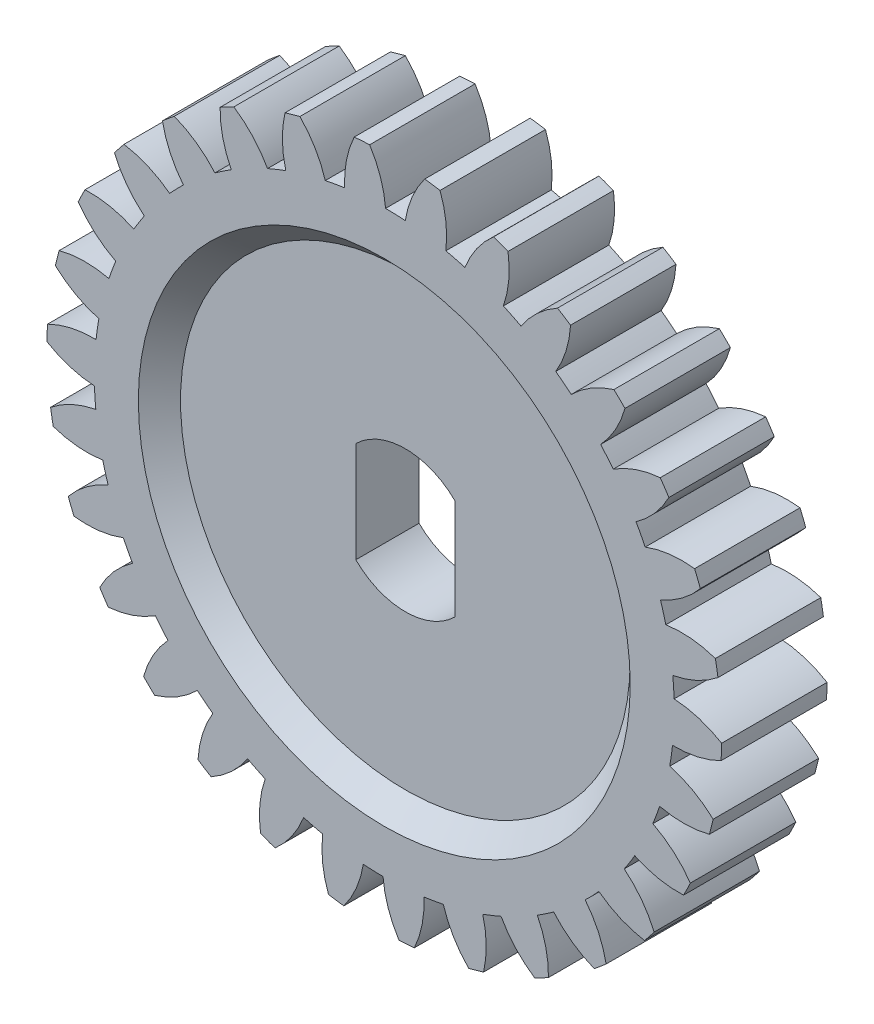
ISO-10303-21;
HEADER;
FILE_DESCRIPTION(('STEP AP214'),'2;1');
FILE_NAME('part.step','',(''),(''),'','','');
FILE_SCHEMA(('AUTOMOTIVE_DESIGN { 1 0 10303 214 1 1 1 1 }'));
ENDSEC;
DATA;
#1=APPLICATION_CONTEXT('core data for automotive mechanical design processes');
#2=APPLICATION_PROTOCOL_DEFINITION('international standard','automotive_design',2000,#1);
#3=PRODUCT_CONTEXT('',#1,'mechanical');
#4=PRODUCT('Part','Part','',(#3));
#5=PRODUCT_RELATED_PRODUCT_CATEGORY('part','',(#4));
#6=PRODUCT_DEFINITION_FORMATION('','',#4);
#7=PRODUCT_DEFINITION_CONTEXT('part definition',#1,'design');
#8=PRODUCT_DEFINITION('design','',#6,#7);
#9=PRODUCT_DEFINITION_SHAPE('','',#8);
#10=(LENGTH_UNIT() NAMED_UNIT(*) SI_UNIT(.MILLI.,.METRE.));
#11=(NAMED_UNIT(*) PLANE_ANGLE_UNIT() SI_UNIT($,.RADIAN.));
#12=(NAMED_UNIT(*) SI_UNIT($,.STERADIAN.) SOLID_ANGLE_UNIT());
#13=UNCERTAINTY_MEASURE_WITH_UNIT(LENGTH_MEASURE(1.E-05),#10,'distance_accuracy_value','');
#14=(GEOMETRIC_REPRESENTATION_CONTEXT(3) GLOBAL_UNCERTAINTY_ASSIGNED_CONTEXT((#13)) GLOBAL_UNIT_ASSIGNED_CONTEXT((#10,
#11,#12)) REPRESENTATION_CONTEXT('',''));
#15=CARTESIAN_POINT('',(0.,0.,0.));
#16=DIRECTION('',(0.,0.,1.));
#17=DIRECTION('',(1.,0.,0.));
#18=AXIS2_PLACEMENT_3D('',#15,#16,#17);
#19=CARTESIAN_POINT('',(0.,0.,-8.));
#20=DIRECTION('',(0.,0.,1.));
#21=DIRECTION('',(1.,0.,0.));
#22=AXIS2_PLACEMENT_3D('',#19,#20,#21);
#23=CYLINDRICAL_SURFACE('',#22,3.35);
#24=CARTESIAN_POINT('',(0.,0.,1.));
#25=DIRECTION('',(0.,0.,-1.));
#26=DIRECTION('',(-1.,0.,0.));
#27=AXIS2_PLACEMENT_3D('',#24,#25,#26);
#28=CIRCLE('',#27,3.35);
#29=CARTESIAN_POINT('',(2.35,2.38746727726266,1.));
#30=VERTEX_POINT('',#29);
#31=CARTESIAN_POINT('',(-2.35,2.38746727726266,0.999999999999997));
#32=VERTEX_POINT('',#31);
#33=EDGE_CURVE('E48',#30,#32,#28,.F.);
#34=ORIENTED_EDGE('',*,*,#33,.F.);
#35=DIRECTION('',(0.,0.,1.));
#36=VECTOR('',#35,1.);
#37=CARTESIAN_POINT('',(2.35,2.38746727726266,-8.));
#38=LINE('',#37,#36);
#39=CARTESIAN_POINT('',(2.35,2.38746727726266,4.));
#40=VERTEX_POINT('',#39);
#41=EDGE_CURVE('E811',#30,#40,#38,.T.);
#42=ORIENTED_EDGE('',*,*,#41,.T.);
#43=CARTESIAN_POINT('',(0.,0.,4.));
#44=DIRECTION('',(0.,0.,1.));
#45=DIRECTION('',(1.,0.,0.));
#46=AXIS2_PLACEMENT_3D('',#43,#44,#45);
#47=CIRCLE('',#46,3.35);
#48=CARTESIAN_POINT('',(-2.35,2.38746727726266,4.));
#49=VERTEX_POINT('',#48);
#50=EDGE_CURVE('E813',#49,#40,#47,.F.);
#51=ORIENTED_EDGE('',*,*,#50,.F.);
#52=DIRECTION('',(0.,0.,1.));
#53=VECTOR('',#52,1.);
#54=CARTESIAN_POINT('',(-2.35,2.38746727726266,-8.));
#55=LINE('',#54,#53);
#56=EDGE_CURVE('E809',#32,#49,#55,.T.);
#57=ORIENTED_EDGE('',*,*,#56,.F.);
#58=EDGE_LOOP('',(#34,#42,#51,#57));
#59=FACE_BOUND('',#58,.T.);
#60=ADVANCED_FACE('F33',(#59),#23,.F.);
#61=CARTESIAN_POINT('',(2.35,2.38746727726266,-8.));
#62=DIRECTION('',(1.,0.,0.));
#63=DIRECTION('',(0.,1.,0.));
#64=AXIS2_PLACEMENT_3D('',#61,#62,#63);
#65=PLANE('',#64);
#66=DIRECTION('',(0.,1.,0.));
#67=VECTOR('',#66,1.);
#68=CARTESIAN_POINT('',(2.35,2.38746727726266,1.));
#69=LINE('',#68,#67);
#70=CARTESIAN_POINT('',(2.35,-2.38746727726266,1.));
#71=VERTEX_POINT('',#70);
#72=EDGE_CURVE('E802',#71,#30,#69,.T.);
#73=ORIENTED_EDGE('',*,*,#72,.F.);
#74=DIRECTION('',(0.,0.,1.));
#75=VECTOR('',#74,1.);
#76=CARTESIAN_POINT('',(2.35,-2.38746727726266,-8.));
#77=LINE('',#76,#75);
#78=CARTESIAN_POINT('',(2.35,-2.38746727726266,4.));
#79=VERTEX_POINT('',#78);
#80=EDGE_CURVE('E801',#71,#79,#77,.T.);
#81=ORIENTED_EDGE('',*,*,#80,.T.);
#82=DIRECTION('',(0.,-1.,0.));
#83=VECTOR('',#82,1.);
#84=CARTESIAN_POINT('',(2.35,2.38746727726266,4.));
#85=LINE('',#84,#83);
#86=EDGE_CURVE('E1654',#40,#79,#85,.T.);
#87=ORIENTED_EDGE('',*,*,#86,.F.);
#88=ORIENTED_EDGE('',*,*,#41,.F.);
#89=EDGE_LOOP('',(#73,#81,#87,#88));
#90=FACE_BOUND('',#89,.T.);
#91=ADVANCED_FACE('F1668',(#90),#65,.F.);
#92=CARTESIAN_POINT('',(0.,0.,-8.));
#93=DIRECTION('',(0.,0.,1.));
#94=DIRECTION('',(1.,0.,0.));
#95=AXIS2_PLACEMENT_3D('',#92,#93,#94);
#96=CYLINDRICAL_SURFACE('',#95,3.35);
#97=CARTESIAN_POINT('',(0.,0.,1.));
#98=DIRECTION('',(0.,0.,-1.));
#99=DIRECTION('',(-1.,0.,0.));
#100=AXIS2_PLACEMENT_3D('',#97,#98,#99);
#101=CIRCLE('',#100,3.35);
#102=CARTESIAN_POINT('',(-2.35,-2.38746727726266,1.));
#103=VERTEX_POINT('',#102);
#104=EDGE_CURVE('E794',#103,#71,#101,.F.);
#105=ORIENTED_EDGE('',*,*,#104,.F.);
#106=DIRECTION('',(0.,0.,1.));
#107=VECTOR('',#106,1.);
#108=CARTESIAN_POINT('',(-2.35,-2.38746727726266,-8.));
#109=LINE('',#108,#107);
#110=CARTESIAN_POINT('',(-2.35,-2.38746727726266,4.));
#111=VERTEX_POINT('',#110);
#112=EDGE_CURVE('E56',#103,#111,#109,.T.);
#113=ORIENTED_EDGE('',*,*,#112,.T.);
#114=CARTESIAN_POINT('',(0.,0.,4.));
#115=DIRECTION('',(0.,0.,1.));
#116=DIRECTION('',(1.,0.,0.));
#117=AXIS2_PLACEMENT_3D('',#114,#115,#116);
#118=CIRCLE('',#117,3.35);
#119=EDGE_CURVE('E1652',#79,#111,#118,.F.);
#120=ORIENTED_EDGE('',*,*,#119,.F.);
#121=ORIENTED_EDGE('',*,*,#80,.F.);
#122=EDGE_LOOP('',(#105,#113,#120,#121));
#123=FACE_BOUND('',#122,.T.);
#124=ADVANCED_FACE('F800',(#123),#96,.F.);
#125=CARTESIAN_POINT('',(-2.35,2.38746727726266,-8.));
#126=DIRECTION('',(-1.,0.,0.));
#127=DIRECTION('',(0.,-1.,0.));
#128=AXIS2_PLACEMENT_3D('',#125,#126,#127);
#129=PLANE('',#128);
#130=DIRECTION('',(0.,-1.,0.));
#131=VECTOR('',#130,1.);
#132=CARTESIAN_POINT('',(-2.35,2.38746727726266,1.));
#133=LINE('',#132,#131);
#134=EDGE_CURVE('E41',#32,#103,#133,.T.);
#135=ORIENTED_EDGE('',*,*,#134,.F.);
#136=ORIENTED_EDGE('',*,*,#56,.T.);
#137=DIRECTION('',(0.,1.,0.));
#138=VECTOR('',#137,1.);
#139=CARTESIAN_POINT('',(-2.35,2.38746727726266,4.));
#140=LINE('',#139,#138);
#141=EDGE_CURVE('E808',#111,#49,#140,.T.);
#142=ORIENTED_EDGE('',*,*,#141,.F.);
#143=ORIENTED_EDGE('',*,*,#112,.F.);
#144=EDGE_LOOP('',(#135,#136,#142,#143));
#145=FACE_BOUND('',#144,.T.);
#146=ADVANCED_FACE('F806',(#145),#129,.F.);
#147=CARTESIAN_POINT('',(0.,0.,5.));
#148=DIRECTION('',(0.,0.,-1.));
#149=DIRECTION('',(-1.,0.,0.));
#150=AXIS2_PLACEMENT_3D('',#147,#148,#149);
#151=CYLINDRICAL_SURFACE('',#150,13.75);
#152=CARTESIAN_POINT('',(0.,0.,5.));
#153=DIRECTION('',(0.,0.,1.));
#154=DIRECTION('',(1.,0.,0.));
#155=AXIS2_PLACEMENT_3D('',#152,#153,#154);
#156=CIRCLE('',#155,13.75);
#157=CARTESIAN_POINT('',(13.53504836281,-2.42176915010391,5.));
#158=VERTEX_POINT('',#157);
#159=CARTESIAN_POINT('',(13.6681867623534,-1.49772181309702,5.));
#160=VERTEX_POINT('',#159);
#161=EDGE_CURVE('E1633',#158,#160,#156,.T.);
#162=ORIENTED_EDGE('',*,*,#161,.F.);
#163=DIRECTION('',(0.,0.,1.));
#164=VECTOR('',#163,1.);
#165=CARTESIAN_POINT('',(13.53504836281,-2.42176915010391,0.));
#166=LINE('',#165,#164);
#167=CARTESIAN_POINT('',(13.53504836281,-2.42176915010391,0.));
#168=VERTEX_POINT('',#167);
#169=EDGE_CURVE('E827',#168,#158,#166,.T.);
#170=ORIENTED_EDGE('',*,*,#169,.F.);
#171=CARTESIAN_POINT('',(0.,0.,0.));
#172=DIRECTION('',(0.,0.,1.));
#173=DIRECTION('',(1.,0.,0.));
#174=AXIS2_PLACEMENT_3D('',#171,#172,#173);
#175=CIRCLE('',#174,13.75);
#176=CARTESIAN_POINT('',(13.6681867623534,-1.49772181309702,0.));
#177=VERTEX_POINT('',#176);
#178=EDGE_CURVE('E1621',#168,#177,#175,.T.);
#179=ORIENTED_EDGE('',*,*,#178,.T.);
#180=DIRECTION('',(0.,0.,1.));
#181=VECTOR('',#180,1.);
#182=CARTESIAN_POINT('',(13.6681867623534,-1.49772181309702,0.));
#183=LINE('',#182,#181);
#184=EDGE_CURVE('E1624',#177,#160,#183,.T.);
#185=ORIENTED_EDGE('',*,*,#184,.T.);
#186=EDGE_LOOP('',(#162,#170,#179,#185));
#187=FACE_BOUND('',#186,.T.);
#188=ADVANCED_FACE('F2060',(#187),#151,.T.);
#189=CARTESIAN_POINT('',(12.7357609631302,-5.18294247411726,0.));
#190=VERTEX_POINT('',#189);
#191=CARTESIAN_POINT('',(13.058110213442,-4.30676881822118,0.));
#192=VERTEX_POINT('',#191);
#193=EDGE_CURVE('E2089',#190,#192,#175,.T.);
#194=ORIENTED_EDGE('',*,*,#193,.T.);
#195=DIRECTION('',(0.,0.,1.));
#196=VECTOR('',#195,1.);
#197=CARTESIAN_POINT('',(13.058110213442,-4.30676881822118,0.));
#198=LINE('',#197,#196);
#199=CARTESIAN_POINT('',(13.058110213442,-4.30676881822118,5.));
#200=VERTEX_POINT('',#199);
#201=EDGE_CURVE('E841',#192,#200,#198,.T.);
#202=ORIENTED_EDGE('',*,*,#201,.T.);
#203=CARTESIAN_POINT('',(12.7357609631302,-5.18294247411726,5.));
#204=VERTEX_POINT('',#203);
#205=EDGE_CURVE('E2078',#204,#200,#156,.T.);
#206=ORIENTED_EDGE('',*,*,#205,.F.);
#207=DIRECTION('',(0.,0.,1.));
#208=VECTOR('',#207,1.);
#209=CARTESIAN_POINT('',(12.7357609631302,-5.18294247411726,0.));
#210=LINE('',#209,#208);
#211=EDGE_CURVE('E855',#190,#204,#210,.T.);
#212=ORIENTED_EDGE('',*,*,#211,.F.);
#213=EDGE_LOOP('',(#194,#202,#206,#212));
#214=FACE_BOUND('',#213,.T.);
#215=ADVANCED_FACE('F2067',(#214),#151,.T.);
#216=CARTESIAN_POINT('',(11.3798596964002,-7.71759634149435,0.));
#217=VERTEX_POINT('',#216);
#218=CARTESIAN_POINT('',(11.8773315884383,-6.92758935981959,0.));
#219=VERTEX_POINT('',#218);
#220=EDGE_CURVE('E2090',#217,#219,#175,.T.);
#221=ORIENTED_EDGE('',*,*,#220,.T.);
#222=DIRECTION('',(0.,0.,1.));
#223=VECTOR('',#222,1.);
#224=CARTESIAN_POINT('',(11.8773315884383,-6.9275893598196,0.));
#225=LINE('',#224,#223);
#226=CARTESIAN_POINT('',(11.8773315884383,-6.92758935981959,5.));
#227=VERTEX_POINT('',#226);
#228=EDGE_CURVE('E868',#219,#227,#225,.T.);
#229=ORIENTED_EDGE('',*,*,#228,.T.);
#230=CARTESIAN_POINT('',(11.3798596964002,-7.71759634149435,5.));
#231=VERTEX_POINT('',#230);
#232=EDGE_CURVE('E2281',#231,#227,#156,.T.);
#233=ORIENTED_EDGE('',*,*,#232,.F.);
#234=DIRECTION('',(0.,0.,1.));
#235=VECTOR('',#234,1.);
#236=CARTESIAN_POINT('',(11.3798596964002,-7.71759634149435,0.));
#237=LINE('',#236,#235);
#238=EDGE_CURVE('E882',#217,#231,#237,.T.);
#239=ORIENTED_EDGE('',*,*,#238,.F.);
#240=EDGE_LOOP('',(#221,#229,#233,#239));
#241=FACE_BOUND('',#240,.T.);
#242=ADVANCED_FACE('F2073',(#241),#151,.T.);
#243=CARTESIAN_POINT('',(9.52660395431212,-9.91495421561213,0.));
#244=VERTEX_POINT('',#243);
#245=CARTESIAN_POINT('',(10.1774565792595,-9.24564100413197,0.));
#246=VERTEX_POINT('',#245);
#247=EDGE_CURVE('E2093',#244,#246,#175,.T.);
#248=ORIENTED_EDGE('',*,*,#247,.T.);
#249=DIRECTION('',(0.,0.,1.));
#250=VECTOR('',#249,1.);
#251=CARTESIAN_POINT('',(10.1774565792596,-9.24564100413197,0.));
#252=LINE('',#251,#250);
#253=CARTESIAN_POINT('',(10.1774565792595,-9.24564100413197,5.));
#254=VERTEX_POINT('',#253);
#255=EDGE_CURVE('E895',#246,#254,#252,.T.);
#256=ORIENTED_EDGE('',*,*,#255,.T.);
#257=CARTESIAN_POINT('',(9.52660395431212,-9.91495421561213,5.));
#258=VERTEX_POINT('',#257);
#259=EDGE_CURVE('E2278',#258,#254,#156,.T.);
#260=ORIENTED_EDGE('',*,*,#259,.F.);
#261=DIRECTION('',(0.,0.,1.));
#262=VECTOR('',#261,1.);
#263=CARTESIAN_POINT('',(9.52660395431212,-9.91495421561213,0.));
#264=LINE('',#263,#262);
#265=EDGE_CURVE('E909',#244,#258,#264,.T.);
#266=ORIENTED_EDGE('',*,*,#265,.F.);
#267=EDGE_LOOP('',(#248,#256,#260,#266));
#268=FACE_BOUND('',#267,.T.);
#269=ADVANCED_FACE('F2296',(#268),#151,.T.);
#270=CARTESIAN_POINT('',(7.25698990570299,-11.6789810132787,0.));
#271=VERTEX_POINT('',#270);
#272=CARTESIAN_POINT('',(8.03277788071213,-11.159613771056,0.));
#273=VERTEX_POINT('',#272);
#274=EDGE_CURVE('E2097',#271,#273,#175,.T.);
#275=ORIENTED_EDGE('',*,*,#274,.T.);
#276=DIRECTION('',(0.,0.,1.));
#277=VECTOR('',#276,1.);
#278=CARTESIAN_POINT('',(8.03277788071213,-11.159613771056,0.));
#279=LINE('',#278,#277);
#280=CARTESIAN_POINT('',(8.03277788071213,-11.159613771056,5.));
#281=VERTEX_POINT('',#280);
#282=EDGE_CURVE('E922',#273,#281,#279,.T.);
#283=ORIENTED_EDGE('',*,*,#282,.T.);
#284=CARTESIAN_POINT('',(7.25698990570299,-11.6789810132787,5.));
#285=VERTEX_POINT('',#284);
#286=EDGE_CURVE('E2275',#285,#281,#156,.T.);
#287=ORIENTED_EDGE('',*,*,#286,.F.);
#288=DIRECTION('',(0.,0.,1.));
#289=VECTOR('',#288,1.);
#290=CARTESIAN_POINT('',(7.25698990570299,-11.6789810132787,0.));
#291=LINE('',#290,#289);
#292=EDGE_CURVE('E936',#271,#285,#291,.T.);
#293=ORIENTED_EDGE('',*,*,#292,.F.);
#294=EDGE_LOOP('',(#275,#283,#287,#293));
#295=FACE_BOUND('',#294,.T.);
#296=ADVANCED_FACE('F2302',(#295),#151,.T.);
#297=CARTESIAN_POINT('',(4.67021057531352,-12.9325802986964,0.));
#298=VERTEX_POINT('',#297);
#299=CARTESIAN_POINT('',(5.53702824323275,-12.5858578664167,0.));
#300=VERTEX_POINT('',#299);
#301=EDGE_CURVE('E2101',#298,#300,#175,.T.);
#302=ORIENTED_EDGE('',*,*,#301,.T.);
#303=DIRECTION('',(0.,0.,1.));
#304=VECTOR('',#303,1.);
#305=CARTESIAN_POINT('',(5.53702824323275,-12.5858578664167,0.));
#306=LINE('',#305,#304);
#307=CARTESIAN_POINT('',(5.53702824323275,-12.5858578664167,5.));
#308=VERTEX_POINT('',#307);
#309=EDGE_CURVE('E949',#300,#308,#306,.T.);
#310=ORIENTED_EDGE('',*,*,#309,.T.);
#311=CARTESIAN_POINT('',(4.67021057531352,-12.9325802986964,5.));
#312=VERTEX_POINT('',#311);
#313=EDGE_CURVE('E2272',#312,#308,#156,.T.);
#314=ORIENTED_EDGE('',*,*,#313,.F.);
#315=DIRECTION('',(0.,0.,1.));
#316=VECTOR('',#315,1.);
#317=CARTESIAN_POINT('',(4.67021057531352,-12.9325802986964,0.));
#318=LINE('',#317,#316);
#319=EDGE_CURVE('E963',#298,#312,#318,.T.);
#320=ORIENTED_EDGE('',*,*,#319,.F.);
#321=EDGE_LOOP('',(#302,#310,#314,#320));
#322=FACE_BOUND('',#321,.T.);
#323=ADVANCED_FACE('F2308',(#322),#151,.T.);
#324=CARTESIAN_POINT('',(1.87932063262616,-13.6209637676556,0.));
#325=VERTEX_POINT('',#324);
#326=CARTESIAN_POINT('',(2.79928390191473,-13.4620395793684,0.));
#327=VERTEX_POINT('',#326);
#328=EDGE_CURVE('E2105',#325,#327,#175,.T.);
#329=ORIENTED_EDGE('',*,*,#328,.T.);
#330=DIRECTION('',(0.,0.,1.));
#331=VECTOR('',#330,1.);
#332=CARTESIAN_POINT('',(2.79928390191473,-13.4620395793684,0.));
#333=LINE('',#332,#331);
#334=CARTESIAN_POINT('',(2.79928390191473,-13.4620395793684,5.));
#335=VERTEX_POINT('',#334);
#336=EDGE_CURVE('E976',#327,#335,#333,.T.);
#337=ORIENTED_EDGE('',*,*,#336,.T.);
#338=CARTESIAN_POINT('',(1.87932063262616,-13.6209637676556,5.));
#339=VERTEX_POINT('',#338);
#340=EDGE_CURVE('E2269',#339,#335,#156,.T.);
#341=ORIENTED_EDGE('',*,*,#340,.F.);
#342=DIRECTION('',(0.,0.,1.));
#343=VECTOR('',#342,1.);
#344=CARTESIAN_POINT('',(1.87932063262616,-13.6209637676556,0.));
#345=LINE('',#344,#343);
#346=EDGE_CURVE('E990',#325,#339,#345,.T.);
#347=ORIENTED_EDGE('',*,*,#346,.F.);
#348=EDGE_LOOP('',(#329,#337,#341,#347));
#349=FACE_BOUND('',#348,.T.);
#350=ADVANCED_FACE('F2314',(#349),#151,.T.);
#351=CARTESIAN_POINT('',(-0.993704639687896,-13.7140457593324,0.));
#352=VERTEX_POINT('',#351);
#353=CARTESIAN_POINT('',(-0.0608025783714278,-13.7498655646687,0.));
#354=VERTEX_POINT('',#353);
#355=EDGE_CURVE('E2109',#352,#354,#175,.T.);
#356=ORIENTED_EDGE('',*,*,#355,.T.);
#357=DIRECTION('',(0.,0.,1.));
#358=VECTOR('',#357,1.);
#359=CARTESIAN_POINT('',(-0.0608025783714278,-13.7498655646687,0.));
#360=LINE('',#359,#358);
#361=CARTESIAN_POINT('',(-0.0608025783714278,-13.7498655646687,5.));
#362=VERTEX_POINT('',#361);
#363=EDGE_CURVE('E1003',#354,#362,#360,.T.);
#364=ORIENTED_EDGE('',*,*,#363,.T.);
#365=CARTESIAN_POINT('',(-0.993704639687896,-13.7140457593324,5.));
#366=VERTEX_POINT('',#365);
#367=EDGE_CURVE('E2266',#366,#362,#156,.T.);
#368=ORIENTED_EDGE('',*,*,#367,.F.);
#369=DIRECTION('',(0.,0.,1.));
#370=VECTOR('',#369,1.);
#371=CARTESIAN_POINT('',(-0.993704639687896,-13.7140457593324,0.));
#372=LINE('',#371,#370);
#373=EDGE_CURVE('E1017',#352,#366,#372,.T.);
#374=ORIENTED_EDGE('',*,*,#373,.F.);
#375=EDGE_LOOP('',(#356,#364,#368,#374));
#376=FACE_BOUND('',#375,.T.);
#377=ADVANCED_FACE('F2320',(#376),#151,.T.);
#378=CARTESIAN_POINT('',(-3.82330025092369,-13.2077581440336,0.));
#379=VERTEX_POINT('',#378);
#380=CARTESIAN_POINT('',(-2.91823169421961,-13.4367564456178,0.));
#381=VERTEX_POINT('',#380);
#382=EDGE_CURVE('E2113',#379,#381,#175,.T.);
#383=ORIENTED_EDGE('',*,*,#382,.T.);
#384=DIRECTION('',(0.,0.,1.));
#385=VECTOR('',#384,1.);
#386=CARTESIAN_POINT('',(-2.91823169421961,-13.4367564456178,0.));
#387=LINE('',#386,#385);
#388=CARTESIAN_POINT('',(-2.91823169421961,-13.4367564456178,5.));
#389=VERTEX_POINT('',#388);
#390=EDGE_CURVE('E1030',#381,#389,#387,.T.);
#391=ORIENTED_EDGE('',*,*,#390,.T.);
#392=CARTESIAN_POINT('',(-3.82330025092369,-13.2077581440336,5.));
#393=VERTEX_POINT('',#392);
#394=EDGE_CURVE('E2263',#393,#389,#156,.T.);
#395=ORIENTED_EDGE('',*,*,#394,.F.);
#396=DIRECTION('',(0.,0.,1.));
#397=VECTOR('',#396,1.);
#398=CARTESIAN_POINT('',(-3.82330025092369,-13.2077581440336,0.));
#399=LINE('',#398,#397);
#400=EDGE_CURVE('E1044',#379,#393,#399,.T.);
#401=ORIENTED_EDGE('',*,*,#400,.F.);
#402=EDGE_LOOP('',(#383,#391,#395,#401));
#403=FACE_BOUND('',#402,.T.);
#404=ADVANCED_FACE('F2326',(#403),#151,.T.);
#405=CARTESIAN_POINT('',(-6.48579929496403,-12.1242281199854,0.));
#406=VERTEX_POINT('',#405);
#407=CARTESIAN_POINT('',(-5.64812008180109,-12.5363965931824,0.));
#408=VERTEX_POINT('',#407);
#409=EDGE_CURVE('E2117',#406,#408,#175,.T.);
#410=ORIENTED_EDGE('',*,*,#409,.T.);
#411=DIRECTION('',(0.,0.,1.));
#412=VECTOR('',#411,1.);
#413=CARTESIAN_POINT('',(-5.64812008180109,-12.5363965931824,0.));
#414=LINE('',#413,#412);
#415=CARTESIAN_POINT('',(-5.64812008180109,-12.5363965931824,5.));
#416=VERTEX_POINT('',#415);
#417=EDGE_CURVE('E1057',#408,#416,#414,.T.);
#418=ORIENTED_EDGE('',*,*,#417,.T.);
#419=CARTESIAN_POINT('',(-6.48579929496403,-12.1242281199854,5.));
#420=VERTEX_POINT('',#419);
#421=EDGE_CURVE('E2260',#420,#416,#156,.T.);
#422=ORIENTED_EDGE('',*,*,#421,.F.);
#423=DIRECTION('',(0.,0.,1.));
#424=VECTOR('',#423,1.);
#425=CARTESIAN_POINT('',(-6.48579929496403,-12.1242281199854,0.));
#426=LINE('',#425,#424);
#427=EDGE_CURVE('E1071',#406,#420,#426,.T.);
#428=ORIENTED_EDGE('',*,*,#427,.F.);
#429=EDGE_LOOP('',(#410,#418,#422,#428));
#430=FACE_BOUND('',#429,.T.);
#431=ADVANCED_FACE('F2332',(#430),#151,.T.);
#432=CARTESIAN_POINT('',(-8.86483778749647,-10.5108111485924,0.));
#433=VERTEX_POINT('',#432);
#434=CARTESIAN_POINT('',(-8.13115851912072,-11.0881360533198,0.));
#435=VERTEX_POINT('',#434);
#436=EDGE_CURVE('E2121',#433,#435,#175,.T.);
#437=ORIENTED_EDGE('',*,*,#436,.T.);
#438=DIRECTION('',(0.,0.,1.));
#439=VECTOR('',#438,1.);
#440=CARTESIAN_POINT('',(-8.13115851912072,-11.0881360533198,0.));
#441=LINE('',#440,#439);
#442=CARTESIAN_POINT('',(-8.13115851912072,-11.0881360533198,5.));
#443=VERTEX_POINT('',#442);
#444=EDGE_CURVE('E1084',#435,#443,#441,.T.);
#445=ORIENTED_EDGE('',*,*,#444,.T.);
#446=CARTESIAN_POINT('',(-8.86483778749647,-10.5108111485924,5.));
#447=VERTEX_POINT('',#446);
#448=EDGE_CURVE('E2257',#447,#443,#156,.T.);
#449=ORIENTED_EDGE('',*,*,#448,.F.);
#450=DIRECTION('',(0.,0.,1.));
#451=VECTOR('',#450,1.);
#452=CARTESIAN_POINT('',(-8.86483778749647,-10.5108111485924,0.));
#453=LINE('',#452,#451);
#454=EDGE_CURVE('E1098',#433,#447,#453,.T.);
#455=ORIENTED_EDGE('',*,*,#454,.F.);
#456=EDGE_LOOP('',(#437,#445,#449,#455));
#457=FACE_BOUND('',#456,.T.);
#458=ADVANCED_FACE('F2338',(#457),#151,.T.);
#459=CARTESIAN_POINT('',(-10.8564403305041,-8.43802129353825,0.));
#460=VERTEX_POINT('',#459);
#461=CARTESIAN_POINT('',(-10.2588263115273,-9.15527076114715,0.));
#462=VERTEX_POINT('',#461);
#463=EDGE_CURVE('E2125',#460,#462,#175,.T.);
#464=ORIENTED_EDGE('',*,*,#463,.T.);
#465=DIRECTION('',(0.,0.,1.));
#466=VECTOR('',#465,1.);
#467=CARTESIAN_POINT('',(-10.2588263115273,-9.15527076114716,0.));
#468=LINE('',#467,#466);
#469=CARTESIAN_POINT('',(-10.2588263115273,-9.15527076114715,5.));
#470=VERTEX_POINT('',#469);
#471=EDGE_CURVE('E1111',#462,#470,#468,.T.);
#472=ORIENTED_EDGE('',*,*,#471,.T.);
#473=CARTESIAN_POINT('',(-10.8564403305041,-8.43802129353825,5.));
#474=VERTEX_POINT('',#473);
#475=EDGE_CURVE('E2254',#474,#470,#156,.T.);
#476=ORIENTED_EDGE('',*,*,#475,.F.);
#477=DIRECTION('',(0.,0.,1.));
#478=VECTOR('',#477,1.);
#479=CARTESIAN_POINT('',(-10.8564403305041,-8.43802129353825,0.));
#480=LINE('',#479,#478);
#481=EDGE_CURVE('E1125',#460,#474,#480,.T.);
#482=ORIENTED_EDGE('',*,*,#481,.F.);
#483=EDGE_LOOP('',(#464,#472,#476,#482));
#484=FACE_BOUND('',#483,.T.);
#485=ADVANCED_FACE('F2344',(#484),#151,.T.);
#486=CARTESIAN_POINT('',(-12.3735643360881,-5.99644941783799,0.));
#487=VERTEX_POINT('',#486);
#488=CARTESIAN_POINT('',(-11.9381341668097,-6.8222762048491,0.));
#489=VERTEX_POINT('',#488);
#490=EDGE_CURVE('E2129',#487,#489,#175,.T.);
#491=ORIENTED_EDGE('',*,*,#490,.T.);
#492=DIRECTION('',(0.,0.,1.));
#493=VECTOR('',#492,1.);
#494=CARTESIAN_POINT('',(-11.9381341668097,-6.8222762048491,0.));
#495=LINE('',#494,#493);
#496=CARTESIAN_POINT('',(-11.9381341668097,-6.8222762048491,5.));
#497=VERTEX_POINT('',#496);
#498=EDGE_CURVE('E1138',#489,#497,#495,.T.);
#499=ORIENTED_EDGE('',*,*,#498,.T.);
#500=CARTESIAN_POINT('',(-12.3735643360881,-5.99644941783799,5.));
#501=VERTEX_POINT('',#500);
#502=EDGE_CURVE('E2251',#501,#497,#156,.T.);
#503=ORIENTED_EDGE('',*,*,#502,.F.);
#504=DIRECTION('',(0.,0.,1.));
#505=VECTOR('',#504,1.);
#506=CARTESIAN_POINT('',(-12.3735643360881,-5.99644941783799,0.));
#507=LINE('',#506,#505);
#508=EDGE_CURVE('E1152',#487,#501,#507,.T.);
#509=ORIENTED_EDGE('',*,*,#508,.F.);
#510=EDGE_LOOP('',(#491,#499,#503,#509));
#511=FACE_BOUND('',#510,.T.);
#512=ADVANCED_FACE('F2350',(#511),#151,.T.);
#513=CARTESIAN_POINT('',(-13.3499042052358,-3.29280392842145,0.));
#514=VERTEX_POINT('',#513);
#515=CARTESIAN_POINT('',(-13.0956882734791,-4.1911154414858,0.));
#516=VERTEX_POINT('',#515);
#517=EDGE_CURVE('E2133',#514,#516,#175,.T.);
#518=ORIENTED_EDGE('',*,*,#517,.T.);
#519=DIRECTION('',(0.,0.,1.));
#520=VECTOR('',#519,1.);
#521=CARTESIAN_POINT('',(-13.0956882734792,-4.1911154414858,0.));
#522=LINE('',#521,#520);
#523=CARTESIAN_POINT('',(-13.0956882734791,-4.1911154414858,5.));
#524=VERTEX_POINT('',#523);
#525=EDGE_CURVE('E1165',#516,#524,#522,.T.);
#526=ORIENTED_EDGE('',*,*,#525,.T.);
#527=CARTESIAN_POINT('',(-13.3499042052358,-3.29280392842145,5.));
#528=VERTEX_POINT('',#527);
#529=EDGE_CURVE('E2248',#528,#524,#156,.T.);
#530=ORIENTED_EDGE('',*,*,#529,.F.);
#531=DIRECTION('',(0.,0.,1.));
#532=VECTOR('',#531,1.);
#533=CARTESIAN_POINT('',(-13.3499042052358,-3.29280392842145,0.));
#534=LINE('',#533,#532);
#535=EDGE_CURVE('E1179',#514,#528,#534,.T.);
#536=ORIENTED_EDGE('',*,*,#535,.F.);
#537=EDGE_LOOP('',(#518,#526,#530,#536));
#538=FACE_BOUND('',#537,.T.);
#539=ADVANCED_FACE('F2356',(#538),#151,.T.);
#540=CARTESIAN_POINT('',(-13.742789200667,-0.445247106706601,0.));
#541=VERTEX_POINT('',#540);
#542=CARTESIAN_POINT('',(-13.6808979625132,-1.37678282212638,0.));
#543=VERTEX_POINT('',#542);
#544=EDGE_CURVE('E2137',#541,#543,#175,.T.);
#545=ORIENTED_EDGE('',*,*,#544,.T.);
#546=DIRECTION('',(0.,0.,1.));
#547=VECTOR('',#546,1.);
#548=CARTESIAN_POINT('',(-13.6808979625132,-1.37678282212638,0.));
#549=LINE('',#548,#547);
#550=CARTESIAN_POINT('',(-13.6808979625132,-1.37678282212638,5.));
#551=VERTEX_POINT('',#550);
#552=EDGE_CURVE('E1192',#543,#551,#549,.T.);
#553=ORIENTED_EDGE('',*,*,#552,.T.);
#554=CARTESIAN_POINT('',(-13.742789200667,-0.445247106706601,5.));
#555=VERTEX_POINT('',#554);
#556=EDGE_CURVE('E2245',#555,#551,#156,.T.);
#557=ORIENTED_EDGE('',*,*,#556,.F.);
#558=DIRECTION('',(0.,0.,1.));
#559=VECTOR('',#558,1.);
#560=CARTESIAN_POINT('',(-13.742789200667,-0.445247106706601,0.));
#561=LINE('',#560,#559);
#562=EDGE_CURVE('E1206',#541,#555,#561,.T.);
#563=ORIENTED_EDGE('',*,*,#562,.F.);
#564=EDGE_LOOP('',(#545,#553,#557,#563));
#565=FACE_BOUND('',#564,.T.);
#566=ADVANCED_FACE('F2362',(#565),#151,.T.);
#567=CARTESIAN_POINT('',(-13.53504836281,2.421769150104,0.));
#568=VERTEX_POINT('',#567);
#569=CARTESIAN_POINT('',(-13.6681867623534,1.49772181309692,0.));
#570=VERTEX_POINT('',#569);
#571=EDGE_CURVE('E2141',#568,#570,#175,.T.);
#572=ORIENTED_EDGE('',*,*,#571,.T.);
#573=DIRECTION('',(0.,0.,1.));
#574=VECTOR('',#573,1.);
#575=CARTESIAN_POINT('',(-13.6681867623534,1.49772181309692,0.));
#576=LINE('',#575,#574);
#577=CARTESIAN_POINT('',(-13.6681867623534,1.49772181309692,5.));
#578=VERTEX_POINT('',#577);
#579=EDGE_CURVE('E1219',#570,#578,#576,.T.);
#580=ORIENTED_EDGE('',*,*,#579,.T.);
#581=CARTESIAN_POINT('',(-13.53504836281,2.421769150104,5.));
#582=VERTEX_POINT('',#581);
#583=EDGE_CURVE('E2242',#582,#578,#156,.T.);
#584=ORIENTED_EDGE('',*,*,#583,.F.);
#585=DIRECTION('',(0.,0.,1.));
#586=VECTOR('',#585,1.);
#587=CARTESIAN_POINT('',(-13.53504836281,2.421769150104,0.));
#588=LINE('',#587,#586);
#589=EDGE_CURVE('E1233',#568,#582,#588,.T.);
#590=ORIENTED_EDGE('',*,*,#589,.F.);
#591=EDGE_LOOP('',(#572,#580,#584,#590));
#592=FACE_BOUND('',#591,.T.);
#593=ADVANCED_FACE('F2368',(#592),#151,.T.);
#594=CARTESIAN_POINT('',(-12.7357609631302,5.18294247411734,0.));
#595=VERTEX_POINT('',#594);
#596=CARTESIAN_POINT('',(-13.0581102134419,4.30676881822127,0.));
#597=VERTEX_POINT('',#596);
#598=EDGE_CURVE('E2145',#595,#597,#175,.T.);
#599=ORIENTED_EDGE('',*,*,#598,.T.);
#600=DIRECTION('',(0.,0.,1.));
#601=VECTOR('',#600,1.);
#602=CARTESIAN_POINT('',(-13.058110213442,4.30676881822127,0.));
#603=LINE('',#602,#601);
#604=CARTESIAN_POINT('',(-13.0581102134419,4.30676881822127,5.));
#605=VERTEX_POINT('',#604);
#606=EDGE_CURVE('E1246',#597,#605,#603,.T.);
#607=ORIENTED_EDGE('',*,*,#606,.T.);
#608=CARTESIAN_POINT('',(-12.7357609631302,5.18294247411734,5.));
#609=VERTEX_POINT('',#608);
#610=EDGE_CURVE('E2239',#609,#605,#156,.T.);
#611=ORIENTED_EDGE('',*,*,#610,.F.);
#612=DIRECTION('',(0.,0.,1.));
#613=VECTOR('',#612,1.);
#614=CARTESIAN_POINT('',(-12.7357609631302,5.18294247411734,0.));
#615=LINE('',#614,#613);
#616=EDGE_CURVE('E1260',#595,#609,#615,.T.);
#617=ORIENTED_EDGE('',*,*,#616,.F.);
#618=EDGE_LOOP('',(#599,#607,#611,#617));
#619=FACE_BOUND('',#618,.T.);
#620=ADVANCED_FACE('F2374',(#619),#151,.T.);
#621=CARTESIAN_POINT('',(-11.3798596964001,7.71759634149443,0.));
#622=VERTEX_POINT('',#621);
#623=CARTESIAN_POINT('',(-11.8773315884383,6.92758935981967,0.));
#624=VERTEX_POINT('',#623);
#625=EDGE_CURVE('E2149',#622,#624,#175,.T.);
#626=ORIENTED_EDGE('',*,*,#625,.T.);
#627=DIRECTION('',(0.,0.,1.));
#628=VECTOR('',#627,1.);
#629=CARTESIAN_POINT('',(-11.8773315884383,6.92758935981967,0.));
#630=LINE('',#629,#628);
#631=CARTESIAN_POINT('',(-11.8773315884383,6.92758935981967,5.));
#632=VERTEX_POINT('',#631);
#633=EDGE_CURVE('E1273',#624,#632,#630,.T.);
#634=ORIENTED_EDGE('',*,*,#633,.T.);
#635=CARTESIAN_POINT('',(-11.3798596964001,7.71759634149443,5.));
#636=VERTEX_POINT('',#635);
#637=EDGE_CURVE('E2236',#636,#632,#156,.T.);
#638=ORIENTED_EDGE('',*,*,#637,.F.);
#639=DIRECTION('',(0.,0.,1.));
#640=VECTOR('',#639,1.);
#641=CARTESIAN_POINT('',(-11.3798596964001,7.71759634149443,0.));
#642=LINE('',#641,#640);
#643=EDGE_CURVE('E1287',#622,#636,#642,.T.);
#644=ORIENTED_EDGE('',*,*,#643,.F.);
#645=EDGE_LOOP('',(#626,#634,#638,#644));
#646=FACE_BOUND('',#645,.T.);
#647=ADVANCED_FACE('F2380',(#646),#151,.T.);
#648=CARTESIAN_POINT('',(-9.52660395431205,9.9149542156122,0.));
#649=VERTEX_POINT('',#648);
#650=CARTESIAN_POINT('',(-10.1774565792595,9.24564100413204,0.));
#651=VERTEX_POINT('',#650);
#652=EDGE_CURVE('E2153',#649,#651,#175,.T.);
#653=ORIENTED_EDGE('',*,*,#652,.T.);
#654=DIRECTION('',(0.,0.,1.));
#655=VECTOR('',#654,1.);
#656=CARTESIAN_POINT('',(-10.1774565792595,9.24564100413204,0.));
#657=LINE('',#656,#655);
#658=CARTESIAN_POINT('',(-10.1774565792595,9.24564100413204,5.));
#659=VERTEX_POINT('',#658);
#660=EDGE_CURVE('E1300',#651,#659,#657,.T.);
#661=ORIENTED_EDGE('',*,*,#660,.T.);
#662=CARTESIAN_POINT('',(-9.52660395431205,9.9149542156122,5.));
#663=VERTEX_POINT('',#662);
#664=EDGE_CURVE('E2233',#663,#659,#156,.T.);
#665=ORIENTED_EDGE('',*,*,#664,.F.);
#666=DIRECTION('',(0.,0.,1.));
#667=VECTOR('',#666,1.);
#668=CARTESIAN_POINT('',(-9.52660395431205,9.9149542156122,0.));
#669=LINE('',#668,#667);
#670=EDGE_CURVE('E1314',#649,#663,#669,.T.);
#671=ORIENTED_EDGE('',*,*,#670,.F.);
#672=EDGE_LOOP('',(#653,#661,#665,#671));
#673=FACE_BOUND('',#672,.T.);
#674=ADVANCED_FACE('F2386',(#673),#151,.T.);
#675=CARTESIAN_POINT('',(-7.25698990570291,11.6789810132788,0.));
#676=VERTEX_POINT('',#675);
#677=CARTESIAN_POINT('',(-8.03277788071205,11.159613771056,0.));
#678=VERTEX_POINT('',#677);
#679=EDGE_CURVE('E2157',#676,#678,#175,.T.);
#680=ORIENTED_EDGE('',*,*,#679,.T.);
#681=DIRECTION('',(0.,0.,1.));
#682=VECTOR('',#681,1.);
#683=CARTESIAN_POINT('',(-8.03277788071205,11.159613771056,0.));
#684=LINE('',#683,#682);
#685=CARTESIAN_POINT('',(-8.03277788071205,11.159613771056,5.));
#686=VERTEX_POINT('',#685);
#687=EDGE_CURVE('E1327',#678,#686,#684,.T.);
#688=ORIENTED_EDGE('',*,*,#687,.T.);
#689=CARTESIAN_POINT('',(-7.25698990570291,11.6789810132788,5.));
#690=VERTEX_POINT('',#689);
#691=EDGE_CURVE('E2230',#690,#686,#156,.T.);
#692=ORIENTED_EDGE('',*,*,#691,.F.);
#693=DIRECTION('',(0.,0.,1.));
#694=VECTOR('',#693,1.);
#695=CARTESIAN_POINT('',(-7.25698990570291,11.6789810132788,0.));
#696=LINE('',#695,#694);
#697=EDGE_CURVE('E1341',#676,#690,#696,.T.);
#698=ORIENTED_EDGE('',*,*,#697,.F.);
#699=EDGE_LOOP('',(#680,#688,#692,#698));
#700=FACE_BOUND('',#699,.T.);
#701=ADVANCED_FACE('F2392',(#700),#151,.T.);
#702=CARTESIAN_POINT('',(-4.67021057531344,12.9325802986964,0.));
#703=VERTEX_POINT('',#702);
#704=CARTESIAN_POINT('',(-5.53702824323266,12.5858578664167,0.));
#705=VERTEX_POINT('',#704);
#706=EDGE_CURVE('E2161',#703,#705,#175,.T.);
#707=ORIENTED_EDGE('',*,*,#706,.T.);
#708=DIRECTION('',(0.,0.,1.));
#709=VECTOR('',#708,1.);
#710=CARTESIAN_POINT('',(-5.53702824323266,12.5858578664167,0.));
#711=LINE('',#710,#709);
#712=CARTESIAN_POINT('',(-5.53702824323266,12.5858578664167,5.));
#713=VERTEX_POINT('',#712);
#714=EDGE_CURVE('E1354',#705,#713,#711,.T.);
#715=ORIENTED_EDGE('',*,*,#714,.T.);
#716=CARTESIAN_POINT('',(-4.67021057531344,12.9325802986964,5.));
#717=VERTEX_POINT('',#716);
#718=EDGE_CURVE('E2227',#717,#713,#156,.T.);
#719=ORIENTED_EDGE('',*,*,#718,.F.);
#720=DIRECTION('',(0.,0.,1.));
#721=VECTOR('',#720,1.);
#722=CARTESIAN_POINT('',(-4.67021057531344,12.9325802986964,0.));
#723=LINE('',#722,#721);
#724=EDGE_CURVE('E1368',#703,#717,#723,.T.);
#725=ORIENTED_EDGE('',*,*,#724,.F.);
#726=EDGE_LOOP('',(#707,#715,#719,#725));
#727=FACE_BOUND('',#726,.T.);
#728=ADVANCED_FACE('F2398',(#727),#151,.T.);
#729=CARTESIAN_POINT('',(-1.87932063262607,13.6209637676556,0.));
#730=VERTEX_POINT('',#729);
#731=CARTESIAN_POINT('',(-2.79928390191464,13.4620395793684,0.));
#732=VERTEX_POINT('',#731);
#733=EDGE_CURVE('E2165',#730,#732,#175,.T.);
#734=ORIENTED_EDGE('',*,*,#733,.T.);
#735=DIRECTION('',(0.,0.,1.));
#736=VECTOR('',#735,1.);
#737=CARTESIAN_POINT('',(-2.79928390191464,13.4620395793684,0.));
#738=LINE('',#737,#736);
#739=CARTESIAN_POINT('',(-2.79928390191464,13.4620395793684,5.));
#740=VERTEX_POINT('',#739);
#741=EDGE_CURVE('E1381',#732,#740,#738,.T.);
#742=ORIENTED_EDGE('',*,*,#741,.T.);
#743=CARTESIAN_POINT('',(-1.87932063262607,13.6209637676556,5.));
#744=VERTEX_POINT('',#743);
#745=EDGE_CURVE('E2224',#744,#740,#156,.T.);
#746=ORIENTED_EDGE('',*,*,#745,.F.);
#747=DIRECTION('',(0.,0.,1.));
#748=VECTOR('',#747,1.);
#749=CARTESIAN_POINT('',(-1.87932063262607,13.6209637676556,0.));
#750=LINE('',#749,#748);
#751=EDGE_CURVE('E1395',#730,#744,#750,.T.);
#752=ORIENTED_EDGE('',*,*,#751,.F.);
#753=EDGE_LOOP('',(#734,#742,#746,#752));
#754=FACE_BOUND('',#753,.T.);
#755=ADVANCED_FACE('F2404',(#754),#151,.T.);
#756=CARTESIAN_POINT('',(0.993704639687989,13.7140457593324,0.));
#757=VERTEX_POINT('',#756);
#758=CARTESIAN_POINT('',(0.0608025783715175,13.7498655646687,0.));
#759=VERTEX_POINT('',#758);
#760=EDGE_CURVE('E2169',#757,#759,#175,.T.);
#761=ORIENTED_EDGE('',*,*,#760,.T.);
#762=DIRECTION('',(0.,0.,1.));
#763=VECTOR('',#762,1.);
#764=CARTESIAN_POINT('',(0.0608025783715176,13.7498655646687,0.));
#765=LINE('',#764,#763);
#766=CARTESIAN_POINT('',(0.0608025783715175,13.7498655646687,5.));
#767=VERTEX_POINT('',#766);
#768=EDGE_CURVE('E1408',#759,#767,#765,.T.);
#769=ORIENTED_EDGE('',*,*,#768,.T.);
#770=CARTESIAN_POINT('',(0.993704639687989,13.7140457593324,5.));
#771=VERTEX_POINT('',#770);
#772=EDGE_CURVE('E2221',#771,#767,#156,.T.);
#773=ORIENTED_EDGE('',*,*,#772,.F.);
#774=DIRECTION('',(0.,0.,1.));
#775=VECTOR('',#774,1.);
#776=CARTESIAN_POINT('',(0.993704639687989,13.7140457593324,0.));
#777=LINE('',#776,#775);
#778=EDGE_CURVE('E1422',#757,#771,#777,.T.);
#779=ORIENTED_EDGE('',*,*,#778,.F.);
#780=EDGE_LOOP('',(#761,#769,#773,#779));
#781=FACE_BOUND('',#780,.T.);
#782=ADVANCED_FACE('F2410',(#781),#151,.T.);
#783=CARTESIAN_POINT('',(3.82330025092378,13.2077581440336,0.));
#784=VERTEX_POINT('',#783);
#785=CARTESIAN_POINT('',(2.9182316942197,13.4367564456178,0.));
#786=VERTEX_POINT('',#785);
#787=EDGE_CURVE('E2173',#784,#786,#175,.T.);
#788=ORIENTED_EDGE('',*,*,#787,.T.);
#789=DIRECTION('',(0.,0.,1.));
#790=VECTOR('',#789,1.);
#791=CARTESIAN_POINT('',(2.9182316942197,13.4367564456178,0.));
#792=LINE('',#791,#790);
#793=CARTESIAN_POINT('',(2.9182316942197,13.4367564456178,5.));
#794=VERTEX_POINT('',#793);
#795=EDGE_CURVE('E1435',#786,#794,#792,.T.);
#796=ORIENTED_EDGE('',*,*,#795,.T.);
#797=CARTESIAN_POINT('',(3.82330025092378,13.2077581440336,5.));
#798=VERTEX_POINT('',#797);
#799=EDGE_CURVE('E2218',#798,#794,#156,.T.);
#800=ORIENTED_EDGE('',*,*,#799,.F.);
#801=DIRECTION('',(0.,0.,1.));
#802=VECTOR('',#801,1.);
#803=CARTESIAN_POINT('',(3.82330025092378,13.2077581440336,0.));
#804=LINE('',#803,#802);
#805=EDGE_CURVE('E1449',#784,#798,#804,.T.);
#806=ORIENTED_EDGE('',*,*,#805,.F.);
#807=EDGE_LOOP('',(#788,#796,#800,#806));
#808=FACE_BOUND('',#807,.T.);
#809=ADVANCED_FACE('F2416',(#808),#151,.T.);
#810=CARTESIAN_POINT('',(6.48579929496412,12.1242281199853,0.));
#811=VERTEX_POINT('',#810);
#812=CARTESIAN_POINT('',(5.64812008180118,12.5363965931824,0.));
#813=VERTEX_POINT('',#812);
#814=EDGE_CURVE('E2177',#811,#813,#175,.T.);
#815=ORIENTED_EDGE('',*,*,#814,.T.);
#816=DIRECTION('',(0.,0.,1.));
#817=VECTOR('',#816,1.);
#818=CARTESIAN_POINT('',(5.64812008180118,12.5363965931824,0.));
#819=LINE('',#818,#817);
#820=CARTESIAN_POINT('',(5.64812008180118,12.5363965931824,5.));
#821=VERTEX_POINT('',#820);
#822=EDGE_CURVE('E1462',#813,#821,#819,.T.);
#823=ORIENTED_EDGE('',*,*,#822,.T.);
#824=CARTESIAN_POINT('',(6.48579929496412,12.1242281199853,5.));
#825=VERTEX_POINT('',#824);
#826=EDGE_CURVE('E2215',#825,#821,#156,.T.);
#827=ORIENTED_EDGE('',*,*,#826,.F.);
#828=DIRECTION('',(0.,0.,1.));
#829=VECTOR('',#828,1.);
#830=CARTESIAN_POINT('',(6.48579929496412,12.1242281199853,0.));
#831=LINE('',#830,#829);
#832=EDGE_CURVE('E1476',#811,#825,#831,.T.);
#833=ORIENTED_EDGE('',*,*,#832,.F.);
#834=EDGE_LOOP('',(#815,#823,#827,#833));
#835=FACE_BOUND('',#834,.T.);
#836=ADVANCED_FACE('F2422',(#835),#151,.T.);
#837=CARTESIAN_POINT('',(8.86483778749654,10.5108111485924,0.));
#838=VERTEX_POINT('',#837);
#839=CARTESIAN_POINT('',(8.13115851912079,11.0881360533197,0.));
#840=VERTEX_POINT('',#839);
#841=EDGE_CURVE('E2181',#838,#840,#175,.T.);
#842=ORIENTED_EDGE('',*,*,#841,.T.);
#843=DIRECTION('',(0.,0.,1.));
#844=VECTOR('',#843,1.);
#845=CARTESIAN_POINT('',(8.1311585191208,11.0881360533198,0.));
#846=LINE('',#845,#844);
#847=CARTESIAN_POINT('',(8.13115851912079,11.0881360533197,5.));
#848=VERTEX_POINT('',#847);
#849=EDGE_CURVE('E1489',#840,#848,#846,.T.);
#850=ORIENTED_EDGE('',*,*,#849,.T.);
#851=CARTESIAN_POINT('',(8.86483778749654,10.5108111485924,5.));
#852=VERTEX_POINT('',#851);
#853=EDGE_CURVE('E2212',#852,#848,#156,.T.);
#854=ORIENTED_EDGE('',*,*,#853,.F.);
#855=DIRECTION('',(0.,0.,1.));
#856=VECTOR('',#855,1.);
#857=CARTESIAN_POINT('',(8.86483778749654,10.5108111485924,0.));
#858=LINE('',#857,#856);
#859=EDGE_CURVE('E1503',#838,#852,#858,.T.);
#860=ORIENTED_EDGE('',*,*,#859,.F.);
#861=EDGE_LOOP('',(#842,#850,#854,#860));
#862=FACE_BOUND('',#861,.T.);
#863=ADVANCED_FACE('F2428',(#862),#151,.T.);
#864=CARTESIAN_POINT('',(10.8564403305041,8.43802129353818,0.));
#865=VERTEX_POINT('',#864);
#866=CARTESIAN_POINT('',(10.2588263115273,9.15527076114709,0.));
#867=VERTEX_POINT('',#866);
#868=EDGE_CURVE('E2185',#865,#867,#175,.T.);
#869=ORIENTED_EDGE('',*,*,#868,.T.);
#870=DIRECTION('',(0.,0.,1.));
#871=VECTOR('',#870,1.);
#872=CARTESIAN_POINT('',(10.2588263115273,9.15527076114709,0.));
#873=LINE('',#872,#871);
#874=CARTESIAN_POINT('',(10.2588263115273,9.15527076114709,5.));
#875=VERTEX_POINT('',#874);
#876=EDGE_CURVE('E1516',#867,#875,#873,.T.);
#877=ORIENTED_EDGE('',*,*,#876,.T.);
#878=CARTESIAN_POINT('',(10.8564403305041,8.43802129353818,5.));
#879=VERTEX_POINT('',#878);
#880=EDGE_CURVE('E2209',#879,#875,#156,.T.);
#881=ORIENTED_EDGE('',*,*,#880,.F.);
#882=DIRECTION('',(0.,0.,1.));
#883=VECTOR('',#882,1.);
#884=CARTESIAN_POINT('',(10.8564403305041,8.43802129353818,0.));
#885=LINE('',#884,#883);
#886=EDGE_CURVE('E1530',#865,#879,#885,.T.);
#887=ORIENTED_EDGE('',*,*,#886,.F.);
#888=EDGE_LOOP('',(#869,#877,#881,#887));
#889=FACE_BOUND('',#888,.T.);
#890=ADVANCED_FACE('F2434',(#889),#151,.T.);
#891=CARTESIAN_POINT('',(12.3735643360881,5.9964494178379,0.));
#892=VERTEX_POINT('',#891);
#893=CARTESIAN_POINT('',(11.9381341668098,6.82227620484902,0.));
#894=VERTEX_POINT('',#893);
#895=EDGE_CURVE('E2189',#892,#894,#175,.T.);
#896=ORIENTED_EDGE('',*,*,#895,.T.);
#897=DIRECTION('',(0.,0.,1.));
#898=VECTOR('',#897,1.);
#899=CARTESIAN_POINT('',(11.9381341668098,6.82227620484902,0.));
#900=LINE('',#899,#898);
#901=CARTESIAN_POINT('',(11.9381341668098,6.82227620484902,5.));
#902=VERTEX_POINT('',#901);
#903=EDGE_CURVE('E1543',#894,#902,#900,.T.);
#904=ORIENTED_EDGE('',*,*,#903,.T.);
#905=CARTESIAN_POINT('',(12.3735643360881,5.9964494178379,5.));
#906=VERTEX_POINT('',#905);
#907=EDGE_CURVE('E2207',#906,#902,#156,.T.);
#908=ORIENTED_EDGE('',*,*,#907,.F.);
#909=DIRECTION('',(0.,0.,1.));
#910=VECTOR('',#909,1.);
#911=CARTESIAN_POINT('',(12.3735643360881,5.9964494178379,0.));
#912=LINE('',#911,#910);
#913=EDGE_CURVE('E1557',#892,#906,#912,.T.);
#914=ORIENTED_EDGE('',*,*,#913,.F.);
#915=EDGE_LOOP('',(#896,#904,#908,#914));
#916=FACE_BOUND('',#915,.T.);
#917=ADVANCED_FACE('F2064',(#916),#151,.T.);
#918=CARTESIAN_POINT('',(13.3499042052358,3.29280392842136,0.));
#919=VERTEX_POINT('',#918);
#920=CARTESIAN_POINT('',(13.0956882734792,4.19111544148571,0.));
#921=VERTEX_POINT('',#920);
#922=EDGE_CURVE('E1636',#919,#921,#175,.T.);
#923=ORIENTED_EDGE('',*,*,#922,.T.);
#924=DIRECTION('',(0.,0.,1.));
#925=VECTOR('',#924,1.);
#926=CARTESIAN_POINT('',(13.0956882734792,4.19111544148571,0.));
#927=LINE('',#926,#925);
#928=CARTESIAN_POINT('',(13.0956882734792,4.19111544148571,5.));
#929=VERTEX_POINT('',#928);
#930=EDGE_CURVE('E1570',#921,#929,#927,.T.);
#931=ORIENTED_EDGE('',*,*,#930,.T.);
#932=CARTESIAN_POINT('',(13.3499042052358,3.29280392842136,5.));
#933=VERTEX_POINT('',#932);
#934=EDGE_CURVE('E1632',#933,#929,#156,.T.);
#935=ORIENTED_EDGE('',*,*,#934,.F.);
#936=DIRECTION('',(0.,0.,1.));
#937=VECTOR('',#936,1.);
#938=CARTESIAN_POINT('',(13.3499042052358,3.29280392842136,0.));
#939=LINE('',#938,#937);
#940=EDGE_CURVE('E1584',#919,#933,#939,.T.);
#941=ORIENTED_EDGE('',*,*,#940,.F.);
#942=EDGE_LOOP('',(#923,#931,#935,#941));
#943=FACE_BOUND('',#942,.T.);
#944=ADVANCED_FACE('F2058',(#943),#151,.T.);
#945=CARTESIAN_POINT('',(13.742789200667,0.445247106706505,0.));
#946=VERTEX_POINT('',#945);
#947=CARTESIAN_POINT('',(13.6808979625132,1.37678282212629,0.));
#948=VERTEX_POINT('',#947);
#949=EDGE_CURVE('E1634',#946,#948,#175,.T.);
#950=ORIENTED_EDGE('',*,*,#949,.T.);
#951=DIRECTION('',(0.,0.,1.));
#952=VECTOR('',#951,1.);
#953=CARTESIAN_POINT('',(13.6808979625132,1.37678282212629,0.));
#954=LINE('',#953,#952);
#955=CARTESIAN_POINT('',(13.6808979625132,1.37678282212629,5.));
#956=VERTEX_POINT('',#955);
#957=EDGE_CURVE('E1597',#948,#956,#954,.T.);
#958=ORIENTED_EDGE('',*,*,#957,.T.);
#959=CARTESIAN_POINT('',(13.742789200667,0.445247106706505,5.));
#960=VERTEX_POINT('',#959);
#961=EDGE_CURVE('E1629',#960,#956,#156,.T.);
#962=ORIENTED_EDGE('',*,*,#961,.F.);
#963=DIRECTION('',(0.,0.,1.));
#964=VECTOR('',#963,1.);
#965=CARTESIAN_POINT('',(13.742789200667,0.445247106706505,0.));
#966=LINE('',#965,#964);
#967=EDGE_CURVE('E1611',#946,#960,#966,.T.);
#968=ORIENTED_EDGE('',*,*,#967,.F.);
#969=EDGE_LOOP('',(#950,#958,#962,#968));
#970=FACE_BOUND('',#969,.T.);
#971=ADVANCED_FACE('F2053',(#970),#151,.T.);
#972=CARTESIAN_POINT('',(0.,0.,5.));
#973=DIRECTION('',(0.,0.,1.));
#974=DIRECTION('',(1.,0.,0.));
#975=AXIS2_PLACEMENT_3D('',#972,#973,#974);
#976=PLANE('',#975);
#977=CARTESIAN_POINT('',(0.,0.,5.));
#978=DIRECTION('',(0.,0.,1.));
#979=DIRECTION('',(1.,0.,0.));
#980=AXIS2_PLACEMENT_3D('',#977,#978,#979);
#981=CIRCLE('',#980,11.6632728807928);
#982=CARTESIAN_POINT('',(11.6632728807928,0.,5.));
#983=VERTEX_POINT('',#982);
#984=EDGE_CURVE('E798',#983,#983,#981,.F.);
#985=ORIENTED_EDGE('',*,*,#984,.T.);
#986=EDGE_LOOP('',(#985));
#987=FACE_BOUND('',#986,.T.);
#988=ORIENTED_EDGE('',*,*,#961,.T.);
#989=CARTESIAN_POINT('',(12.7709407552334,6.18408165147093,5.));
#990=DIRECTION('',(0.,0.,1.));
#991=DIRECTION('',(-0.978147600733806,-0.20791169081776,0.));
#992=AXIS2_PLACEMENT_3D('',#989,#990,#991);
#993=CIRCLE('',#992,4.89266227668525);
#994=CARTESIAN_POINT('',(15.8247716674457,2.3614829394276,5.));
#995=VERTEX_POINT('',#994);
#996=EDGE_CURVE('E1587',#956,#995,#993,.T.);
#997=ORIENTED_EDGE('',*,*,#996,.T.);
#998=CARTESIAN_POINT('',(0.,0.,5.));
#999=DIRECTION('',(0.,0.,1.));
#1000=DIRECTION('',(0.978147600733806,0.20791169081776,0.));
#1001=AXIS2_PLACEMENT_3D('',#998,#999,#1000);
#1002=CIRCLE('',#1001,16.);
#1003=CARTESIAN_POINT('',(15.6998839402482,3.08441959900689,5.));
#1004=VERTEX_POINT('',#1003);
#1005=EDGE_CURVE('E1578',#995,#1004,#1002,.T.);
#1006=ORIENTED_EDGE('',*,*,#1005,.T.);
#1007=CARTESIAN_POINT('',(14.1054814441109,-1.54116412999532,5.));
#1008=DIRECTION('',(0.,0.,1.));
#1009=DIRECTION('',(0.978147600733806,0.20791169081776,0.));
#1010=AXIS2_PLACEMENT_3D('',#1007,#1008,#1009);
#1011=CIRCLE('',#1010,4.89266227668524);
#1012=EDGE_CURVE('E1567',#1004,#933,#1011,.T.);
#1013=ORIENTED_EDGE('',*,*,#1012,.T.);
#1014=ORIENTED_EDGE('',*,*,#934,.T.);
#1015=CARTESIAN_POINT('',(11.2061221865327,8.70417251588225,5.));
#1016=DIRECTION('',(0.,0.,1.));
#1017=DIRECTION('',(-0.913545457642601,-0.406736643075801,0.));
#1018=AXIS2_PLACEMENT_3D('',#1015,#1016,#1017);
#1019=CIRCLE('',#1018,4.89266227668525);
#1020=CARTESIAN_POINT('',(14.9879825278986,5.60003390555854,5.));
#1021=VERTEX_POINT('',#1020);
#1022=EDGE_CURVE('E1560',#929,#1021,#1019,.T.);
#1023=ORIENTED_EDGE('',*,*,#1022,.T.);
#1024=CARTESIAN_POINT('',(0.,0.,5.));
#1025=DIRECTION('',(0.,0.,1.));
#1026=DIRECTION('',(0.913545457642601,0.406736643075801,0.));
#1027=AXIS2_PLACEMENT_3D('',#1024,#1025,#1026);
#1028=CIRCLE('',#1027,16.);
#1029=CARTESIAN_POINT('',(14.715516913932,6.2812070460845,5.));
#1030=VERTEX_POINT('',#1029);
#1031=EDGE_CURVE('E1551',#1021,#1030,#1028,.T.);
#1032=ORIENTED_EDGE('',*,*,#1031,.T.);
#1033=CARTESIAN_POINT('',(14.1176688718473,1.4252085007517,5.));
#1034=DIRECTION('',(0.,0.,1.));
#1035=DIRECTION('',(0.913545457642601,0.406736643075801,0.));
#1036=AXIS2_PLACEMENT_3D('',#1033,#1034,#1035);
#1037=CIRCLE('',#1036,4.89266227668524);
#1038=EDGE_CURVE('E1540',#1030,#906,#1037,.T.);
#1039=ORIENTED_EDGE('',*,*,#1038,.T.);
#1040=ORIENTED_EDGE('',*,*,#907,.T.);
#1041=CARTESIAN_POINT('',(9.15154230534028,10.8438492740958,5.));
#1042=DIRECTION('',(0.,0.,1.));
#1043=DIRECTION('',(-0.809016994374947,-0.587785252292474,0.));
#1044=AXIS2_PLACEMENT_3D('',#1041,#1042,#1043);
#1045=CIRCLE('',#1044,4.89266227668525);
#1046=CARTESIAN_POINT('',(13.4961466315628,8.59383651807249,5.));
#1047=VERTEX_POINT('',#1046);
#1048=EDGE_CURVE('E1533',#902,#1047,#1045,.T.);
#1049=ORIENTED_EDGE('',*,*,#1048,.T.);
#1050=CARTESIAN_POINT('',(0.,0.,5.));
#1051=DIRECTION('',(0.,0.,1.));
#1052=DIRECTION('',(0.809016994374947,0.587785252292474,0.));
#1053=AXIS2_PLACEMENT_3D('',#1050,#1051,#1052);
#1054=CIRCLE('',#1053,16.);
#1055=CARTESIAN_POINT('',(13.0880111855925,9.20347560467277,5.));
#1056=VERTEX_POINT('',#1055);
#1057=EDGE_CURVE('E1524',#1047,#1056,#1054,.T.);
#1058=ORIENTED_EDGE('',*,*,#1057,.T.);
#1059=CARTESIAN_POINT('',(13.5128464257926,4.32929268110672,5.));
#1060=DIRECTION('',(0.,0.,1.));
#1061=DIRECTION('',(0.809016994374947,0.587785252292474,0.));
#1062=AXIS2_PLACEMENT_3D('',#1059,#1060,#1061);
#1063=CIRCLE('',#1062,4.89266227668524);
#1064=EDGE_CURVE('E1513',#1056,#879,#1063,.T.);
#1065=ORIENTED_EDGE('',*,*,#1064,.T.);
#1066=ORIENTED_EDGE('',*,*,#880,.T.);
#1067=CARTESIAN_POINT('',(6.69699611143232,12.5095977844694,5.));
#1068=DIRECTION('',(0.,0.,1.));
#1069=DIRECTION('',(-0.669130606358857,-0.743144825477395,0.));
#1070=AXIS2_PLACEMENT_3D('',#1067,#1068,#1069);
#1071=CIRCLE('',#1070,4.89266227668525);
#1072=CARTESIAN_POINT('',(11.4144643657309,11.2120472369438,5.));
#1073=VERTEX_POINT('',#1072);
#1074=EDGE_CURVE('E1506',#875,#1073,#1071,.T.);
#1075=ORIENTED_EDGE('',*,*,#1074,.T.);
#1076=CARTESIAN_POINT('',(0.,0.,5.));
#1077=DIRECTION('',(0.,0.,1.));
#1078=DIRECTION('',(0.669130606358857,0.743144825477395,0.));
#1079=AXIS2_PLACEMENT_3D('',#1076,#1077,#1078);
#1080=CIRCLE('',#1079,16.);
#1081=CARTESIAN_POINT('',(10.8884965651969,11.7235081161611,5.));
#1082=VERTEX_POINT('',#1081);
#1083=EDGE_CURVE('E1497',#1073,#1082,#1080,.T.);
#1084=ORIENTED_EDGE('',*,*,#1083,.T.);
#1085=CARTESIAN_POINT('',(12.3174477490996,7.04416599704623,5.));
#1086=DIRECTION('',(0.,0.,1.));
#1087=DIRECTION('',(0.669130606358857,0.743144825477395,0.));
#1088=AXIS2_PLACEMENT_3D('',#1085,#1086,#1087);
#1089=CIRCLE('',#1088,4.89266227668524);
#1090=EDGE_CURVE('E1486',#1082,#852,#1089,.T.);
#1091=ORIENTED_EDGE('',*,*,#1090,.T.);
#1092=ORIENTED_EDGE('',*,*,#853,.T.);
#1093=CARTESIAN_POINT('',(3.94975905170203,13.6286168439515,5.));
#1094=DIRECTION('',(0.,0.,1.));
#1095=DIRECTION('',(-0.499999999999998,-0.86602540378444,0.));
#1096=AXIS2_PLACEMENT_3D('',#1093,#1094,#1095);
#1097=CIRCLE('',#1096,4.89266227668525);
#1098=CARTESIAN_POINT('',(8.83391523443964,13.3402376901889,5.));
#1099=VERTEX_POINT('',#1098);
#1100=EDGE_CURVE('E1479',#848,#1099,#1097,.T.);
#1101=ORIENTED_EDGE('',*,*,#1100,.T.);
#1102=CARTESIAN_POINT('',(0.,0.,5.));
#1103=DIRECTION('',(0.,0.,1.));
#1104=DIRECTION('',(0.499999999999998,0.86602540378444,0.));
#1105=AXIS2_PLACEMENT_3D('',#1102,#1103,#1104);
#1106=CIRCLE('',#1105,16.);
#1107=CARTESIAN_POINT('',(8.2131023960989,13.7311670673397,5.));
#1108=VERTEX_POINT('',#1107);
#1109=EDGE_CURVE('E1470',#1099,#1108,#1106,.T.);
#1110=ORIENTED_EDGE('',*,*,#1109,.T.);
#1111=CARTESIAN_POINT('',(10.5837175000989,9.45117545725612,5.));
#1112=DIRECTION('',(0.,0.,1.));
#1113=DIRECTION('',(0.499999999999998,0.86602540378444,0.));
#1114=AXIS2_PLACEMENT_3D('',#1111,#1112,#1113);
#1115=CIRCLE('',#1114,4.89266227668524);
#1116=EDGE_CURVE('E1459',#1108,#825,#1115,.T.);
#1117=ORIENTED_EDGE('',*,*,#1116,.T.);
#1118=ORIENTED_EDGE('',*,*,#826,.T.);
#1119=CARTESIAN_POINT('',(1.02989856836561,14.1519999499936,5.));
#1120=DIRECTION('',(0.,0.,1.));
#1121=DIRECTION('',(-0.309016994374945,-0.951056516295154,0.));
#1122=AXIS2_PLACEMENT_3D('',#1119,#1120,#1121);
#1123=CIRCLE('',#1122,4.89266227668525);
#1124=CARTESIAN_POINT('',(5.86728161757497,14.88539574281,5.));
#1125=VERTEX_POINT('',#1124);
#1126=EDGE_CURVE('E1452',#821,#1125,#1123,.T.);
#1127=ORIENTED_EDGE('',*,*,#1126,.T.);
#1128=CARTESIAN_POINT('',(0.,0.,5.));
#1129=DIRECTION('',(0.,0.,1.));
#1130=DIRECTION('',(0.309016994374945,0.951056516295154,0.));
#1131=AXIS2_PLACEMENT_3D('',#1128,#1129,#1130);
#1132=CIRCLE('',#1131,16.);
#1133=CARTESIAN_POINT('',(5.17875624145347,15.1387081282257,5.));
#1134=VERTEX_POINT('',#1133);
#1135=EDGE_CURVE('E1443',#1125,#1134,#1132,.T.);
#1136=ORIENTED_EDGE('',*,*,#1135,.T.);
#1137=CARTESIAN_POINT('',(8.38742801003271,11.4451231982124,5.));
#1138=DIRECTION('',(0.,0.,1.));
#1139=DIRECTION('',(0.309016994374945,0.951056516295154,0.));
#1140=AXIS2_PLACEMENT_3D('',#1137,#1138,#1139);
#1141=CIRCLE('',#1140,4.89266227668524);
#1142=EDGE_CURVE('E1432',#1134,#798,#1141,.T.);
#1143=ORIENTED_EDGE('',*,*,#1142,.T.);
#1144=ORIENTED_EDGE('',*,*,#799,.T.);
#1145=CARTESIAN_POINT('',(-1.93497342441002,14.0568727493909,5.));
#1146=DIRECTION('',(0.,0.,1.));
#1147=DIRECTION('',(-0.10452846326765,-0.994521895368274,0.));
#1148=AXIS2_PLACEMENT_3D('',#1145,#1146,#1147);
#1149=CIRCLE('',#1148,4.89266227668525);
#1150=CARTESIAN_POINT('',(2.64421963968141,15.7799905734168,5.));
#1151=VERTEX_POINT('',#1150);
#1152=EDGE_CURVE('E1425',#794,#1151,#1149,.T.);
#1153=ORIENTED_EDGE('',*,*,#1152,.T.);
#1154=CARTESIAN_POINT('',(0.,0.,5.));
#1155=DIRECTION('',(0.,0.,1.));
#1156=DIRECTION('',(0.10452846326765,0.994521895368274,0.));
#1157=AXIS2_PLACEMENT_3D('',#1154,#1155,#1156);
#1158=CIRCLE('',#1157,16.);
#1159=CARTESIAN_POINT('',(1.91807358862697,15.8846150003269,5.));
#1160=VERTEX_POINT('',#1159);
#1161=EDGE_CURVE('E1416',#1151,#1160,#1158,.T.);
#1162=ORIENTED_EDGE('',*,*,#1161,.T.);
#1163=CARTESIAN_POINT('',(5.82456766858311,12.9388641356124,5.));
#1164=DIRECTION('',(0.,0.,1.));
#1165=DIRECTION('',(0.10452846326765,0.994521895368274,0.));
#1166=AXIS2_PLACEMENT_3D('',#1163,#1164,#1165);
#1167=CIRCLE('',#1166,4.89266227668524);
#1168=EDGE_CURVE('E1405',#1160,#771,#1167,.T.);
#1169=ORIENTED_EDGE('',*,*,#1168,.T.);
#1170=ORIENTED_EDGE('',*,*,#772,.T.);
#1171=CARTESIAN_POINT('',(-4.81527779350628,13.3473927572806,5.));
#1172=DIRECTION('',(0.,0.,1.));
#1173=DIRECTION('',(0.104528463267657,-0.994521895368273,0.));
#1174=AXIS2_PLACEMENT_3D('',#1171,#1172,#1173);
#1175=CIRCLE('',#1174,4.89266227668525);
#1176=CARTESIAN_POINT('',(-0.694407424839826,15.9849240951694,5.));
#1177=VERTEX_POINT('',#1176);
#1178=EDGE_CURVE('E1398',#767,#1177,#1175,.T.);
#1179=ORIENTED_EDGE('',*,*,#1178,.T.);
#1180=CARTESIAN_POINT('',(0.,0.,5.));
#1181=DIRECTION('',(0.,0.,1.));
#1182=DIRECTION('',(-0.104528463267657,0.994521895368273,0.));
#1183=AXIS2_PLACEMENT_3D('',#1180,#1181,#1182);
#1184=CIRCLE('',#1183,16.);
#1185=CARTESIAN_POINT('',(-1.42643808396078,15.9362879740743,5.));
#1186=VERTEX_POINT('',#1185);
#1187=EDGE_CURVE('E1389',#1177,#1186,#1184,.T.);
#1188=ORIENTED_EDGE('',*,*,#1187,.T.);
#1189=CARTESIAN_POINT('',(3.00714577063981,13.8671146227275,5.));
#1190=DIRECTION('',(0.,0.,1.));
#1191=DIRECTION('',(-0.104528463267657,0.994521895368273,0.));
#1192=AXIS2_PLACEMENT_3D('',#1189,#1190,#1191);
#1193=CIRCLE('',#1192,4.89266227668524);
#1194=EDGE_CURVE('E1378',#1186,#744,#1193,.T.);
#1195=ORIENTED_EDGE('',*,*,#1194,.T.);
#1196=ORIENTED_EDGE('',*,*,#745,.T.);
#1197=CARTESIAN_POINT('',(-7.48513141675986,12.0545676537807,5.));
#1198=DIRECTION('',(0.,0.,1.));
#1199=DIRECTION('',(0.309016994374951,-0.951056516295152,0.));
#1200=AXIS2_PLACEMENT_3D('',#1197,#1198,#1199);
#1201=CIRCLE('',#1200,4.89266227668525);
#1202=CARTESIAN_POINT('',(-4.00268555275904,15.4912397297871,5.));
#1203=VERTEX_POINT('',#1202);
#1204=EDGE_CURVE('E1371',#740,#1203,#1201,.T.);
#1205=ORIENTED_EDGE('',*,*,#1204,.T.);
#1206=CARTESIAN_POINT('',(0.,0.,5.));
#1207=DIRECTION('',(0.,0.,1.));
#1208=DIRECTION('',(-0.309016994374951,0.951056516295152,0.));
#1209=AXIS2_PLACEMENT_3D('',#1206,#1207,#1208);
#1210=CIRCLE('',#1209,16.);
#1211=CARTESIAN_POINT('',(-4.70860756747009,15.2914686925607,5.));
#1212=VERTEX_POINT('',#1211);
#1213=EDGE_CURVE('E1362',#1203,#1212,#1210,.T.);
#1214=ORIENTED_EDGE('',*,*,#1213,.T.);
#1215=CARTESIAN_POINT('',(0.0582971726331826,14.1893056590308,5.));
#1216=DIRECTION('',(0.,0.,1.));
#1217=DIRECTION('',(-0.309016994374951,0.951056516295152,0.));
#1218=AXIS2_PLACEMENT_3D('',#1215,#1216,#1217);
#1219=CIRCLE('',#1218,4.89266227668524);
#1220=EDGE_CURVE('E1351',#1212,#717,#1219,.T.);
#1221=ORIENTED_EDGE('',*,*,#1220,.T.);
#1222=ORIENTED_EDGE('',*,*,#718,.T.);
#1223=CARTESIAN_POINT('',(-9.82784887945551,10.2349000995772,5.));
#1224=DIRECTION('',(0.,0.,1.));
#1225=DIRECTION('',(0.500000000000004,-0.866025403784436,0.));
#1226=AXIS2_PLACEMENT_3D('',#1223,#1224,#1225);
#1227=CIRCLE('',#1226,4.89266227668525);
#1228=CARTESIAN_POINT('',(-7.13602711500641,14.3205138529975,5.));
#1229=VERTEX_POINT('',#1228);
#1230=EDGE_CURVE('E1344',#713,#1229,#1227,.T.);
#1231=ORIENTED_EDGE('',*,*,#1230,.T.);
#1232=CARTESIAN_POINT('',(0.,0.,5.));
#1233=DIRECTION('',(0.,0.,1.));
#1234=DIRECTION('',(-0.500000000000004,0.866025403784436,0.));
#1235=AXIS2_PLACEMENT_3D('',#1232,#1233,#1234);
#1236=CIRCLE('',#1235,16.);
#1237=CARTESIAN_POINT('',(-7.78498830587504,13.9783388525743,5.));
#1238=VERTEX_POINT('',#1237);
#1239=EDGE_CURVE('E1335',#1229,#1238,#1236,.T.);
#1240=ORIENTED_EDGE('',*,*,#1239,.T.);
#1241=CARTESIAN_POINT('',(-2.89309929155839,13.8913559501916,5.));
#1242=DIRECTION('',(0.,0.,1.));
#1243=DIRECTION('',(-0.500000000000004,0.866025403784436,0.));
#1244=AXIS2_PLACEMENT_3D('',#1241,#1242,#1243);
#1245=CIRCLE('',#1244,4.89266227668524);
#1246=EDGE_CURVE('E1324',#1238,#690,#1245,.T.);
#1247=ORIENTED_EDGE('',*,*,#1246,.T.);
#1248=ORIENTED_EDGE('',*,*,#691,.T.);
#1249=CARTESIAN_POINT('',(-11.7410421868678,7.96791829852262,5.));
#1250=DIRECTION('',(0.,0.,1.));
#1251=DIRECTION('',(0.669130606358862,-0.743144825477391,0.));
#1252=AXIS2_PLACEMENT_3D('',#1249,#1250,#1251);
#1253=CIRCLE('',#1252,4.89266227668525);
#1254=CARTESIAN_POINT('',(-9.95749004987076,12.5239128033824,5.));
#1255=VERTEX_POINT('',#1254);
#1256=EDGE_CURVE('E1317',#686,#1255,#1253,.T.);
#1257=ORIENTED_EDGE('',*,*,#1256,.T.);
#1258=CARTESIAN_POINT('',(0.,0.,5.));
#1259=DIRECTION('',(0.,0.,1.));
#1260=DIRECTION('',(-0.669130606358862,0.743144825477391,0.));
#1261=AXIS2_PLACEMENT_3D('',#1258,#1259,#1260);
#1262=CIRCLE('',#1261,16.);
#1263=CARTESIAN_POINT('',(-10.5211276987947,12.0542885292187,5.));
#1264=VERTEX_POINT('',#1263);
#1265=EDGE_CURVE('E1308',#1255,#1264,#1262,.T.);
#1266=ORIENTED_EDGE('',*,*,#1265,.T.);
#1267=CARTESIAN_POINT('',(-5.7180534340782,12.9862873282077,5.));
#1268=DIRECTION('',(0.,0.,1.));
#1269=DIRECTION('',(-0.669130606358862,0.743144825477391,0.));
#1270=AXIS2_PLACEMENT_3D('',#1267,#1268,#1269);
#1271=CIRCLE('',#1270,4.89266227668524);
#1272=EDGE_CURVE('E1297',#1264,#663,#1271,.T.);
#1273=ORIENTED_EDGE('',*,*,#1272,.T.);
#1274=ORIENTED_EDGE('',*,*,#664,.T.);
#1275=CARTESIAN_POINT('',(-13.1410956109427,5.35270023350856,5.));
#1276=DIRECTION('',(0.,0.,1.));
#1277=DIRECTION('',(0.80901699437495,-0.587785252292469,0.));
#1278=AXIS2_PLACEMENT_3D('',#1275,#1276,#1277);
#1279=CIRCLE('',#1278,4.89266227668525);
#1280=CARTESIAN_POINT('',(-12.3437628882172,10.1799566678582,5.));
#1281=VERTEX_POINT('',#1280);
#1282=EDGE_CURVE('E1290',#659,#1281,#1279,.T.);
#1283=ORIENTED_EDGE('',*,*,#1282,.T.);
#1284=CARTESIAN_POINT('',(0.,0.,5.));
#1285=DIRECTION('',(0.,0.,1.));
#1286=DIRECTION('',(-0.80901699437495,0.587785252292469,0.));
#1287=AXIS2_PLACEMENT_3D('',#1284,#1285,#1286);
#1288=CIRCLE('',#1287,16.);
#1289=CARTESIAN_POINT('',(-12.797443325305,9.60340795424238,5.));
#1290=VERTEX_POINT('',#1289);
#1291=EDGE_CURVE('E1281',#1281,#1290,#1288,.T.);
#1292=ORIENTED_EDGE('',*,*,#1291,.T.);
#1293=CARTESIAN_POINT('',(-8.29310120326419,11.5136556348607,5.));
#1294=DIRECTION('',(0.,0.,1.));
#1295=DIRECTION('',(-0.80901699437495,0.587785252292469,0.));
#1296=AXIS2_PLACEMENT_3D('',#1293,#1294,#1295);
#1297=CIRCLE('',#1296,4.89266227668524);
#1298=EDGE_CURVE('E1270',#1290,#636,#1297,.T.);
#1299=ORIENTED_EDGE('',*,*,#1298,.T.);
#1300=ORIENTED_EDGE('',*,*,#637,.T.);
#1301=CARTESIAN_POINT('',(-13.9668200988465,2.50354348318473,5.));
#1302=DIRECTION('',(0.,0.,1.));
#1303=DIRECTION('',(0.913545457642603,-0.406736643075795,0.));
#1304=AXIS2_PLACEMENT_3D('',#1301,#1302,#1303);
#1305=CIRCLE('',#1304,4.89266227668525);
#1306=CARTESIAN_POINT('',(-14.1905540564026,7.39108757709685,5.));
#1307=VERTEX_POINT('',#1306);
#1308=EDGE_CURVE('E1263',#632,#1307,#1305,.T.);
#1309=ORIENTED_EDGE('',*,*,#1308,.T.);
#1310=CARTESIAN_POINT('',(0.,0.,5.));
#1311=DIRECTION('',(0.,0.,1.));
#1312=DIRECTION('',(-0.913545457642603,0.406736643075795,0.));
#1313=AXIS2_PLACEMENT_3D('',#1310,#1311,#1312);
#1314=CIRCLE('',#1313,16.);
#1315=CARTESIAN_POINT('',(-14.5144492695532,6.7328123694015,5.));
#1316=VERTEX_POINT('',#1315);
#1317=EDGE_CURVE('E1254',#1307,#1316,#1314,.T.);
#1318=ORIENTED_EDGE('',*,*,#1317,.T.);
#1319=CARTESIAN_POINT('',(-10.5057006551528,9.53782194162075,5.));
#1320=DIRECTION('',(0.,0.,1.));
#1321=DIRECTION('',(-0.913545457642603,0.406736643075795,0.));
#1322=AXIS2_PLACEMENT_3D('',#1319,#1320,#1321);
#1323=CIRCLE('',#1322,4.89266227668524);
#1324=EDGE_CURVE('E1243',#1316,#609,#1323,.T.);
#1325=ORIENTED_EDGE('',*,*,#1324,.T.);
#1326=ORIENTED_EDGE('',*,*,#610,.T.);
#1327=CARTESIAN_POINT('',(-14.1821275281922,-0.455030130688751,5.));
#1328=DIRECTION('',(0.,0.,1.));
#1329=DIRECTION('',(0.978147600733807,-0.207911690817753,0.));
#1330=AXIS2_PLACEMENT_3D('',#1327,#1328,#1329);
#1331=CIRCLE('',#1330,4.89266227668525);
#1332=CARTESIAN_POINT('',(-15.4171499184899,4.27919249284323,5.));
#1333=VERTEX_POINT('',#1332);
#1334=EDGE_CURVE('E1236',#605,#1333,#1331,.T.);
#1335=ORIENTED_EDGE('',*,*,#1334,.T.);
#1336=CARTESIAN_POINT('',(0.,0.,5.));
#1337=DIRECTION('',(0.,0.,1.));
#1338=DIRECTION('',(-0.978147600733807,0.207911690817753,0.));
#1339=AXIS2_PLACEMENT_3D('',#1336,#1337,#1338);
#1340=CIRCLE('',#1339,16.);
#1341=CARTESIAN_POINT('',(-15.597104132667,3.56796057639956,5.));
#1342=VERTEX_POINT('',#1341);
#1343=EDGE_CURVE('E1227',#1333,#1342,#1340,.T.);
#1344=ORIENTED_EDGE('',*,*,#1343,.T.);
#1345=CARTESIAN_POINT('',(-12.2591505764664,7.14513966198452,5.));
#1346=DIRECTION('',(0.,0.,1.));
#1347=DIRECTION('',(-0.978147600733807,0.207911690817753,0.));
#1348=AXIS2_PLACEMENT_3D('',#1345,#1346,#1347);
#1349=CIRCLE('',#1348,4.89266227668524);
#1350=EDGE_CURVE('E1216',#1342,#582,#1349,.T.);
#1351=ORIENTED_EDGE('',*,*,#1350,.T.);
#1352=ORIENTED_EDGE('',*,*,#583,.T.);
#1353=CARTESIAN_POINT('',(-13.7776079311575,-3.39371674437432,5.));
#1354=DIRECTION('',(0.,0.,1.));
#1355=DIRECTION('',(1.,0.,0.));
#1356=AXIS2_PLACEMENT_3D('',#1353,#1354,#1355);
#1357=CIRCLE('',#1356,4.89266227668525);
#1358=CARTESIAN_POINT('',(-15.969942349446,0.980276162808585,5.));
#1359=VERTEX_POINT('',#1358);
#1360=EDGE_CURVE('E1209',#578,#1359,#1357,.T.);
#1361=ORIENTED_EDGE('',*,*,#1360,.T.);
#1362=CARTESIAN_POINT('',(0.,0.,5.));
#1363=DIRECTION('',(0.,0.,1.));
#1364=DIRECTION('',(-1.,0.,0.));
#1365=AXIS2_PLACEMENT_3D('',#1362,#1363,#1364);
#1366=CIRCLE('',#1365,16.);
#1367=CARTESIAN_POINT('',(-15.9980907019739,0.247171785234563,5.));
#1368=VERTEX_POINT('',#1367);
#1369=EDGE_CURVE('E1200',#1359,#1368,#1366,.T.);
#1370=ORIENTED_EDGE('',*,*,#1369,.T.);
#1371=CARTESIAN_POINT('',(-13.4768167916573,4.44018049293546,5.));
#1372=DIRECTION('',(0.,0.,1.));
#1373=DIRECTION('',(-1.,0.,0.));
#1374=AXIS2_PLACEMENT_3D('',#1371,#1372,#1373);
#1375=CIRCLE('',#1374,4.89266227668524);
#1376=EDGE_CURVE('E1189',#1368,#555,#1375,.T.);
#1377=ORIENTED_EDGE('',*,*,#1376,.T.);
#1378=ORIENTED_EDGE('',*,*,#556,.T.);
#1379=CARTESIAN_POINT('',(-12.7709407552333,-6.18408165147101,5.));
#1380=DIRECTION('',(0.,0.,1.));
#1381=DIRECTION('',(0.978147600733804,0.207911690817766,0.));
#1382=AXIS2_PLACEMENT_3D('',#1379,#1380,#1381);
#1383=CIRCLE('',#1382,4.89266227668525);
#1384=CARTESIAN_POINT('',(-15.8247716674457,-2.36148293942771,5.));
#1385=VERTEX_POINT('',#1384);
#1386=EDGE_CURVE('E1182',#551,#1385,#1383,.T.);
#1387=ORIENTED_EDGE('',*,*,#1386,.T.);
#1388=CARTESIAN_POINT('',(0.,0.,5.));
#1389=DIRECTION('',(0.,0.,1.));
#1390=DIRECTION('',(-0.978147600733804,-0.207911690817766,0.));
#1391=AXIS2_PLACEMENT_3D('',#1388,#1389,#1390);
#1392=CIRCLE('',#1391,16.);
#1393=CARTESIAN_POINT('',(-15.6998839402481,-3.08441959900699,5.));
#1394=VERTEX_POINT('',#1393);
#1395=EDGE_CURVE('E1173',#1385,#1394,#1392,.T.);
#1396=ORIENTED_EDGE('',*,*,#1395,.T.);
#1397=CARTESIAN_POINT('',(-14.1054814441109,1.54116412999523,5.));
#1398=DIRECTION('',(0.,0.,1.));
#1399=DIRECTION('',(-0.978147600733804,-0.207911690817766,0.));
#1400=AXIS2_PLACEMENT_3D('',#1397,#1398,#1399);
#1401=CIRCLE('',#1400,4.89266227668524);
#1402=EDGE_CURVE('E1162',#1394,#528,#1401,.T.);
#1403=ORIENTED_EDGE('',*,*,#1402,.T.);
#1404=ORIENTED_EDGE('',*,*,#529,.T.);
#1405=CARTESIAN_POINT('',(-11.2061221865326,-8.70417251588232,5.));
#1406=DIRECTION('',(0.,0.,1.));
#1407=DIRECTION('',(0.913545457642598,0.406736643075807,0.));
#1408=AXIS2_PLACEMENT_3D('',#1405,#1406,#1407);
#1409=CIRCLE('',#1408,4.89266227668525);
#1410=CARTESIAN_POINT('',(-14.9879825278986,-5.60003390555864,5.));
#1411=VERTEX_POINT('',#1410);
#1412=EDGE_CURVE('E1155',#524,#1411,#1409,.T.);
#1413=ORIENTED_EDGE('',*,*,#1412,.T.);
#1414=CARTESIAN_POINT('',(0.,0.,5.));
#1415=DIRECTION('',(0.,0.,1.));
#1416=DIRECTION('',(-0.913545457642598,-0.406736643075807,0.));
#1417=AXIS2_PLACEMENT_3D('',#1414,#1415,#1416);
#1418=CIRCLE('',#1417,16.);
#1419=CARTESIAN_POINT('',(-14.7155169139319,-6.2812070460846,5.));
#1420=VERTEX_POINT('',#1419);
#1421=EDGE_CURVE('E1146',#1411,#1420,#1418,.T.);
#1422=ORIENTED_EDGE('',*,*,#1421,.T.);
#1423=CARTESIAN_POINT('',(-14.1176688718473,-1.42520850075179,5.));
#1424=DIRECTION('',(0.,0.,1.));
#1425=DIRECTION('',(-0.913545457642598,-0.406736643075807,0.));
#1426=AXIS2_PLACEMENT_3D('',#1423,#1424,#1425);
#1427=CIRCLE('',#1426,4.89266227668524);
#1428=EDGE_CURVE('E1135',#1420,#501,#1427,.T.);
#1429=ORIENTED_EDGE('',*,*,#1428,.T.);
#1430=ORIENTED_EDGE('',*,*,#502,.T.);
#1431=CARTESIAN_POINT('',(-9.15154230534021,-10.8438492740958,5.));
#1432=DIRECTION('',(0.,0.,1.));
#1433=DIRECTION('',(0.809016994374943,0.58778525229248,0.));
#1434=AXIS2_PLACEMENT_3D('',#1431,#1432,#1433);
#1435=CIRCLE('',#1434,4.89266227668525);
#1436=CARTESIAN_POINT('',(-13.4961466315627,-8.59383651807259,5.));
#1437=VERTEX_POINT('',#1436);
#1438=EDGE_CURVE('E1128',#497,#1437,#1435,.T.);
#1439=ORIENTED_EDGE('',*,*,#1438,.T.);
#1440=CARTESIAN_POINT('',(0.,0.,5.));
#1441=DIRECTION('',(0.,0.,1.));
#1442=DIRECTION('',(-0.809016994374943,-0.58778525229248,0.));
#1443=AXIS2_PLACEMENT_3D('',#1440,#1441,#1442);
#1444=CIRCLE('',#1443,16.);
#1445=CARTESIAN_POINT('',(-13.0880111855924,-9.20347560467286,5.));
#1446=VERTEX_POINT('',#1445);
#1447=EDGE_CURVE('E1119',#1437,#1446,#1444,.T.);
#1448=ORIENTED_EDGE('',*,*,#1447,.T.);
#1449=CARTESIAN_POINT('',(-13.5128464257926,-4.32929268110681,5.));
#1450=DIRECTION('',(0.,0.,1.));
#1451=DIRECTION('',(-0.809016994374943,-0.58778525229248,0.));
#1452=AXIS2_PLACEMENT_3D('',#1449,#1450,#1451);
#1453=CIRCLE('',#1452,4.89266227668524);
#1454=EDGE_CURVE('E1108',#1446,#474,#1453,.T.);
#1455=ORIENTED_EDGE('',*,*,#1454,.T.);
#1456=ORIENTED_EDGE('',*,*,#475,.T.);
#1457=CARTESIAN_POINT('',(-6.69699611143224,-12.5095977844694,5.));
#1458=DIRECTION('',(0.,0.,1.));
#1459=DIRECTION('',(0.669130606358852,0.7431448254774,0.));
#1460=AXIS2_PLACEMENT_3D('',#1457,#1458,#1459);
#1461=CIRCLE('',#1460,4.89266227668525);
#1462=CARTESIAN_POINT('',(-11.4144643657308,-11.2120472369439,5.));
#1463=VERTEX_POINT('',#1462);
#1464=EDGE_CURVE('E1101',#470,#1463,#1461,.T.);
#1465=ORIENTED_EDGE('',*,*,#1464,.T.);
#1466=CARTESIAN_POINT('',(0.,0.,5.));
#1467=DIRECTION('',(0.,0.,1.));
#1468=DIRECTION('',(-0.669130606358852,-0.7431448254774,0.));
#1469=AXIS2_PLACEMENT_3D('',#1466,#1467,#1468);
#1470=CIRCLE('',#1469,16.);
#1471=CARTESIAN_POINT('',(-10.8884965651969,-11.7235081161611,5.));
#1472=VERTEX_POINT('',#1471);
#1473=EDGE_CURVE('E1092',#1463,#1472,#1470,.T.);
#1474=ORIENTED_EDGE('',*,*,#1473,.T.);
#1475=CARTESIAN_POINT('',(-12.3174477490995,-7.04416599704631,5.));
#1476=DIRECTION('',(0.,0.,1.));
#1477=DIRECTION('',(-0.669130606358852,-0.7431448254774,0.));
#1478=AXIS2_PLACEMENT_3D('',#1475,#1476,#1477);
#1479=CIRCLE('',#1478,4.89266227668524);
#1480=EDGE_CURVE('E1081',#1472,#447,#1479,.T.);
#1481=ORIENTED_EDGE('',*,*,#1480,.T.);
#1482=ORIENTED_EDGE('',*,*,#448,.T.);
#1483=CARTESIAN_POINT('',(-3.94975905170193,-13.6286168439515,5.));
#1484=DIRECTION('',(0.,0.,1.));
#1485=DIRECTION('',(0.499999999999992,0.866025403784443,0.));
#1486=AXIS2_PLACEMENT_3D('',#1483,#1484,#1485);
#1487=CIRCLE('',#1486,4.89266227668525);
#1488=CARTESIAN_POINT('',(-8.83391523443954,-13.3402376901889,5.));
#1489=VERTEX_POINT('',#1488);
#1490=EDGE_CURVE('E1074',#443,#1489,#1487,.T.);
#1491=ORIENTED_EDGE('',*,*,#1490,.T.);
#1492=CARTESIAN_POINT('',(0.,0.,5.));
#1493=DIRECTION('',(0.,0.,1.));
#1494=DIRECTION('',(-0.499999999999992,-0.866025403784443,0.));
#1495=AXIS2_PLACEMENT_3D('',#1492,#1493,#1494);
#1496=CIRCLE('',#1495,16.);
#1497=CARTESIAN_POINT('',(-8.2131023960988,-13.7311670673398,5.));
#1498=VERTEX_POINT('',#1497);
#1499=EDGE_CURVE('E1065',#1489,#1498,#1496,.T.);
#1500=ORIENTED_EDGE('',*,*,#1499,.T.);
#1501=CARTESIAN_POINT('',(-10.5837175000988,-9.4511754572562,5.));
#1502=DIRECTION('',(0.,0.,1.));
#1503=DIRECTION('',(-0.499999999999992,-0.866025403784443,0.));
#1504=AXIS2_PLACEMENT_3D('',#1501,#1502,#1503);
#1505=CIRCLE('',#1504,4.89266227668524);
#1506=EDGE_CURVE('E1054',#1498,#420,#1505,.T.);
#1507=ORIENTED_EDGE('',*,*,#1506,.T.);
#1508=ORIENTED_EDGE('',*,*,#421,.T.);
#1509=CARTESIAN_POINT('',(-1.02989856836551,-14.1519999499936,5.));
#1510=DIRECTION('',(0.,0.,1.));
#1511=DIRECTION('',(0.309016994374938,0.951056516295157,0.));
#1512=AXIS2_PLACEMENT_3D('',#1509,#1510,#1511);
#1513=CIRCLE('',#1512,4.89266227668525);
#1514=CARTESIAN_POINT('',(-5.86728161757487,-14.8853957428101,5.));
#1515=VERTEX_POINT('',#1514);
#1516=EDGE_CURVE('E1047',#416,#1515,#1513,.T.);
#1517=ORIENTED_EDGE('',*,*,#1516,.T.);
#1518=CARTESIAN_POINT('',(0.,0.,5.));
#1519=DIRECTION('',(0.,0.,1.));
#1520=DIRECTION('',(-0.309016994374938,-0.951056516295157,0.));
#1521=AXIS2_PLACEMENT_3D('',#1518,#1519,#1520);
#1522=CIRCLE('',#1521,16.);
#1523=CARTESIAN_POINT('',(-5.17875624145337,-15.1387081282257,5.));
#1524=VERTEX_POINT('',#1523);
#1525=EDGE_CURVE('E1038',#1515,#1524,#1522,.T.);
#1526=ORIENTED_EDGE('',*,*,#1525,.T.);
#1527=CARTESIAN_POINT('',(-8.38742801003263,-11.4451231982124,5.));
#1528=DIRECTION('',(0.,0.,1.));
#1529=DIRECTION('',(-0.309016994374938,-0.951056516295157,0.));
#1530=AXIS2_PLACEMENT_3D('',#1527,#1528,#1529);
#1531=CIRCLE('',#1530,4.89266227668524);
#1532=EDGE_CURVE('E1027',#1524,#393,#1531,.T.);
#1533=ORIENTED_EDGE('',*,*,#1532,.T.);
#1534=ORIENTED_EDGE('',*,*,#394,.T.);
#1535=CARTESIAN_POINT('',(1.93497342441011,-14.0568727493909,5.));
#1536=DIRECTION('',(0.,0.,1.));
#1537=DIRECTION('',(0.104528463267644,0.994521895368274,0.));
#1538=AXIS2_PLACEMENT_3D('',#1535,#1536,#1537);
#1539=CIRCLE('',#1538,4.89266227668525);
#1540=CARTESIAN_POINT('',(-2.6442196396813,-15.7799905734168,5.));
#1541=VERTEX_POINT('',#1540);
#1542=EDGE_CURVE('E1020',#389,#1541,#1539,.T.);
#1543=ORIENTED_EDGE('',*,*,#1542,.T.);
#1544=CARTESIAN_POINT('',(0.,0.,5.));
#1545=DIRECTION('',(0.,0.,1.));
#1546=DIRECTION('',(-0.104528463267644,-0.994521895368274,0.));
#1547=AXIS2_PLACEMENT_3D('',#1544,#1545,#1546);
#1548=CIRCLE('',#1547,16.);
#1549=CARTESIAN_POINT('',(-1.91807358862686,-15.884615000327,5.));
#1550=VERTEX_POINT('',#1549);
#1551=EDGE_CURVE('E1011',#1541,#1550,#1548,.T.);
#1552=ORIENTED_EDGE('',*,*,#1551,.T.);
#1553=CARTESIAN_POINT('',(-5.82456766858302,-12.9388641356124,5.));
#1554=DIRECTION('',(0.,0.,1.));
#1555=DIRECTION('',(-0.104528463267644,-0.994521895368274,0.));
#1556=AXIS2_PLACEMENT_3D('',#1553,#1554,#1555);
#1557=CIRCLE('',#1556,4.89266227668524);
#1558=EDGE_CURVE('E1000',#1550,#366,#1557,.T.);
#1559=ORIENTED_EDGE('',*,*,#1558,.T.);
#1560=ORIENTED_EDGE('',*,*,#367,.T.);
#1561=CARTESIAN_POINT('',(4.81527779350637,-13.3473927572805,5.));
#1562=DIRECTION('',(0.,0.,1.));
#1563=DIRECTION('',(-0.104528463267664,0.994521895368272,0.));
#1564=AXIS2_PLACEMENT_3D('',#1561,#1562,#1563);
#1565=CIRCLE('',#1564,4.89266227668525);
#1566=CARTESIAN_POINT('',(0.69440742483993,-15.9849240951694,5.));
#1567=VERTEX_POINT('',#1566);
#1568=EDGE_CURVE('E993',#362,#1567,#1565,.T.);
#1569=ORIENTED_EDGE('',*,*,#1568,.T.);
#1570=CARTESIAN_POINT('',(0.,0.,5.));
#1571=DIRECTION('',(0.,0.,1.));
#1572=DIRECTION('',(0.104528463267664,-0.994521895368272,0.));
#1573=AXIS2_PLACEMENT_3D('',#1570,#1571,#1572);
#1574=CIRCLE('',#1573,16.);
#1575=CARTESIAN_POINT('',(1.42643808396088,-15.9362879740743,5.));
#1576=VERTEX_POINT('',#1575);
#1577=EDGE_CURVE('E984',#1567,#1576,#1574,.T.);
#1578=ORIENTED_EDGE('',*,*,#1577,.T.);
#1579=CARTESIAN_POINT('',(-3.00714577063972,-13.8671146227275,5.));
#1580=DIRECTION('',(0.,0.,1.));
#1581=DIRECTION('',(0.104528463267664,-0.994521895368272,0.));
#1582=AXIS2_PLACEMENT_3D('',#1579,#1580,#1581);
#1583=CIRCLE('',#1582,4.89266227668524);
#1584=EDGE_CURVE('E973',#1576,#339,#1583,.T.);
#1585=ORIENTED_EDGE('',*,*,#1584,.T.);
#1586=ORIENTED_EDGE('',*,*,#340,.T.);
#1587=CARTESIAN_POINT('',(7.48513141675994,-12.0545676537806,5.));
#1588=DIRECTION('',(0.,0.,1.));
#1589=DIRECTION('',(-0.309016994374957,0.95105651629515,0.));
#1590=AXIS2_PLACEMENT_3D('',#1587,#1588,#1589);
#1591=CIRCLE('',#1590,4.89266227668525);
#1592=CARTESIAN_POINT('',(4.00268555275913,-15.4912397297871,5.));
#1593=VERTEX_POINT('',#1592);
#1594=EDGE_CURVE('E966',#335,#1593,#1591,.T.);
#1595=ORIENTED_EDGE('',*,*,#1594,.T.);
#1596=CARTESIAN_POINT('',(0.,0.,5.));
#1597=DIRECTION('',(0.,0.,1.));
#1598=DIRECTION('',(0.309016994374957,-0.95105651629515,0.));
#1599=AXIS2_PLACEMENT_3D('',#1596,#1597,#1598);
#1600=CIRCLE('',#1599,16.);
#1601=CARTESIAN_POINT('',(4.70860756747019,-15.2914686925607,5.));
#1602=VERTEX_POINT('',#1601);
#1603=EDGE_CURVE('E957',#1593,#1602,#1600,.T.);
#1604=ORIENTED_EDGE('',*,*,#1603,.T.);
#1605=CARTESIAN_POINT('',(-0.0582971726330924,-14.1893056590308,5.));
#1606=DIRECTION('',(0.,0.,1.));
#1607=DIRECTION('',(0.309016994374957,-0.95105651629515,0.));
#1608=AXIS2_PLACEMENT_3D('',#1605,#1606,#1607);
#1609=CIRCLE('',#1608,4.89266227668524);
#1610=EDGE_CURVE('E946',#1602,#312,#1609,.T.);
#1611=ORIENTED_EDGE('',*,*,#1610,.T.);
#1612=ORIENTED_EDGE('',*,*,#313,.T.);
#1613=CARTESIAN_POINT('',(9.82784887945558,-10.2349000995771,5.));
#1614=DIRECTION('',(0.,0.,1.));
#1615=DIRECTION('',(-0.50000000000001,0.866025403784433,0.));
#1616=AXIS2_PLACEMENT_3D('',#1613,#1614,#1615);
#1617=CIRCLE('',#1616,4.89266227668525);
#1618=CARTESIAN_POINT('',(7.13602711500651,-14.3205138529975,5.));
#1619=VERTEX_POINT('',#1618);
#1620=EDGE_CURVE('E939',#308,#1619,#1617,.T.);
#1621=ORIENTED_EDGE('',*,*,#1620,.T.);
#1622=CARTESIAN_POINT('',(0.,0.,5.));
#1623=DIRECTION('',(0.,0.,1.));
#1624=DIRECTION('',(0.50000000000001,-0.866025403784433,0.));
#1625=AXIS2_PLACEMENT_3D('',#1622,#1623,#1624);
#1626=CIRCLE('',#1625,16.);
#1627=CARTESIAN_POINT('',(7.78498830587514,-13.9783388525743,5.));
#1628=VERTEX_POINT('',#1627);
#1629=EDGE_CURVE('E930',#1619,#1628,#1626,.T.);
#1630=ORIENTED_EDGE('',*,*,#1629,.T.);
#1631=CARTESIAN_POINT('',(2.89309929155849,-13.8913559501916,5.));
#1632=DIRECTION('',(0.,0.,1.));
#1633=DIRECTION('',(0.50000000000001,-0.866025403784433,0.));
#1634=AXIS2_PLACEMENT_3D('',#1631,#1632,#1633);
#1635=CIRCLE('',#1634,4.89266227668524);
#1636=EDGE_CURVE('E919',#1628,#285,#1635,.T.);
#1637=ORIENTED_EDGE('',*,*,#1636,.T.);
#1638=ORIENTED_EDGE('',*,*,#286,.T.);
#1639=CARTESIAN_POINT('',(11.7410421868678,-7.96791829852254,5.));
#1640=DIRECTION('',(0.,0.,1.));
#1641=DIRECTION('',(-0.669130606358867,0.743144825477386,0.));
#1642=AXIS2_PLACEMENT_3D('',#1639,#1640,#1641);
#1643=CIRCLE('',#1642,4.89266227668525);
#1644=CARTESIAN_POINT('',(9.95749004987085,-12.5239128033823,5.));
#1645=VERTEX_POINT('',#1644);
#1646=EDGE_CURVE('E912',#281,#1645,#1643,.T.);
#1647=ORIENTED_EDGE('',*,*,#1646,.T.);
#1648=CARTESIAN_POINT('',(0.,0.,5.));
#1649=DIRECTION('',(0.,0.,1.));
#1650=DIRECTION('',(0.669130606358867,-0.743144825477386,0.));
#1651=AXIS2_PLACEMENT_3D('',#1648,#1649,#1650);
#1652=CIRCLE('',#1651,16.);
#1653=CARTESIAN_POINT('',(10.5211276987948,-12.0542885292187,5.));
#1654=VERTEX_POINT('',#1653);
#1655=EDGE_CURVE('E903',#1645,#1654,#1652,.T.);
#1656=ORIENTED_EDGE('',*,*,#1655,.T.);
#1657=CARTESIAN_POINT('',(5.71805343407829,-12.9862873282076,5.));
#1658=DIRECTION('',(0.,0.,1.));
#1659=DIRECTION('',(0.669130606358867,-0.743144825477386,0.));
#1660=AXIS2_PLACEMENT_3D('',#1657,#1658,#1659);
#1661=CIRCLE('',#1660,4.89266227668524);
#1662=EDGE_CURVE('E892',#1654,#258,#1661,.T.);
#1663=ORIENTED_EDGE('',*,*,#1662,.T.);
#1664=ORIENTED_EDGE('',*,*,#259,.T.);
#1665=CARTESIAN_POINT('',(13.1410956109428,-5.35270023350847,5.));
#1666=DIRECTION('',(0.,0.,1.));
#1667=DIRECTION('',(-0.809016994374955,0.587785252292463,0.));
#1668=AXIS2_PLACEMENT_3D('',#1665,#1666,#1667);
#1669=CIRCLE('',#1668,4.89266227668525);
#1670=CARTESIAN_POINT('',(12.3437628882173,-10.1799566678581,5.));
#1671=VERTEX_POINT('',#1670);
#1672=EDGE_CURVE('E885',#254,#1671,#1669,.T.);
#1673=ORIENTED_EDGE('',*,*,#1672,.T.);
#1674=CARTESIAN_POINT('',(0.,0.,5.));
#1675=DIRECTION('',(0.,0.,1.));
#1676=DIRECTION('',(0.809016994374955,-0.587785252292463,0.));
#1677=AXIS2_PLACEMENT_3D('',#1674,#1675,#1676);
#1678=CIRCLE('',#1677,16.);
#1679=CARTESIAN_POINT('',(12.7974433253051,-9.60340795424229,5.));
#1680=VERTEX_POINT('',#1679);
#1681=EDGE_CURVE('E876',#1671,#1680,#1678,.T.);
#1682=ORIENTED_EDGE('',*,*,#1681,.T.);
#1683=CARTESIAN_POINT('',(8.29310120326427,-11.5136556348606,5.));
#1684=DIRECTION('',(0.,0.,1.));
#1685=DIRECTION('',(0.809016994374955,-0.587785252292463,0.));
#1686=AXIS2_PLACEMENT_3D('',#1683,#1684,#1685);
#1687=CIRCLE('',#1686,4.89266227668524);
#1688=EDGE_CURVE('E865',#1680,#231,#1687,.T.);
#1689=ORIENTED_EDGE('',*,*,#1688,.T.);
#1690=ORIENTED_EDGE('',*,*,#232,.T.);
#1691=CARTESIAN_POINT('',(13.9668200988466,-2.50354348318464,5.));
#1692=DIRECTION('',(0.,0.,1.));
#1693=DIRECTION('',(-0.913545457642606,0.406736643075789,0.));
#1694=AXIS2_PLACEMENT_3D('',#1691,#1692,#1693);
#1695=CIRCLE('',#1694,4.89266227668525);
#1696=CARTESIAN_POINT('',(14.1905540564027,-7.39108757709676,5.));
#1697=VERTEX_POINT('',#1696);
#1698=EDGE_CURVE('E858',#227,#1697,#1695,.T.);
#1699=ORIENTED_EDGE('',*,*,#1698,.T.);
#1700=CARTESIAN_POINT('',(0.,0.,5.));
#1701=DIRECTION('',(0.,0.,1.));
#1702=DIRECTION('',(0.913545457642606,-0.406736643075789,0.));
#1703=AXIS2_PLACEMENT_3D('',#1700,#1701,#1702);
#1704=CIRCLE('',#1703,16.);
#1705=CARTESIAN_POINT('',(14.5144492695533,-6.73281236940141,5.));
#1706=VERTEX_POINT('',#1705);
#1707=EDGE_CURVE('E849',#1697,#1706,#1704,.T.);
#1708=ORIENTED_EDGE('',*,*,#1707,.T.);
#1709=CARTESIAN_POINT('',(10.5057006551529,-9.53782194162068,5.));
#1710=DIRECTION('',(0.,0.,1.));
#1711=DIRECTION('',(0.913545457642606,-0.406736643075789,0.));
#1712=AXIS2_PLACEMENT_3D('',#1709,#1710,#1711);
#1713=CIRCLE('',#1712,4.89266227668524);
#1714=EDGE_CURVE('E838',#1706,#204,#1713,.T.);
#1715=ORIENTED_EDGE('',*,*,#1714,.T.);
#1716=ORIENTED_EDGE('',*,*,#205,.T.);
#1717=CARTESIAN_POINT('',(14.1821275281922,0.455030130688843,5.));
#1718=DIRECTION('',(0.,0.,1.));
#1719=DIRECTION('',(-0.978147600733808,0.207911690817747,0.));
#1720=AXIS2_PLACEMENT_3D('',#1717,#1718,#1719);
#1721=CIRCLE('',#1720,4.89266227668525);
#1722=CARTESIAN_POINT('',(15.41714991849,-4.27919249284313,5.));
#1723=VERTEX_POINT('',#1722);
#1724=EDGE_CURVE('E831',#200,#1723,#1721,.T.);
#1725=ORIENTED_EDGE('',*,*,#1724,.T.);
#1726=CARTESIAN_POINT('',(0.,0.,5.));
#1727=DIRECTION('',(0.,0.,1.));
#1728=DIRECTION('',(0.978147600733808,-0.207911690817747,0.));
#1729=AXIS2_PLACEMENT_3D('',#1726,#1727,#1728);
#1730=CIRCLE('',#1729,16.);
#1731=CARTESIAN_POINT('',(15.597104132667,-3.56796057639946,5.));
#1732=VERTEX_POINT('',#1731);
#1733=EDGE_CURVE('E821',#1723,#1732,#1730,.T.);
#1734=ORIENTED_EDGE('',*,*,#1733,.T.);
#1735=CARTESIAN_POINT('',(12.2591505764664,-7.14513966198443,5.));
#1736=DIRECTION('',(0.,0.,1.));
#1737=DIRECTION('',(0.978147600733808,-0.207911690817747,0.));
#1738=AXIS2_PLACEMENT_3D('',#1735,#1736,#1737);
#1739=CIRCLE('',#1738,4.89266227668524);
#1740=EDGE_CURVE('E828',#1732,#158,#1739,.T.);
#1741=ORIENTED_EDGE('',*,*,#1740,.T.);
#1742=ORIENTED_EDGE('',*,*,#161,.T.);
#1743=CARTESIAN_POINT('',(13.7776079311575,3.39371674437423,5.));
#1744=DIRECTION('',(0.,0.,1.));
#1745=DIRECTION('',(-1.,0.,0.));
#1746=AXIS2_PLACEMENT_3D('',#1743,#1744,#1745);
#1747=CIRCLE('',#1746,4.89266227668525);
#1748=CARTESIAN_POINT('',(15.969942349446,-0.980276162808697,5.));
#1749=VERTEX_POINT('',#1748);
#1750=EDGE_CURVE('E1614',#160,#1749,#1747,.T.);
#1751=ORIENTED_EDGE('',*,*,#1750,.T.);
#1752=CARTESIAN_POINT('',(0.,0.,5.));
#1753=DIRECTION('',(0.,0.,1.));
#1754=DIRECTION('',(1.,0.,0.));
#1755=AXIS2_PLACEMENT_3D('',#1752,#1753,#1754);
#1756=CIRCLE('',#1755,16.);
#1757=CARTESIAN_POINT('',(15.9980907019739,-0.247171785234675,5.));
#1758=VERTEX_POINT('',#1757);
#1759=EDGE_CURVE('E1605',#1749,#1758,#1756,.T.);
#1760=ORIENTED_EDGE('',*,*,#1759,.T.);
#1761=CARTESIAN_POINT('',(13.4768167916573,-4.44018049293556,5.));
#1762=DIRECTION('',(0.,0.,1.));
#1763=DIRECTION('',(1.,0.,0.));
#1764=AXIS2_PLACEMENT_3D('',#1761,#1762,#1763);
#1765=CIRCLE('',#1764,4.89266227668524);
#1766=EDGE_CURVE('E1594',#1758,#960,#1765,.T.);
#1767=ORIENTED_EDGE('',*,*,#1766,.T.);
#1768=EDGE_LOOP('',(#988,#997,#1006,#1013,#1014,#1023,#1032,#1039,#1040,#1049,#1058,#1065,#1066,
#1075,#1084,#1091,#1092,#1101,#1110,#1117,#1118,#1127,#1136,#1143,#1144,#1153,#1162,#1169,#1170,
#1179,#1188,#1195,#1196,#1205,#1214,#1221,#1222,#1231,#1240,#1247,#1248,#1257,#1266,#1273,#1274,
#1283,#1292,#1299,#1300,#1309,#1318,#1325,#1326,#1335,#1344,#1351,#1352,#1361,#1370,#1377,#1378,
#1387,#1396,#1403,#1404,#1413,#1422,#1429,#1430,#1439,#1448,#1455,#1456,#1465,#1474,#1481,#1482,
#1491,#1500,#1507,#1508,#1517,#1526,#1533,#1534,#1543,#1552,#1559,#1560,#1569,#1578,#1585,#1586,
#1595,#1604,#1611,#1612,#1621,#1630,#1637,#1638,#1647,#1656,#1663,#1664,#1673,#1682,#1689,#1690,
#1699,#1708,#1715,#1716,#1725,#1734,#1741,#1742,#1751,#1760,#1767));
#1769=FACE_BOUND('',#1768,.T.);
#1770=ADVANCED_FACE('F1641',(#987,#1769),#976,.T.);
#1771=CARTESIAN_POINT('',(0.,0.,0.));
#1772=DIRECTION('',(0.,0.,1.));
#1773=DIRECTION('',(1.,0.,0.));
#1774=AXIS2_PLACEMENT_3D('',#1771,#1772,#1773);
#1775=PLANE('',#1774);
#1776=CARTESIAN_POINT('',(0.,0.,0.));
#1777=DIRECTION('',(0.,0.,1.));
#1778=DIRECTION('',(1.,0.,0.));
#1779=AXIS2_PLACEMENT_3D('',#1776,#1777,#1778);
#1780=CIRCLE('',#1779,11.6632728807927);
#1781=CARTESIAN_POINT('',(11.6632728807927,0.,0.));
#1782=VERTEX_POINT('',#1781);
#1783=EDGE_CURVE('E11',#1782,#1782,#1780,.T.);
#1784=ORIENTED_EDGE('',*,*,#1783,.T.);
#1785=EDGE_LOOP('',(#1784));
#1786=FACE_BOUND('',#1785,.T.);
#1787=ORIENTED_EDGE('',*,*,#949,.F.);
#1788=CARTESIAN_POINT('',(13.4768167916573,-4.44018049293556,0.));
#1789=DIRECTION('',(0.,0.,1.));
#1790=DIRECTION('',(1.,0.,0.));
#1791=AXIS2_PLACEMENT_3D('',#1788,#1789,#1790);
#1792=CIRCLE('',#1791,4.89266227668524);
#1793=CARTESIAN_POINT('',(15.9980907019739,-0.247171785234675,0.));
#1794=VERTEX_POINT('',#1793);
#1795=EDGE_CURVE('E1601',#1794,#946,#1792,.T.);
#1796=ORIENTED_EDGE('',*,*,#1795,.F.);
#1797=CARTESIAN_POINT('',(0.,0.,0.));
#1798=DIRECTION('',(0.,0.,1.));
#1799=DIRECTION('',(1.,0.,0.));
#1800=AXIS2_PLACEMENT_3D('',#1797,#1798,#1799);
#1801=CIRCLE('',#1800,16.);
#1802=CARTESIAN_POINT('',(15.969942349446,-0.980276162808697,0.));
#1803=VERTEX_POINT('',#1802);
#1804=EDGE_CURVE('E1608',#1803,#1794,#1801,.T.);
#1805=ORIENTED_EDGE('',*,*,#1804,.F.);
#1806=CARTESIAN_POINT('',(13.7776079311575,3.39371674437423,0.));
#1807=DIRECTION('',(0.,0.,1.));
#1808=DIRECTION('',(-1.,0.,0.));
#1809=AXIS2_PLACEMENT_3D('',#1806,#1807,#1808);
#1810=CIRCLE('',#1809,4.89266227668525);
#1811=EDGE_CURVE('E1604',#177,#1803,#1810,.T.);
#1812=ORIENTED_EDGE('',*,*,#1811,.F.);
#1813=ORIENTED_EDGE('',*,*,#178,.F.);
#1814=CARTESIAN_POINT('',(12.2591505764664,-7.14513966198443,0.));
#1815=DIRECTION('',(0.,0.,1.));
#1816=DIRECTION('',(0.978147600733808,-0.207911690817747,0.));
#1817=AXIS2_PLACEMENT_3D('',#1814,#1815,#1816);
#1818=CIRCLE('',#1817,4.89266227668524);
#1819=CARTESIAN_POINT('',(15.597104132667,-3.56796057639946,0.));
#1820=VERTEX_POINT('',#1819);
#1821=EDGE_CURVE('E817',#1820,#168,#1818,.T.);
#1822=ORIENTED_EDGE('',*,*,#1821,.F.);
#1823=CARTESIAN_POINT('',(0.,0.,0.));
#1824=DIRECTION('',(0.,0.,1.));
#1825=DIRECTION('',(0.978147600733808,-0.207911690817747,0.));
#1826=AXIS2_PLACEMENT_3D('',#1823,#1824,#1825);
#1827=CIRCLE('',#1826,16.);
#1828=CARTESIAN_POINT('',(15.41714991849,-4.27919249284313,0.));
#1829=VERTEX_POINT('',#1828);
#1830=EDGE_CURVE('E824',#1829,#1820,#1827,.T.);
#1831=ORIENTED_EDGE('',*,*,#1830,.F.);
#1832=CARTESIAN_POINT('',(14.1821275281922,0.455030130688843,0.));
#1833=DIRECTION('',(0.,0.,1.));
#1834=DIRECTION('',(-0.978147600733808,0.207911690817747,0.));
#1835=AXIS2_PLACEMENT_3D('',#1832,#1833,#1834);
#1836=CIRCLE('',#1835,4.89266227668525);
#1837=EDGE_CURVE('E820',#192,#1829,#1836,.T.);
#1838=ORIENTED_EDGE('',*,*,#1837,.F.);
#1839=ORIENTED_EDGE('',*,*,#193,.F.);
#1840=CARTESIAN_POINT('',(10.5057006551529,-9.53782194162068,0.));
#1841=DIRECTION('',(0.,0.,1.));
#1842=DIRECTION('',(0.913545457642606,-0.406736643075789,0.));
#1843=AXIS2_PLACEMENT_3D('',#1840,#1841,#1842);
#1844=CIRCLE('',#1843,4.89266227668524);
#1845=CARTESIAN_POINT('',(14.5144492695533,-6.73281236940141,0.));
#1846=VERTEX_POINT('',#1845);
#1847=EDGE_CURVE('E845',#1846,#190,#1844,.T.);
#1848=ORIENTED_EDGE('',*,*,#1847,.F.);
#1849=CARTESIAN_POINT('',(0.,0.,0.));
#1850=DIRECTION('',(0.,0.,1.));
#1851=DIRECTION('',(0.913545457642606,-0.406736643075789,0.));
#1852=AXIS2_PLACEMENT_3D('',#1849,#1850,#1851);
#1853=CIRCLE('',#1852,16.);
#1854=CARTESIAN_POINT('',(14.1905540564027,-7.39108757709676,0.));
#1855=VERTEX_POINT('',#1854);
#1856=EDGE_CURVE('E852',#1855,#1846,#1853,.T.);
#1857=ORIENTED_EDGE('',*,*,#1856,.F.);
#1858=CARTESIAN_POINT('',(13.9668200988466,-2.50354348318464,0.));
#1859=DIRECTION('',(0.,0.,1.));
#1860=DIRECTION('',(-0.913545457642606,0.406736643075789,0.));
#1861=AXIS2_PLACEMENT_3D('',#1858,#1859,#1860);
#1862=CIRCLE('',#1861,4.89266227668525);
#1863=EDGE_CURVE('E848',#219,#1855,#1862,.T.);
#1864=ORIENTED_EDGE('',*,*,#1863,.F.);
#1865=ORIENTED_EDGE('',*,*,#220,.F.);
#1866=CARTESIAN_POINT('',(8.29310120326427,-11.5136556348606,0.));
#1867=DIRECTION('',(0.,0.,1.));
#1868=DIRECTION('',(0.809016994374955,-0.587785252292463,0.));
#1869=AXIS2_PLACEMENT_3D('',#1866,#1867,#1868);
#1870=CIRCLE('',#1869,4.89266227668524);
#1871=CARTESIAN_POINT('',(12.7974433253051,-9.60340795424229,0.));
#1872=VERTEX_POINT('',#1871);
#1873=EDGE_CURVE('E872',#1872,#217,#1870,.T.);
#1874=ORIENTED_EDGE('',*,*,#1873,.F.);
#1875=CARTESIAN_POINT('',(0.,0.,0.));
#1876=DIRECTION('',(0.,0.,1.));
#1877=DIRECTION('',(0.809016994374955,-0.587785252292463,0.));
#1878=AXIS2_PLACEMENT_3D('',#1875,#1876,#1877);
#1879=CIRCLE('',#1878,16.);
#1880=CARTESIAN_POINT('',(12.3437628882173,-10.1799566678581,0.));
#1881=VERTEX_POINT('',#1880);
#1882=EDGE_CURVE('E879',#1881,#1872,#1879,.T.);
#1883=ORIENTED_EDGE('',*,*,#1882,.F.);
#1884=CARTESIAN_POINT('',(13.1410956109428,-5.35270023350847,0.));
#1885=DIRECTION('',(0.,0.,1.));
#1886=DIRECTION('',(-0.809016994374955,0.587785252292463,0.));
#1887=AXIS2_PLACEMENT_3D('',#1884,#1885,#1886);
#1888=CIRCLE('',#1887,4.89266227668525);
#1889=EDGE_CURVE('E875',#246,#1881,#1888,.T.);
#1890=ORIENTED_EDGE('',*,*,#1889,.F.);
#1891=ORIENTED_EDGE('',*,*,#247,.F.);
#1892=CARTESIAN_POINT('',(5.71805343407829,-12.9862873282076,0.));
#1893=DIRECTION('',(0.,0.,1.));
#1894=DIRECTION('',(0.669130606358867,-0.743144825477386,0.));
#1895=AXIS2_PLACEMENT_3D('',#1892,#1893,#1894);
#1896=CIRCLE('',#1895,4.89266227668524);
#1897=CARTESIAN_POINT('',(10.5211276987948,-12.0542885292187,0.));
#1898=VERTEX_POINT('',#1897);
#1899=EDGE_CURVE('E899',#1898,#244,#1896,.T.);
#1900=ORIENTED_EDGE('',*,*,#1899,.F.);
#1901=CARTESIAN_POINT('',(0.,0.,0.));
#1902=DIRECTION('',(0.,0.,1.));
#1903=DIRECTION('',(0.669130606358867,-0.743144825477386,0.));
#1904=AXIS2_PLACEMENT_3D('',#1901,#1902,#1903);
#1905=CIRCLE('',#1904,16.);
#1906=CARTESIAN_POINT('',(9.95749004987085,-12.5239128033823,0.));
#1907=VERTEX_POINT('',#1906);
#1908=EDGE_CURVE('E906',#1907,#1898,#1905,.T.);
#1909=ORIENTED_EDGE('',*,*,#1908,.F.);
#1910=CARTESIAN_POINT('',(11.7410421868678,-7.96791829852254,0.));
#1911=DIRECTION('',(0.,0.,1.));
#1912=DIRECTION('',(-0.669130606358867,0.743144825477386,0.));
#1913=AXIS2_PLACEMENT_3D('',#1910,#1911,#1912);
#1914=CIRCLE('',#1913,4.89266227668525);
#1915=EDGE_CURVE('E902',#273,#1907,#1914,.T.);
#1916=ORIENTED_EDGE('',*,*,#1915,.F.);
#1917=ORIENTED_EDGE('',*,*,#274,.F.);
#1918=CARTESIAN_POINT('',(2.89309929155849,-13.8913559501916,0.));
#1919=DIRECTION('',(0.,0.,1.));
#1920=DIRECTION('',(0.50000000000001,-0.866025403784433,0.));
#1921=AXIS2_PLACEMENT_3D('',#1918,#1919,#1920);
#1922=CIRCLE('',#1921,4.89266227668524);
#1923=CARTESIAN_POINT('',(7.78498830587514,-13.9783388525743,0.));
#1924=VERTEX_POINT('',#1923);
#1925=EDGE_CURVE('E926',#1924,#271,#1922,.T.);
#1926=ORIENTED_EDGE('',*,*,#1925,.F.);
#1927=CARTESIAN_POINT('',(0.,0.,0.));
#1928=DIRECTION('',(0.,0.,1.));
#1929=DIRECTION('',(0.50000000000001,-0.866025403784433,0.));
#1930=AXIS2_PLACEMENT_3D('',#1927,#1928,#1929);
#1931=CIRCLE('',#1930,16.);
#1932=CARTESIAN_POINT('',(7.13602711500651,-14.3205138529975,0.));
#1933=VERTEX_POINT('',#1932);
#1934=EDGE_CURVE('E933',#1933,#1924,#1931,.T.);
#1935=ORIENTED_EDGE('',*,*,#1934,.F.);
#1936=CARTESIAN_POINT('',(9.82784887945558,-10.2349000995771,0.));
#1937=DIRECTION('',(0.,0.,1.));
#1938=DIRECTION('',(-0.50000000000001,0.866025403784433,0.));
#1939=AXIS2_PLACEMENT_3D('',#1936,#1937,#1938);
#1940=CIRCLE('',#1939,4.89266227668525);
#1941=EDGE_CURVE('E929',#300,#1933,#1940,.T.);
#1942=ORIENTED_EDGE('',*,*,#1941,.F.);
#1943=ORIENTED_EDGE('',*,*,#301,.F.);
#1944=CARTESIAN_POINT('',(-0.0582971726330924,-14.1893056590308,0.));
#1945=DIRECTION('',(0.,0.,1.));
#1946=DIRECTION('',(0.309016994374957,-0.95105651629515,0.));
#1947=AXIS2_PLACEMENT_3D('',#1944,#1945,#1946);
#1948=CIRCLE('',#1947,4.89266227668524);
#1949=CARTESIAN_POINT('',(4.70860756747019,-15.2914686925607,0.));
#1950=VERTEX_POINT('',#1949);
#1951=EDGE_CURVE('E953',#1950,#298,#1948,.T.);
#1952=ORIENTED_EDGE('',*,*,#1951,.F.);
#1953=CARTESIAN_POINT('',(0.,0.,0.));
#1954=DIRECTION('',(0.,0.,1.));
#1955=DIRECTION('',(0.309016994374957,-0.95105651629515,0.));
#1956=AXIS2_PLACEMENT_3D('',#1953,#1954,#1955);
#1957=CIRCLE('',#1956,16.);
#1958=CARTESIAN_POINT('',(4.00268555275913,-15.4912397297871,0.));
#1959=VERTEX_POINT('',#1958);
#1960=EDGE_CURVE('E960',#1959,#1950,#1957,.T.);
#1961=ORIENTED_EDGE('',*,*,#1960,.F.);
#1962=CARTESIAN_POINT('',(7.48513141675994,-12.0545676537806,0.));
#1963=DIRECTION('',(0.,0.,1.));
#1964=DIRECTION('',(-0.309016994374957,0.95105651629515,0.));
#1965=AXIS2_PLACEMENT_3D('',#1962,#1963,#1964);
#1966=CIRCLE('',#1965,4.89266227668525);
#1967=EDGE_CURVE('E956',#327,#1959,#1966,.T.);
#1968=ORIENTED_EDGE('',*,*,#1967,.F.);
#1969=ORIENTED_EDGE('',*,*,#328,.F.);
#1970=CARTESIAN_POINT('',(-3.00714577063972,-13.8671146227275,0.));
#1971=DIRECTION('',(0.,0.,1.));
#1972=DIRECTION('',(0.104528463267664,-0.994521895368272,0.));
#1973=AXIS2_PLACEMENT_3D('',#1970,#1971,#1972);
#1974=CIRCLE('',#1973,4.89266227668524);
#1975=CARTESIAN_POINT('',(1.42643808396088,-15.9362879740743,0.));
#1976=VERTEX_POINT('',#1975);
#1977=EDGE_CURVE('E980',#1976,#325,#1974,.T.);
#1978=ORIENTED_EDGE('',*,*,#1977,.F.);
#1979=CARTESIAN_POINT('',(0.,0.,0.));
#1980=DIRECTION('',(0.,0.,1.));
#1981=DIRECTION('',(0.104528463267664,-0.994521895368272,0.));
#1982=AXIS2_PLACEMENT_3D('',#1979,#1980,#1981);
#1983=CIRCLE('',#1982,16.);
#1984=CARTESIAN_POINT('',(0.69440742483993,-15.9849240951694,0.));
#1985=VERTEX_POINT('',#1984);
#1986=EDGE_CURVE('E987',#1985,#1976,#1983,.T.);
#1987=ORIENTED_EDGE('',*,*,#1986,.F.);
#1988=CARTESIAN_POINT('',(4.81527779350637,-13.3473927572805,0.));
#1989=DIRECTION('',(0.,0.,1.));
#1990=DIRECTION('',(-0.104528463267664,0.994521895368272,0.));
#1991=AXIS2_PLACEMENT_3D('',#1988,#1989,#1990);
#1992=CIRCLE('',#1991,4.89266227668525);
#1993=EDGE_CURVE('E983',#354,#1985,#1992,.T.);
#1994=ORIENTED_EDGE('',*,*,#1993,.F.);
#1995=ORIENTED_EDGE('',*,*,#355,.F.);
#1996=CARTESIAN_POINT('',(-5.82456766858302,-12.9388641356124,0.));
#1997=DIRECTION('',(0.,0.,1.));
#1998=DIRECTION('',(-0.104528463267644,-0.994521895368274,0.));
#1999=AXIS2_PLACEMENT_3D('',#1996,#1997,#1998);
#2000=CIRCLE('',#1999,4.89266227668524);
#2001=CARTESIAN_POINT('',(-1.91807358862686,-15.884615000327,0.));
#2002=VERTEX_POINT('',#2001);
#2003=EDGE_CURVE('E1007',#2002,#352,#2000,.T.);
#2004=ORIENTED_EDGE('',*,*,#2003,.F.);
#2005=CARTESIAN_POINT('',(0.,0.,0.));
#2006=DIRECTION('',(0.,0.,1.));
#2007=DIRECTION('',(-0.104528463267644,-0.994521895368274,0.));
#2008=AXIS2_PLACEMENT_3D('',#2005,#2006,#2007);
#2009=CIRCLE('',#2008,16.);
#2010=CARTESIAN_POINT('',(-2.6442196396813,-15.7799905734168,0.));
#2011=VERTEX_POINT('',#2010);
#2012=EDGE_CURVE('E1014',#2011,#2002,#2009,.T.);
#2013=ORIENTED_EDGE('',*,*,#2012,.F.);
#2014=CARTESIAN_POINT('',(1.93497342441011,-14.0568727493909,0.));
#2015=DIRECTION('',(0.,0.,1.));
#2016=DIRECTION('',(0.104528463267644,0.994521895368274,0.));
#2017=AXIS2_PLACEMENT_3D('',#2014,#2015,#2016);
#2018=CIRCLE('',#2017,4.89266227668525);
#2019=EDGE_CURVE('E1010',#381,#2011,#2018,.T.);
#2020=ORIENTED_EDGE('',*,*,#2019,.F.);
#2021=ORIENTED_EDGE('',*,*,#382,.F.);
#2022=CARTESIAN_POINT('',(-8.38742801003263,-11.4451231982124,0.));
#2023=DIRECTION('',(0.,0.,1.));
#2024=DIRECTION('',(-0.309016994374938,-0.951056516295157,0.));
#2025=AXIS2_PLACEMENT_3D('',#2022,#2023,#2024);
#2026=CIRCLE('',#2025,4.89266227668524);
#2027=CARTESIAN_POINT('',(-5.17875624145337,-15.1387081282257,0.));
#2028=VERTEX_POINT('',#2027);
#2029=EDGE_CURVE('E1034',#2028,#379,#2026,.T.);
#2030=ORIENTED_EDGE('',*,*,#2029,.F.);
#2031=CARTESIAN_POINT('',(0.,0.,0.));
#2032=DIRECTION('',(0.,0.,1.));
#2033=DIRECTION('',(-0.309016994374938,-0.951056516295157,0.));
#2034=AXIS2_PLACEMENT_3D('',#2031,#2032,#2033);
#2035=CIRCLE('',#2034,16.);
#2036=CARTESIAN_POINT('',(-5.86728161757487,-14.8853957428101,0.));
#2037=VERTEX_POINT('',#2036);
#2038=EDGE_CURVE('E1041',#2037,#2028,#2035,.T.);
#2039=ORIENTED_EDGE('',*,*,#2038,.F.);
#2040=CARTESIAN_POINT('',(-1.02989856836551,-14.1519999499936,0.));
#2041=DIRECTION('',(0.,0.,1.));
#2042=DIRECTION('',(0.309016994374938,0.951056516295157,0.));
#2043=AXIS2_PLACEMENT_3D('',#2040,#2041,#2042);
#2044=CIRCLE('',#2043,4.89266227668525);
#2045=EDGE_CURVE('E1037',#408,#2037,#2044,.T.);
#2046=ORIENTED_EDGE('',*,*,#2045,.F.);
#2047=ORIENTED_EDGE('',*,*,#409,.F.);
#2048=CARTESIAN_POINT('',(-10.5837175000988,-9.4511754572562,0.));
#2049=DIRECTION('',(0.,0.,1.));
#2050=DIRECTION('',(-0.499999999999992,-0.866025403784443,0.));
#2051=AXIS2_PLACEMENT_3D('',#2048,#2049,#2050);
#2052=CIRCLE('',#2051,4.89266227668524);
#2053=CARTESIAN_POINT('',(-8.2131023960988,-13.7311670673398,0.));
#2054=VERTEX_POINT('',#2053);
#2055=EDGE_CURVE('E1061',#2054,#406,#2052,.T.);
#2056=ORIENTED_EDGE('',*,*,#2055,.F.);
#2057=CARTESIAN_POINT('',(0.,0.,0.));
#2058=DIRECTION('',(0.,0.,1.));
#2059=DIRECTION('',(-0.499999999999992,-0.866025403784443,0.));
#2060=AXIS2_PLACEMENT_3D('',#2057,#2058,#2059);
#2061=CIRCLE('',#2060,16.);
#2062=CARTESIAN_POINT('',(-8.83391523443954,-13.3402376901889,0.));
#2063=VERTEX_POINT('',#2062);
#2064=EDGE_CURVE('E1068',#2063,#2054,#2061,.T.);
#2065=ORIENTED_EDGE('',*,*,#2064,.F.);
#2066=CARTESIAN_POINT('',(-3.94975905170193,-13.6286168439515,0.));
#2067=DIRECTION('',(0.,0.,1.));
#2068=DIRECTION('',(0.499999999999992,0.866025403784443,0.));
#2069=AXIS2_PLACEMENT_3D('',#2066,#2067,#2068);
#2070=CIRCLE('',#2069,4.89266227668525);
#2071=EDGE_CURVE('E1064',#435,#2063,#2070,.T.);
#2072=ORIENTED_EDGE('',*,*,#2071,.F.);
#2073=ORIENTED_EDGE('',*,*,#436,.F.);
#2074=CARTESIAN_POINT('',(-12.3174477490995,-7.04416599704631,0.));
#2075=DIRECTION('',(0.,0.,1.));
#2076=DIRECTION('',(-0.669130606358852,-0.7431448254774,0.));
#2077=AXIS2_PLACEMENT_3D('',#2074,#2075,#2076);
#2078=CIRCLE('',#2077,4.89266227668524);
#2079=CARTESIAN_POINT('',(-10.8884965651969,-11.7235081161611,0.));
#2080=VERTEX_POINT('',#2079);
#2081=EDGE_CURVE('E1088',#2080,#433,#2078,.T.);
#2082=ORIENTED_EDGE('',*,*,#2081,.F.);
#2083=CARTESIAN_POINT('',(0.,0.,0.));
#2084=DIRECTION('',(0.,0.,1.));
#2085=DIRECTION('',(-0.669130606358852,-0.7431448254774,0.));
#2086=AXIS2_PLACEMENT_3D('',#2083,#2084,#2085);
#2087=CIRCLE('',#2086,16.);
#2088=CARTESIAN_POINT('',(-11.4144643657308,-11.2120472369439,0.));
#2089=VERTEX_POINT('',#2088);
#2090=EDGE_CURVE('E1095',#2089,#2080,#2087,.T.);
#2091=ORIENTED_EDGE('',*,*,#2090,.F.);
#2092=CARTESIAN_POINT('',(-6.69699611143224,-12.5095977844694,0.));
#2093=DIRECTION('',(0.,0.,1.));
#2094=DIRECTION('',(0.669130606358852,0.7431448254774,0.));
#2095=AXIS2_PLACEMENT_3D('',#2092,#2093,#2094);
#2096=CIRCLE('',#2095,4.89266227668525);
#2097=EDGE_CURVE('E1091',#462,#2089,#2096,.T.);
#2098=ORIENTED_EDGE('',*,*,#2097,.F.);
#2099=ORIENTED_EDGE('',*,*,#463,.F.);
#2100=CARTESIAN_POINT('',(-13.5128464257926,-4.32929268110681,0.));
#2101=DIRECTION('',(0.,0.,1.));
#2102=DIRECTION('',(-0.809016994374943,-0.58778525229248,0.));
#2103=AXIS2_PLACEMENT_3D('',#2100,#2101,#2102);
#2104=CIRCLE('',#2103,4.89266227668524);
#2105=CARTESIAN_POINT('',(-13.0880111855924,-9.20347560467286,0.));
#2106=VERTEX_POINT('',#2105);
#2107=EDGE_CURVE('E1115',#2106,#460,#2104,.T.);
#2108=ORIENTED_EDGE('',*,*,#2107,.F.);
#2109=CARTESIAN_POINT('',(0.,0.,0.));
#2110=DIRECTION('',(0.,0.,1.));
#2111=DIRECTION('',(-0.809016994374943,-0.58778525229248,0.));
#2112=AXIS2_PLACEMENT_3D('',#2109,#2110,#2111);
#2113=CIRCLE('',#2112,16.);
#2114=CARTESIAN_POINT('',(-13.4961466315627,-8.59383651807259,0.));
#2115=VERTEX_POINT('',#2114);
#2116=EDGE_CURVE('E1122',#2115,#2106,#2113,.T.);
#2117=ORIENTED_EDGE('',*,*,#2116,.F.);
#2118=CARTESIAN_POINT('',(-9.15154230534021,-10.8438492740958,0.));
#2119=DIRECTION('',(0.,0.,1.));
#2120=DIRECTION('',(0.809016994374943,0.58778525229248,0.));
#2121=AXIS2_PLACEMENT_3D('',#2118,#2119,#2120);
#2122=CIRCLE('',#2121,4.89266227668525);
#2123=EDGE_CURVE('E1118',#489,#2115,#2122,.T.);
#2124=ORIENTED_EDGE('',*,*,#2123,.F.);
#2125=ORIENTED_EDGE('',*,*,#490,.F.);
#2126=CARTESIAN_POINT('',(-14.1176688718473,-1.42520850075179,0.));
#2127=DIRECTION('',(0.,0.,1.));
#2128=DIRECTION('',(-0.913545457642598,-0.406736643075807,0.));
#2129=AXIS2_PLACEMENT_3D('',#2126,#2127,#2128);
#2130=CIRCLE('',#2129,4.89266227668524);
#2131=CARTESIAN_POINT('',(-14.7155169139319,-6.2812070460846,0.));
#2132=VERTEX_POINT('',#2131);
#2133=EDGE_CURVE('E1142',#2132,#487,#2130,.T.);
#2134=ORIENTED_EDGE('',*,*,#2133,.F.);
#2135=CARTESIAN_POINT('',(0.,0.,0.));
#2136=DIRECTION('',(0.,0.,1.));
#2137=DIRECTION('',(-0.913545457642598,-0.406736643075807,0.));
#2138=AXIS2_PLACEMENT_3D('',#2135,#2136,#2137);
#2139=CIRCLE('',#2138,16.);
#2140=CARTESIAN_POINT('',(-14.9879825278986,-5.60003390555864,0.));
#2141=VERTEX_POINT('',#2140);
#2142=EDGE_CURVE('E1149',#2141,#2132,#2139,.T.);
#2143=ORIENTED_EDGE('',*,*,#2142,.F.);
#2144=CARTESIAN_POINT('',(-11.2061221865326,-8.70417251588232,0.));
#2145=DIRECTION('',(0.,0.,1.));
#2146=DIRECTION('',(0.913545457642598,0.406736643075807,0.));
#2147=AXIS2_PLACEMENT_3D('',#2144,#2145,#2146);
#2148=CIRCLE('',#2147,4.89266227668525);
#2149=EDGE_CURVE('E1145',#516,#2141,#2148,.T.);
#2150=ORIENTED_EDGE('',*,*,#2149,.F.);
#2151=ORIENTED_EDGE('',*,*,#517,.F.);
#2152=CARTESIAN_POINT('',(-14.1054814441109,1.54116412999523,0.));
#2153=DIRECTION('',(0.,0.,1.));
#2154=DIRECTION('',(-0.978147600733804,-0.207911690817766,0.));
#2155=AXIS2_PLACEMENT_3D('',#2152,#2153,#2154);
#2156=CIRCLE('',#2155,4.89266227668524);
#2157=CARTESIAN_POINT('',(-15.6998839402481,-3.08441959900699,0.));
#2158=VERTEX_POINT('',#2157);
#2159=EDGE_CURVE('E1169',#2158,#514,#2156,.T.);
#2160=ORIENTED_EDGE('',*,*,#2159,.F.);
#2161=CARTESIAN_POINT('',(0.,0.,0.));
#2162=DIRECTION('',(0.,0.,1.));
#2163=DIRECTION('',(-0.978147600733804,-0.207911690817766,0.));
#2164=AXIS2_PLACEMENT_3D('',#2161,#2162,#2163);
#2165=CIRCLE('',#2164,16.);
#2166=CARTESIAN_POINT('',(-15.8247716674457,-2.36148293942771,0.));
#2167=VERTEX_POINT('',#2166);
#2168=EDGE_CURVE('E1176',#2167,#2158,#2165,.T.);
#2169=ORIENTED_EDGE('',*,*,#2168,.F.);
#2170=CARTESIAN_POINT('',(-12.7709407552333,-6.18408165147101,0.));
#2171=DIRECTION('',(0.,0.,1.));
#2172=DIRECTION('',(0.978147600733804,0.207911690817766,0.));
#2173=AXIS2_PLACEMENT_3D('',#2170,#2171,#2172);
#2174=CIRCLE('',#2173,4.89266227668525);
#2175=EDGE_CURVE('E1172',#543,#2167,#2174,.T.);
#2176=ORIENTED_EDGE('',*,*,#2175,.F.);
#2177=ORIENTED_EDGE('',*,*,#544,.F.);
#2178=CARTESIAN_POINT('',(-13.4768167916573,4.44018049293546,0.));
#2179=DIRECTION('',(0.,0.,1.));
#2180=DIRECTION('',(-1.,0.,0.));
#2181=AXIS2_PLACEMENT_3D('',#2178,#2179,#2180);
#2182=CIRCLE('',#2181,4.89266227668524);
#2183=CARTESIAN_POINT('',(-15.9980907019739,0.247171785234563,0.));
#2184=VERTEX_POINT('',#2183);
#2185=EDGE_CURVE('E1196',#2184,#541,#2182,.T.);
#2186=ORIENTED_EDGE('',*,*,#2185,.F.);
#2187=CARTESIAN_POINT('',(0.,0.,0.));
#2188=DIRECTION('',(0.,0.,1.));
#2189=DIRECTION('',(-1.,0.,0.));
#2190=AXIS2_PLACEMENT_3D('',#2187,#2188,#2189);
#2191=CIRCLE('',#2190,16.);
#2192=CARTESIAN_POINT('',(-15.969942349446,0.980276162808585,0.));
#2193=VERTEX_POINT('',#2192);
#2194=EDGE_CURVE('E1203',#2193,#2184,#2191,.T.);
#2195=ORIENTED_EDGE('',*,*,#2194,.F.);
#2196=CARTESIAN_POINT('',(-13.7776079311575,-3.39371674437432,0.));
#2197=DIRECTION('',(0.,0.,1.));
#2198=DIRECTION('',(1.,0.,0.));
#2199=AXIS2_PLACEMENT_3D('',#2196,#2197,#2198);
#2200=CIRCLE('',#2199,4.89266227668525);
#2201=EDGE_CURVE('E1199',#570,#2193,#2200,.T.);
#2202=ORIENTED_EDGE('',*,*,#2201,.F.);
#2203=ORIENTED_EDGE('',*,*,#571,.F.);
#2204=CARTESIAN_POINT('',(-12.2591505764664,7.14513966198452,0.));
#2205=DIRECTION('',(0.,0.,1.));
#2206=DIRECTION('',(-0.978147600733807,0.207911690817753,0.));
#2207=AXIS2_PLACEMENT_3D('',#2204,#2205,#2206);
#2208=CIRCLE('',#2207,4.89266227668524);
#2209=CARTESIAN_POINT('',(-15.597104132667,3.56796057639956,0.));
#2210=VERTEX_POINT('',#2209);
#2211=EDGE_CURVE('E1223',#2210,#568,#2208,.T.);
#2212=ORIENTED_EDGE('',*,*,#2211,.F.);
#2213=CARTESIAN_POINT('',(0.,0.,0.));
#2214=DIRECTION('',(0.,0.,1.));
#2215=DIRECTION('',(-0.978147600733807,0.207911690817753,0.));
#2216=AXIS2_PLACEMENT_3D('',#2213,#2214,#2215);
#2217=CIRCLE('',#2216,16.);
#2218=CARTESIAN_POINT('',(-15.4171499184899,4.27919249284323,0.));
#2219=VERTEX_POINT('',#2218);
#2220=EDGE_CURVE('E1230',#2219,#2210,#2217,.T.);
#2221=ORIENTED_EDGE('',*,*,#2220,.F.);
#2222=CARTESIAN_POINT('',(-14.1821275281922,-0.455030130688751,0.));
#2223=DIRECTION('',(0.,0.,1.));
#2224=DIRECTION('',(0.978147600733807,-0.207911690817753,0.));
#2225=AXIS2_PLACEMENT_3D('',#2222,#2223,#2224);
#2226=CIRCLE('',#2225,4.89266227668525);
#2227=EDGE_CURVE('E1226',#597,#2219,#2226,.T.);
#2228=ORIENTED_EDGE('',*,*,#2227,.F.);
#2229=ORIENTED_EDGE('',*,*,#598,.F.);
#2230=CARTESIAN_POINT('',(-10.5057006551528,9.53782194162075,0.));
#2231=DIRECTION('',(0.,0.,1.));
#2232=DIRECTION('',(-0.913545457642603,0.406736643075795,0.));
#2233=AXIS2_PLACEMENT_3D('',#2230,#2231,#2232);
#2234=CIRCLE('',#2233,4.89266227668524);
#2235=CARTESIAN_POINT('',(-14.5144492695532,6.7328123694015,0.));
#2236=VERTEX_POINT('',#2235);
#2237=EDGE_CURVE('E1250',#2236,#595,#2234,.T.);
#2238=ORIENTED_EDGE('',*,*,#2237,.F.);
#2239=CARTESIAN_POINT('',(0.,0.,0.));
#2240=DIRECTION('',(0.,0.,1.));
#2241=DIRECTION('',(-0.913545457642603,0.406736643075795,0.));
#2242=AXIS2_PLACEMENT_3D('',#2239,#2240,#2241);
#2243=CIRCLE('',#2242,16.);
#2244=CARTESIAN_POINT('',(-14.1905540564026,7.39108757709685,0.));
#2245=VERTEX_POINT('',#2244);
#2246=EDGE_CURVE('E1257',#2245,#2236,#2243,.T.);
#2247=ORIENTED_EDGE('',*,*,#2246,.F.);
#2248=CARTESIAN_POINT('',(-13.9668200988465,2.50354348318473,0.));
#2249=DIRECTION('',(0.,0.,1.));
#2250=DIRECTION('',(0.913545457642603,-0.406736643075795,0.));
#2251=AXIS2_PLACEMENT_3D('',#2248,#2249,#2250);
#2252=CIRCLE('',#2251,4.89266227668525);
#2253=EDGE_CURVE('E1253',#624,#2245,#2252,.T.);
#2254=ORIENTED_EDGE('',*,*,#2253,.F.);
#2255=ORIENTED_EDGE('',*,*,#625,.F.);
#2256=CARTESIAN_POINT('',(-8.29310120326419,11.5136556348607,0.));
#2257=DIRECTION('',(0.,0.,1.));
#2258=DIRECTION('',(-0.80901699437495,0.587785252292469,0.));
#2259=AXIS2_PLACEMENT_3D('',#2256,#2257,#2258);
#2260=CIRCLE('',#2259,4.89266227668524);
#2261=CARTESIAN_POINT('',(-12.797443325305,9.60340795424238,0.));
#2262=VERTEX_POINT('',#2261);
#2263=EDGE_CURVE('E1277',#2262,#622,#2260,.T.);
#2264=ORIENTED_EDGE('',*,*,#2263,.F.);
#2265=CARTESIAN_POINT('',(0.,0.,0.));
#2266=DIRECTION('',(0.,0.,1.));
#2267=DIRECTION('',(-0.80901699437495,0.587785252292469,0.));
#2268=AXIS2_PLACEMENT_3D('',#2265,#2266,#2267);
#2269=CIRCLE('',#2268,16.);
#2270=CARTESIAN_POINT('',(-12.3437628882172,10.1799566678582,0.));
#2271=VERTEX_POINT('',#2270);
#2272=EDGE_CURVE('E1284',#2271,#2262,#2269,.T.);
#2273=ORIENTED_EDGE('',*,*,#2272,.F.);
#2274=CARTESIAN_POINT('',(-13.1410956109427,5.35270023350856,0.));
#2275=DIRECTION('',(0.,0.,1.));
#2276=DIRECTION('',(0.80901699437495,-0.587785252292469,0.));
#2277=AXIS2_PLACEMENT_3D('',#2274,#2275,#2276);
#2278=CIRCLE('',#2277,4.89266227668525);
#2279=EDGE_CURVE('E1280',#651,#2271,#2278,.T.);
#2280=ORIENTED_EDGE('',*,*,#2279,.F.);
#2281=ORIENTED_EDGE('',*,*,#652,.F.);
#2282=CARTESIAN_POINT('',(-5.7180534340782,12.9862873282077,0.));
#2283=DIRECTION('',(0.,0.,1.));
#2284=DIRECTION('',(-0.669130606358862,0.743144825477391,0.));
#2285=AXIS2_PLACEMENT_3D('',#2282,#2283,#2284);
#2286=CIRCLE('',#2285,4.89266227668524);
#2287=CARTESIAN_POINT('',(-10.5211276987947,12.0542885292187,0.));
#2288=VERTEX_POINT('',#2287);
#2289=EDGE_CURVE('E1304',#2288,#649,#2286,.T.);
#2290=ORIENTED_EDGE('',*,*,#2289,.F.);
#2291=CARTESIAN_POINT('',(0.,0.,0.));
#2292=DIRECTION('',(0.,0.,1.));
#2293=DIRECTION('',(-0.669130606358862,0.743144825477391,0.));
#2294=AXIS2_PLACEMENT_3D('',#2291,#2292,#2293);
#2295=CIRCLE('',#2294,16.);
#2296=CARTESIAN_POINT('',(-9.95749004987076,12.5239128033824,0.));
#2297=VERTEX_POINT('',#2296);
#2298=EDGE_CURVE('E1311',#2297,#2288,#2295,.T.);
#2299=ORIENTED_EDGE('',*,*,#2298,.F.);
#2300=CARTESIAN_POINT('',(-11.7410421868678,7.96791829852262,0.));
#2301=DIRECTION('',(0.,0.,1.));
#2302=DIRECTION('',(0.669130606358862,-0.743144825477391,0.));
#2303=AXIS2_PLACEMENT_3D('',#2300,#2301,#2302);
#2304=CIRCLE('',#2303,4.89266227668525);
#2305=EDGE_CURVE('E1307',#678,#2297,#2304,.T.);
#2306=ORIENTED_EDGE('',*,*,#2305,.F.);
#2307=ORIENTED_EDGE('',*,*,#679,.F.);
#2308=CARTESIAN_POINT('',(-2.89309929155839,13.8913559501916,0.));
#2309=DIRECTION('',(0.,0.,1.));
#2310=DIRECTION('',(-0.500000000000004,0.866025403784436,0.));
#2311=AXIS2_PLACEMENT_3D('',#2308,#2309,#2310);
#2312=CIRCLE('',#2311,4.89266227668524);
#2313=CARTESIAN_POINT('',(-7.78498830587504,13.9783388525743,0.));
#2314=VERTEX_POINT('',#2313);
#2315=EDGE_CURVE('E1331',#2314,#676,#2312,.T.);
#2316=ORIENTED_EDGE('',*,*,#2315,.F.);
#2317=CARTESIAN_POINT('',(0.,0.,0.));
#2318=DIRECTION('',(0.,0.,1.));
#2319=DIRECTION('',(-0.500000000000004,0.866025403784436,0.));
#2320=AXIS2_PLACEMENT_3D('',#2317,#2318,#2319);
#2321=CIRCLE('',#2320,16.);
#2322=CARTESIAN_POINT('',(-7.13602711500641,14.3205138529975,0.));
#2323=VERTEX_POINT('',#2322);
#2324=EDGE_CURVE('E1338',#2323,#2314,#2321,.T.);
#2325=ORIENTED_EDGE('',*,*,#2324,.F.);
#2326=CARTESIAN_POINT('',(-9.82784887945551,10.2349000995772,0.));
#2327=DIRECTION('',(0.,0.,1.));
#2328=DIRECTION('',(0.500000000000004,-0.866025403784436,0.));
#2329=AXIS2_PLACEMENT_3D('',#2326,#2327,#2328);
#2330=CIRCLE('',#2329,4.89266227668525);
#2331=EDGE_CURVE('E1334',#705,#2323,#2330,.T.);
#2332=ORIENTED_EDGE('',*,*,#2331,.F.);
#2333=ORIENTED_EDGE('',*,*,#706,.F.);
#2334=CARTESIAN_POINT('',(0.0582971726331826,14.1893056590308,0.));
#2335=DIRECTION('',(0.,0.,1.));
#2336=DIRECTION('',(-0.309016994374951,0.951056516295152,0.));
#2337=AXIS2_PLACEMENT_3D('',#2334,#2335,#2336);
#2338=CIRCLE('',#2337,4.89266227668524);
#2339=CARTESIAN_POINT('',(-4.70860756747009,15.2914686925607,0.));
#2340=VERTEX_POINT('',#2339);
#2341=EDGE_CURVE('E1358',#2340,#703,#2338,.T.);
#2342=ORIENTED_EDGE('',*,*,#2341,.F.);
#2343=CARTESIAN_POINT('',(0.,0.,0.));
#2344=DIRECTION('',(0.,0.,1.));
#2345=DIRECTION('',(-0.309016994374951,0.951056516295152,0.));
#2346=AXIS2_PLACEMENT_3D('',#2343,#2344,#2345);
#2347=CIRCLE('',#2346,16.);
#2348=CARTESIAN_POINT('',(-4.00268555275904,15.4912397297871,0.));
#2349=VERTEX_POINT('',#2348);
#2350=EDGE_CURVE('E1365',#2349,#2340,#2347,.T.);
#2351=ORIENTED_EDGE('',*,*,#2350,.F.);
#2352=CARTESIAN_POINT('',(-7.48513141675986,12.0545676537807,0.));
#2353=DIRECTION('',(0.,0.,1.));
#2354=DIRECTION('',(0.309016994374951,-0.951056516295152,0.));
#2355=AXIS2_PLACEMENT_3D('',#2352,#2353,#2354);
#2356=CIRCLE('',#2355,4.89266227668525);
#2357=EDGE_CURVE('E1361',#732,#2349,#2356,.T.);
#2358=ORIENTED_EDGE('',*,*,#2357,.F.);
#2359=ORIENTED_EDGE('',*,*,#733,.F.);
#2360=CARTESIAN_POINT('',(3.00714577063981,13.8671146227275,0.));
#2361=DIRECTION('',(0.,0.,1.));
#2362=DIRECTION('',(-0.104528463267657,0.994521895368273,0.));
#2363=AXIS2_PLACEMENT_3D('',#2360,#2361,#2362);
#2364=CIRCLE('',#2363,4.89266227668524);
#2365=CARTESIAN_POINT('',(-1.42643808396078,15.9362879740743,0.));
#2366=VERTEX_POINT('',#2365);
#2367=EDGE_CURVE('E1385',#2366,#730,#2364,.T.);
#2368=ORIENTED_EDGE('',*,*,#2367,.F.);
#2369=CARTESIAN_POINT('',(0.,0.,0.));
#2370=DIRECTION('',(0.,0.,1.));
#2371=DIRECTION('',(-0.104528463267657,0.994521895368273,0.));
#2372=AXIS2_PLACEMENT_3D('',#2369,#2370,#2371);
#2373=CIRCLE('',#2372,16.);
#2374=CARTESIAN_POINT('',(-0.694407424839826,15.9849240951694,0.));
#2375=VERTEX_POINT('',#2374);
#2376=EDGE_CURVE('E1392',#2375,#2366,#2373,.T.);
#2377=ORIENTED_EDGE('',*,*,#2376,.F.);
#2378=CARTESIAN_POINT('',(-4.81527779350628,13.3473927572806,0.));
#2379=DIRECTION('',(0.,0.,1.));
#2380=DIRECTION('',(0.104528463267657,-0.994521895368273,0.));
#2381=AXIS2_PLACEMENT_3D('',#2378,#2379,#2380);
#2382=CIRCLE('',#2381,4.89266227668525);
#2383=EDGE_CURVE('E1388',#759,#2375,#2382,.T.);
#2384=ORIENTED_EDGE('',*,*,#2383,.F.);
#2385=ORIENTED_EDGE('',*,*,#760,.F.);
#2386=CARTESIAN_POINT('',(5.82456766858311,12.9388641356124,0.));
#2387=DIRECTION('',(0.,0.,1.));
#2388=DIRECTION('',(0.10452846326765,0.994521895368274,0.));
#2389=AXIS2_PLACEMENT_3D('',#2386,#2387,#2388);
#2390=CIRCLE('',#2389,4.89266227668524);
#2391=CARTESIAN_POINT('',(1.91807358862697,15.8846150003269,0.));
#2392=VERTEX_POINT('',#2391);
#2393=EDGE_CURVE('E1412',#2392,#757,#2390,.T.);
#2394=ORIENTED_EDGE('',*,*,#2393,.F.);
#2395=CARTESIAN_POINT('',(0.,0.,0.));
#2396=DIRECTION('',(0.,0.,1.));
#2397=DIRECTION('',(0.10452846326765,0.994521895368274,0.));
#2398=AXIS2_PLACEMENT_3D('',#2395,#2396,#2397);
#2399=CIRCLE('',#2398,16.);
#2400=CARTESIAN_POINT('',(2.64421963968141,15.7799905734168,0.));
#2401=VERTEX_POINT('',#2400);
#2402=EDGE_CURVE('E1419',#2401,#2392,#2399,.T.);
#2403=ORIENTED_EDGE('',*,*,#2402,.F.);
#2404=CARTESIAN_POINT('',(-1.93497342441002,14.0568727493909,0.));
#2405=DIRECTION('',(0.,0.,1.));
#2406=DIRECTION('',(-0.10452846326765,-0.994521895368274,0.));
#2407=AXIS2_PLACEMENT_3D('',#2404,#2405,#2406);
#2408=CIRCLE('',#2407,4.89266227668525);
#2409=EDGE_CURVE('E1415',#786,#2401,#2408,.T.);
#2410=ORIENTED_EDGE('',*,*,#2409,.F.);
#2411=ORIENTED_EDGE('',*,*,#787,.F.);
#2412=CARTESIAN_POINT('',(8.38742801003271,11.4451231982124,0.));
#2413=DIRECTION('',(0.,0.,1.));
#2414=DIRECTION('',(0.309016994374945,0.951056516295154,0.));
#2415=AXIS2_PLACEMENT_3D('',#2412,#2413,#2414);
#2416=CIRCLE('',#2415,4.89266227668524);
#2417=CARTESIAN_POINT('',(5.17875624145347,15.1387081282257,0.));
#2418=VERTEX_POINT('',#2417);
#2419=EDGE_CURVE('E1439',#2418,#784,#2416,.T.);
#2420=ORIENTED_EDGE('',*,*,#2419,.F.);
#2421=CARTESIAN_POINT('',(0.,0.,0.));
#2422=DIRECTION('',(0.,0.,1.));
#2423=DIRECTION('',(0.309016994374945,0.951056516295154,0.));
#2424=AXIS2_PLACEMENT_3D('',#2421,#2422,#2423);
#2425=CIRCLE('',#2424,16.);
#2426=CARTESIAN_POINT('',(5.86728161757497,14.88539574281,0.));
#2427=VERTEX_POINT('',#2426);
#2428=EDGE_CURVE('E1446',#2427,#2418,#2425,.T.);
#2429=ORIENTED_EDGE('',*,*,#2428,.F.);
#2430=CARTESIAN_POINT('',(1.02989856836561,14.1519999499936,0.));
#2431=DIRECTION('',(0.,0.,1.));
#2432=DIRECTION('',(-0.309016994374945,-0.951056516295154,0.));
#2433=AXIS2_PLACEMENT_3D('',#2430,#2431,#2432);
#2434=CIRCLE('',#2433,4.89266227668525);
#2435=EDGE_CURVE('E1442',#813,#2427,#2434,.T.);
#2436=ORIENTED_EDGE('',*,*,#2435,.F.);
#2437=ORIENTED_EDGE('',*,*,#814,.F.);
#2438=CARTESIAN_POINT('',(10.5837175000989,9.45117545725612,0.));
#2439=DIRECTION('',(0.,0.,1.));
#2440=DIRECTION('',(0.499999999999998,0.86602540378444,0.));
#2441=AXIS2_PLACEMENT_3D('',#2438,#2439,#2440);
#2442=CIRCLE('',#2441,4.89266227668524);
#2443=CARTESIAN_POINT('',(8.2131023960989,13.7311670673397,0.));
#2444=VERTEX_POINT('',#2443);
#2445=EDGE_CURVE('E1466',#2444,#811,#2442,.T.);
#2446=ORIENTED_EDGE('',*,*,#2445,.F.);
#2447=CARTESIAN_POINT('',(0.,0.,0.));
#2448=DIRECTION('',(0.,0.,1.));
#2449=DIRECTION('',(0.499999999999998,0.86602540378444,0.));
#2450=AXIS2_PLACEMENT_3D('',#2447,#2448,#2449);
#2451=CIRCLE('',#2450,16.);
#2452=CARTESIAN_POINT('',(8.83391523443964,13.3402376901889,0.));
#2453=VERTEX_POINT('',#2452);
#2454=EDGE_CURVE('E1473',#2453,#2444,#2451,.T.);
#2455=ORIENTED_EDGE('',*,*,#2454,.F.);
#2456=CARTESIAN_POINT('',(3.94975905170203,13.6286168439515,0.));
#2457=DIRECTION('',(0.,0.,1.));
#2458=DIRECTION('',(-0.499999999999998,-0.86602540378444,0.));
#2459=AXIS2_PLACEMENT_3D('',#2456,#2457,#2458);
#2460=CIRCLE('',#2459,4.89266227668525);
#2461=EDGE_CURVE('E1469',#840,#2453,#2460,.T.);
#2462=ORIENTED_EDGE('',*,*,#2461,.F.);
#2463=ORIENTED_EDGE('',*,*,#841,.F.);
#2464=CARTESIAN_POINT('',(12.3174477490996,7.04416599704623,0.));
#2465=DIRECTION('',(0.,0.,1.));
#2466=DIRECTION('',(0.669130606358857,0.743144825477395,0.));
#2467=AXIS2_PLACEMENT_3D('',#2464,#2465,#2466);
#2468=CIRCLE('',#2467,4.89266227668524);
#2469=CARTESIAN_POINT('',(10.8884965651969,11.7235081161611,0.));
#2470=VERTEX_POINT('',#2469);
#2471=EDGE_CURVE('E1493',#2470,#838,#2468,.T.);
#2472=ORIENTED_EDGE('',*,*,#2471,.F.);
#2473=CARTESIAN_POINT('',(0.,0.,0.));
#2474=DIRECTION('',(0.,0.,1.));
#2475=DIRECTION('',(0.669130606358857,0.743144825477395,0.));
#2476=AXIS2_PLACEMENT_3D('',#2473,#2474,#2475);
#2477=CIRCLE('',#2476,16.);
#2478=CARTESIAN_POINT('',(11.4144643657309,11.2120472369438,0.));
#2479=VERTEX_POINT('',#2478);
#2480=EDGE_CURVE('E1500',#2479,#2470,#2477,.T.);
#2481=ORIENTED_EDGE('',*,*,#2480,.F.);
#2482=CARTESIAN_POINT('',(6.69699611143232,12.5095977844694,0.));
#2483=DIRECTION('',(0.,0.,1.));
#2484=DIRECTION('',(-0.669130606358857,-0.743144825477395,0.));
#2485=AXIS2_PLACEMENT_3D('',#2482,#2483,#2484);
#2486=CIRCLE('',#2485,4.89266227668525);
#2487=EDGE_CURVE('E1496',#867,#2479,#2486,.T.);
#2488=ORIENTED_EDGE('',*,*,#2487,.F.);
#2489=ORIENTED_EDGE('',*,*,#868,.F.);
#2490=CARTESIAN_POINT('',(13.5128464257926,4.32929268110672,0.));
#2491=DIRECTION('',(0.,0.,1.));
#2492=DIRECTION('',(0.809016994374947,0.587785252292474,0.));
#2493=AXIS2_PLACEMENT_3D('',#2490,#2491,#2492);
#2494=CIRCLE('',#2493,4.89266227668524);
#2495=CARTESIAN_POINT('',(13.0880111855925,9.20347560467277,0.));
#2496=VERTEX_POINT('',#2495);
#2497=EDGE_CURVE('E1520',#2496,#865,#2494,.T.);
#2498=ORIENTED_EDGE('',*,*,#2497,.F.);
#2499=CARTESIAN_POINT('',(0.,0.,0.));
#2500=DIRECTION('',(0.,0.,1.));
#2501=DIRECTION('',(0.809016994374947,0.587785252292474,0.));
#2502=AXIS2_PLACEMENT_3D('',#2499,#2500,#2501);
#2503=CIRCLE('',#2502,16.);
#2504=CARTESIAN_POINT('',(13.4961466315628,8.59383651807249,0.));
#2505=VERTEX_POINT('',#2504);
#2506=EDGE_CURVE('E1527',#2505,#2496,#2503,.T.);
#2507=ORIENTED_EDGE('',*,*,#2506,.F.);
#2508=CARTESIAN_POINT('',(9.15154230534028,10.8438492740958,0.));
#2509=DIRECTION('',(0.,0.,1.));
#2510=DIRECTION('',(-0.809016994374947,-0.587785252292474,0.));
#2511=AXIS2_PLACEMENT_3D('',#2508,#2509,#2510);
#2512=CIRCLE('',#2511,4.89266227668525);
#2513=EDGE_CURVE('E1523',#894,#2505,#2512,.T.);
#2514=ORIENTED_EDGE('',*,*,#2513,.F.);
#2515=ORIENTED_EDGE('',*,*,#895,.F.);
#2516=CARTESIAN_POINT('',(14.1176688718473,1.4252085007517,0.));
#2517=DIRECTION('',(0.,0.,1.));
#2518=DIRECTION('',(0.913545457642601,0.406736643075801,0.));
#2519=AXIS2_PLACEMENT_3D('',#2516,#2517,#2518);
#2520=CIRCLE('',#2519,4.89266227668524);
#2521=CARTESIAN_POINT('',(14.715516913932,6.2812070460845,0.));
#2522=VERTEX_POINT('',#2521);
#2523=EDGE_CURVE('E1547',#2522,#892,#2520,.T.);
#2524=ORIENTED_EDGE('',*,*,#2523,.F.);
#2525=CARTESIAN_POINT('',(0.,0.,0.));
#2526=DIRECTION('',(0.,0.,1.));
#2527=DIRECTION('',(0.913545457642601,0.406736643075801,0.));
#2528=AXIS2_PLACEMENT_3D('',#2525,#2526,#2527);
#2529=CIRCLE('',#2528,16.);
#2530=CARTESIAN_POINT('',(14.9879825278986,5.60003390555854,0.));
#2531=VERTEX_POINT('',#2530);
#2532=EDGE_CURVE('E1554',#2531,#2522,#2529,.T.);
#2533=ORIENTED_EDGE('',*,*,#2532,.F.);
#2534=CARTESIAN_POINT('',(11.2061221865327,8.70417251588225,0.));
#2535=DIRECTION('',(0.,0.,1.));
#2536=DIRECTION('',(-0.913545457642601,-0.406736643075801,0.));
#2537=AXIS2_PLACEMENT_3D('',#2534,#2535,#2536);
#2538=CIRCLE('',#2537,4.89266227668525);
#2539=EDGE_CURVE('E1550',#921,#2531,#2538,.T.);
#2540=ORIENTED_EDGE('',*,*,#2539,.F.);
#2541=ORIENTED_EDGE('',*,*,#922,.F.);
#2542=CARTESIAN_POINT('',(14.1054814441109,-1.54116412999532,0.));
#2543=DIRECTION('',(0.,0.,1.));
#2544=DIRECTION('',(0.978147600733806,0.20791169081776,0.));
#2545=AXIS2_PLACEMENT_3D('',#2542,#2543,#2544);
#2546=CIRCLE('',#2545,4.89266227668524);
#2547=CARTESIAN_POINT('',(15.6998839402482,3.08441959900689,0.));
#2548=VERTEX_POINT('',#2547);
#2549=EDGE_CURVE('E1574',#2548,#919,#2546,.T.);
#2550=ORIENTED_EDGE('',*,*,#2549,.F.);
#2551=CARTESIAN_POINT('',(0.,0.,0.));
#2552=DIRECTION('',(0.,0.,1.));
#2553=DIRECTION('',(0.978147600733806,0.20791169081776,0.));
#2554=AXIS2_PLACEMENT_3D('',#2551,#2552,#2553);
#2555=CIRCLE('',#2554,16.);
#2556=CARTESIAN_POINT('',(15.8247716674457,2.3614829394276,0.));
#2557=VERTEX_POINT('',#2556);
#2558=EDGE_CURVE('E1581',#2557,#2548,#2555,.T.);
#2559=ORIENTED_EDGE('',*,*,#2558,.F.);
#2560=CARTESIAN_POINT('',(12.7709407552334,6.18408165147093,0.));
#2561=DIRECTION('',(0.,0.,1.));
#2562=DIRECTION('',(-0.978147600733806,-0.20791169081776,0.));
#2563=AXIS2_PLACEMENT_3D('',#2560,#2561,#2562);
#2564=CIRCLE('',#2563,4.89266227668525);
#2565=EDGE_CURVE('E1577',#948,#2557,#2564,.T.);
#2566=ORIENTED_EDGE('',*,*,#2565,.F.);
#2567=EDGE_LOOP('',(#1787,#1796,#1805,#1812,#1813,#1822,#1831,#1838,#1839,#1848,#1857,#1864,
#1865,#1874,#1883,#1890,#1891,#1900,#1909,#1916,#1917,#1926,#1935,#1942,#1943,#1952,#1961,#1968,
#1969,#1978,#1987,#1994,#1995,#2004,#2013,#2020,#2021,#2030,#2039,#2046,#2047,#2056,#2065,#2072,
#2073,#2082,#2091,#2098,#2099,#2108,#2117,#2124,#2125,#2134,#2143,#2150,#2151,#2160,#2169,#2176,
#2177,#2186,#2195,#2202,#2203,#2212,#2221,#2228,#2229,#2238,#2247,#2254,#2255,#2264,#2273,#2280,
#2281,#2290,#2299,#2306,#2307,#2316,#2325,#2332,#2333,#2342,#2351,#2358,#2359,#2368,#2377,#2384,
#2385,#2394,#2403,#2410,#2411,#2420,#2429,#2436,#2437,#2446,#2455,#2462,#2463,#2472,#2481,#2488,
#2489,#2498,#2507,#2514,#2515,#2524,#2533,#2540,#2541,#2550,#2559,#2566));
#2568=FACE_BOUND('',#2567,.T.);
#2569=ADVANCED_FACE('F2049',(#1786,#2568),#1775,.F.);
#2570=CARTESIAN_POINT('',(13.4768167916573,-4.44018049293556,0.));
#2571=DIRECTION('',(0.,0.,1.));
#2572=DIRECTION('',(1.,0.,0.));
#2573=AXIS2_PLACEMENT_3D('',#2570,#2571,#2572);
#2574=CYLINDRICAL_SURFACE('',#2573,4.89266227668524);
#2575=ORIENTED_EDGE('',*,*,#1766,.F.);
#2576=DIRECTION('',(0.,0.,1.));
#2577=VECTOR('',#2576,1.);
#2578=CARTESIAN_POINT('',(15.9980907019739,-0.247171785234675,0.));
#2579=LINE('',#2578,#2577);
#2580=EDGE_CURVE('E1619',#1794,#1758,#2579,.T.);
#2581=ORIENTED_EDGE('',*,*,#2580,.F.);
#2582=ORIENTED_EDGE('',*,*,#1795,.T.);
#2583=ORIENTED_EDGE('',*,*,#967,.T.);
#2584=EDGE_LOOP('',(#2575,#2581,#2582,#2583));
#2585=FACE_BOUND('',#2584,.T.);
#2586=ADVANCED_FACE('F2042',(#2585),#2574,.T.);
#2587=CARTESIAN_POINT('',(0.,0.,0.));
#2588=DIRECTION('',(0.,0.,1.));
#2589=DIRECTION('',(1.,0.,0.));
#2590=AXIS2_PLACEMENT_3D('',#2587,#2588,#2589);
#2591=CYLINDRICAL_SURFACE('',#2590,16.);
#2592=ORIENTED_EDGE('',*,*,#1759,.F.);
#2593=DIRECTION('',(0.,0.,1.));
#2594=VECTOR('',#2593,1.);
#2595=CARTESIAN_POINT('',(15.969942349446,-0.980276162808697,0.));
#2596=LINE('',#2595,#2594);
#2597=EDGE_CURVE('E1622',#1803,#1749,#2596,.T.);
#2598=ORIENTED_EDGE('',*,*,#2597,.F.);
#2599=ORIENTED_EDGE('',*,*,#1804,.T.);
#2600=ORIENTED_EDGE('',*,*,#2580,.T.);
#2601=EDGE_LOOP('',(#2592,#2598,#2599,#2600));
#2602=FACE_BOUND('',#2601,.T.);
#2603=ADVANCED_FACE('F2039',(#2602),#2591,.T.);
#2604=CARTESIAN_POINT('',(13.7776079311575,3.39371674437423,0.));
#2605=DIRECTION('',(0.,0.,1.));
#2606=DIRECTION('',(1.,0.,0.));
#2607=AXIS2_PLACEMENT_3D('',#2604,#2605,#2606);
#2608=CYLINDRICAL_SURFACE('',#2607,4.89266227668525);
#2609=ORIENTED_EDGE('',*,*,#1750,.F.);
#2610=ORIENTED_EDGE('',*,*,#184,.F.);
#2611=ORIENTED_EDGE('',*,*,#1811,.T.);
#2612=ORIENTED_EDGE('',*,*,#2597,.T.);
#2613=EDGE_LOOP('',(#2609,#2610,#2611,#2612));
#2614=FACE_BOUND('',#2613,.T.);
#2615=ADVANCED_FACE('F2037',(#2614),#2608,.T.);
#2616=CARTESIAN_POINT('',(14.1054814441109,-1.54116412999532,0.));
#2617=DIRECTION('',(0.,0.,1.));
#2618=DIRECTION('',(1.,0.,0.));
#2619=AXIS2_PLACEMENT_3D('',#2616,#2617,#2618);
#2620=CYLINDRICAL_SURFACE('',#2619,4.89266227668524);
#2621=ORIENTED_EDGE('',*,*,#1012,.F.);
#2622=DIRECTION('',(0.,0.,1.));
#2623=VECTOR('',#2622,1.);
#2624=CARTESIAN_POINT('',(15.6998839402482,3.08441959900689,0.));
#2625=LINE('',#2624,#2623);
#2626=EDGE_CURVE('E1592',#2548,#1004,#2625,.T.);
#2627=ORIENTED_EDGE('',*,*,#2626,.F.);
#2628=ORIENTED_EDGE('',*,*,#2549,.T.);
#2629=ORIENTED_EDGE('',*,*,#940,.T.);
#2630=EDGE_LOOP('',(#2621,#2627,#2628,#2629));
#2631=FACE_BOUND('',#2630,.T.);
#2632=ADVANCED_FACE('F2030',(#2631),#2620,.T.);
#2633=CARTESIAN_POINT('',(0.,0.,0.));
#2634=DIRECTION('',(0.,0.,1.));
#2635=DIRECTION('',(1.,0.,0.));
#2636=AXIS2_PLACEMENT_3D('',#2633,#2634,#2635);
#2637=CYLINDRICAL_SURFACE('',#2636,16.);
#2638=ORIENTED_EDGE('',*,*,#1005,.F.);
#2639=DIRECTION('',(0.,0.,1.));
#2640=VECTOR('',#2639,1.);
#2641=CARTESIAN_POINT('',(15.8247716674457,2.3614829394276,0.));
#2642=LINE('',#2641,#2640);
#2643=EDGE_CURVE('E1595',#2557,#995,#2642,.T.);
#2644=ORIENTED_EDGE('',*,*,#2643,.F.);
#2645=ORIENTED_EDGE('',*,*,#2558,.T.);
#2646=ORIENTED_EDGE('',*,*,#2626,.T.);
#2647=EDGE_LOOP('',(#2638,#2644,#2645,#2646));
#2648=FACE_BOUND('',#2647,.T.);
#2649=ADVANCED_FACE('F2027',(#2648),#2637,.T.);
#2650=CARTESIAN_POINT('',(12.7709407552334,6.18408165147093,0.));
#2651=DIRECTION('',(0.,0.,1.));
#2652=DIRECTION('',(1.,0.,0.));
#2653=AXIS2_PLACEMENT_3D('',#2650,#2651,#2652);
#2654=CYLINDRICAL_SURFACE('',#2653,4.89266227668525);
#2655=ORIENTED_EDGE('',*,*,#996,.F.);
#2656=ORIENTED_EDGE('',*,*,#957,.F.);
#2657=ORIENTED_EDGE('',*,*,#2565,.T.);
#2658=ORIENTED_EDGE('',*,*,#2643,.T.);
#2659=EDGE_LOOP('',(#2655,#2656,#2657,#2658));
#2660=FACE_BOUND('',#2659,.T.);
#2661=ADVANCED_FACE('F2025',(#2660),#2654,.T.);
#2662=CARTESIAN_POINT('',(14.1176688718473,1.4252085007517,0.));
#2663=DIRECTION('',(0.,0.,1.));
#2664=DIRECTION('',(1.,0.,0.));
#2665=AXIS2_PLACEMENT_3D('',#2662,#2663,#2664);
#2666=CYLINDRICAL_SURFACE('',#2665,4.89266227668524);
#2667=ORIENTED_EDGE('',*,*,#1038,.F.);
#2668=DIRECTION('',(0.,0.,1.));
#2669=VECTOR('',#2668,1.);
#2670=CARTESIAN_POINT('',(14.715516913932,6.2812070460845,0.));
#2671=LINE('',#2670,#2669);
#2672=EDGE_CURVE('E1565',#2522,#1030,#2671,.T.);
#2673=ORIENTED_EDGE('',*,*,#2672,.F.);
#2674=ORIENTED_EDGE('',*,*,#2523,.T.);
#2675=ORIENTED_EDGE('',*,*,#913,.T.);
#2676=EDGE_LOOP('',(#2667,#2673,#2674,#2675));
#2677=FACE_BOUND('',#2676,.T.);
#2678=ADVANCED_FACE('F2018',(#2677),#2666,.T.);
#2679=CARTESIAN_POINT('',(0.,0.,0.));
#2680=DIRECTION('',(0.,0.,1.));
#2681=DIRECTION('',(1.,0.,0.));
#2682=AXIS2_PLACEMENT_3D('',#2679,#2680,#2681);
#2683=CYLINDRICAL_SURFACE('',#2682,16.);
#2684=ORIENTED_EDGE('',*,*,#1031,.F.);
#2685=DIRECTION('',(0.,0.,1.));
#2686=VECTOR('',#2685,1.);
#2687=CARTESIAN_POINT('',(14.9879825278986,5.60003390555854,0.));
#2688=LINE('',#2687,#2686);
#2689=EDGE_CURVE('E1568',#2531,#1021,#2688,.T.);
#2690=ORIENTED_EDGE('',*,*,#2689,.F.);
#2691=ORIENTED_EDGE('',*,*,#2532,.T.);
#2692=ORIENTED_EDGE('',*,*,#2672,.T.);
#2693=EDGE_LOOP('',(#2684,#2690,#2691,#2692));
#2694=FACE_BOUND('',#2693,.T.);
#2695=ADVANCED_FACE('F2015',(#2694),#2683,.T.);
#2696=CARTESIAN_POINT('',(11.2061221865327,8.70417251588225,0.));
#2697=DIRECTION('',(0.,0.,1.));
#2698=DIRECTION('',(1.,0.,0.));
#2699=AXIS2_PLACEMENT_3D('',#2696,#2697,#2698);
#2700=CYLINDRICAL_SURFACE('',#2699,4.89266227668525);
#2701=ORIENTED_EDGE('',*,*,#1022,.F.);
#2702=ORIENTED_EDGE('',*,*,#930,.F.);
#2703=ORIENTED_EDGE('',*,*,#2539,.T.);
#2704=ORIENTED_EDGE('',*,*,#2689,.T.);
#2705=EDGE_LOOP('',(#2701,#2702,#2703,#2704));
#2706=FACE_BOUND('',#2705,.T.);
#2707=ADVANCED_FACE('F2013',(#2706),#2700,.T.);
#2708=CARTESIAN_POINT('',(13.5128464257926,4.32929268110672,0.));
#2709=DIRECTION('',(0.,0.,1.));
#2710=DIRECTION('',(1.,0.,0.));
#2711=AXIS2_PLACEMENT_3D('',#2708,#2709,#2710);
#2712=CYLINDRICAL_SURFACE('',#2711,4.89266227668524);
#2713=ORIENTED_EDGE('',*,*,#1064,.F.);
#2714=DIRECTION('',(0.,0.,1.));
#2715=VECTOR('',#2714,1.);
#2716=CARTESIAN_POINT('',(13.0880111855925,9.20347560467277,0.));
#2717=LINE('',#2716,#2715);
#2718=EDGE_CURVE('E1538',#2496,#1056,#2717,.T.);
#2719=ORIENTED_EDGE('',*,*,#2718,.F.);
#2720=ORIENTED_EDGE('',*,*,#2497,.T.);
#2721=ORIENTED_EDGE('',*,*,#886,.T.);
#2722=EDGE_LOOP('',(#2713,#2719,#2720,#2721));
#2723=FACE_BOUND('',#2722,.T.);
#2724=ADVANCED_FACE('F2006',(#2723),#2712,.T.);
#2725=CARTESIAN_POINT('',(0.,0.,0.));
#2726=DIRECTION('',(0.,0.,1.));
#2727=DIRECTION('',(1.,0.,0.));
#2728=AXIS2_PLACEMENT_3D('',#2725,#2726,#2727);
#2729=CYLINDRICAL_SURFACE('',#2728,16.);
#2730=ORIENTED_EDGE('',*,*,#1057,.F.);
#2731=DIRECTION('',(0.,0.,1.));
#2732=VECTOR('',#2731,1.);
#2733=CARTESIAN_POINT('',(13.4961466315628,8.59383651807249,0.));
#2734=LINE('',#2733,#2732);
#2735=EDGE_CURVE('E1541',#2505,#1047,#2734,.T.);
#2736=ORIENTED_EDGE('',*,*,#2735,.F.);
#2737=ORIENTED_EDGE('',*,*,#2506,.T.);
#2738=ORIENTED_EDGE('',*,*,#2718,.T.);
#2739=EDGE_LOOP('',(#2730,#2736,#2737,#2738));
#2740=FACE_BOUND('',#2739,.T.);
#2741=ADVANCED_FACE('F2003',(#2740),#2729,.T.);
#2742=CARTESIAN_POINT('',(9.15154230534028,10.8438492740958,0.));
#2743=DIRECTION('',(0.,0.,1.));
#2744=DIRECTION('',(1.,0.,0.));
#2745=AXIS2_PLACEMENT_3D('',#2742,#2743,#2744);
#2746=CYLINDRICAL_SURFACE('',#2745,4.89266227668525);
#2747=ORIENTED_EDGE('',*,*,#1048,.F.);
#2748=ORIENTED_EDGE('',*,*,#903,.F.);
#2749=ORIENTED_EDGE('',*,*,#2513,.T.);
#2750=ORIENTED_EDGE('',*,*,#2735,.T.);
#2751=EDGE_LOOP('',(#2747,#2748,#2749,#2750));
#2752=FACE_BOUND('',#2751,.T.);
#2753=ADVANCED_FACE('F2001',(#2752),#2746,.T.);
#2754=CARTESIAN_POINT('',(12.3174477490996,7.04416599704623,0.));
#2755=DIRECTION('',(0.,0.,1.));
#2756=DIRECTION('',(1.,0.,0.));
#2757=AXIS2_PLACEMENT_3D('',#2754,#2755,#2756);
#2758=CYLINDRICAL_SURFACE('',#2757,4.89266227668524);
#2759=ORIENTED_EDGE('',*,*,#1090,.F.);
#2760=DIRECTION('',(0.,0.,1.));
#2761=VECTOR('',#2760,1.);
#2762=CARTESIAN_POINT('',(10.8884965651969,11.7235081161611,0.));
#2763=LINE('',#2762,#2761);
#2764=EDGE_CURVE('E1511',#2470,#1082,#2763,.T.);
#2765=ORIENTED_EDGE('',*,*,#2764,.F.);
#2766=ORIENTED_EDGE('',*,*,#2471,.T.);
#2767=ORIENTED_EDGE('',*,*,#859,.T.);
#2768=EDGE_LOOP('',(#2759,#2765,#2766,#2767));
#2769=FACE_BOUND('',#2768,.T.);
#2770=ADVANCED_FACE('F1994',(#2769),#2758,.T.);
#2771=CARTESIAN_POINT('',(0.,0.,0.));
#2772=DIRECTION('',(0.,0.,1.));
#2773=DIRECTION('',(1.,0.,0.));
#2774=AXIS2_PLACEMENT_3D('',#2771,#2772,#2773);
#2775=CYLINDRICAL_SURFACE('',#2774,16.);
#2776=ORIENTED_EDGE('',*,*,#1083,.F.);
#2777=DIRECTION('',(0.,0.,1.));
#2778=VECTOR('',#2777,1.);
#2779=CARTESIAN_POINT('',(11.4144643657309,11.2120472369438,0.));
#2780=LINE('',#2779,#2778);
#2781=EDGE_CURVE('E1514',#2479,#1073,#2780,.T.);
#2782=ORIENTED_EDGE('',*,*,#2781,.F.);
#2783=ORIENTED_EDGE('',*,*,#2480,.T.);
#2784=ORIENTED_EDGE('',*,*,#2764,.T.);
#2785=EDGE_LOOP('',(#2776,#2782,#2783,#2784));
#2786=FACE_BOUND('',#2785,.T.);
#2787=ADVANCED_FACE('F1991',(#2786),#2775,.T.);
#2788=CARTESIAN_POINT('',(6.69699611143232,12.5095977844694,0.));
#2789=DIRECTION('',(0.,0.,1.));
#2790=DIRECTION('',(1.,0.,0.));
#2791=AXIS2_PLACEMENT_3D('',#2788,#2789,#2790);
#2792=CYLINDRICAL_SURFACE('',#2791,4.89266227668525);
#2793=ORIENTED_EDGE('',*,*,#1074,.F.);
#2794=ORIENTED_EDGE('',*,*,#876,.F.);
#2795=ORIENTED_EDGE('',*,*,#2487,.T.);
#2796=ORIENTED_EDGE('',*,*,#2781,.T.);
#2797=EDGE_LOOP('',(#2793,#2794,#2795,#2796));
#2798=FACE_BOUND('',#2797,.T.);
#2799=ADVANCED_FACE('F1989',(#2798),#2792,.T.);
#2800=CARTESIAN_POINT('',(10.5837175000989,9.45117545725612,0.));
#2801=DIRECTION('',(0.,0.,1.));
#2802=DIRECTION('',(1.,0.,0.));
#2803=AXIS2_PLACEMENT_3D('',#2800,#2801,#2802);
#2804=CYLINDRICAL_SURFACE('',#2803,4.89266227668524);
#2805=ORIENTED_EDGE('',*,*,#1116,.F.);
#2806=DIRECTION('',(0.,0.,1.));
#2807=VECTOR('',#2806,1.);
#2808=CARTESIAN_POINT('',(8.2131023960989,13.7311670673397,0.));
#2809=LINE('',#2808,#2807);
#2810=EDGE_CURVE('E1484',#2444,#1108,#2809,.T.);
#2811=ORIENTED_EDGE('',*,*,#2810,.F.);
#2812=ORIENTED_EDGE('',*,*,#2445,.T.);
#2813=ORIENTED_EDGE('',*,*,#832,.T.);
#2814=EDGE_LOOP('',(#2805,#2811,#2812,#2813));
#2815=FACE_BOUND('',#2814,.T.);
#2816=ADVANCED_FACE('F1982',(#2815),#2804,.T.);
#2817=CARTESIAN_POINT('',(0.,0.,0.));
#2818=DIRECTION('',(0.,0.,1.));
#2819=DIRECTION('',(1.,0.,0.));
#2820=AXIS2_PLACEMENT_3D('',#2817,#2818,#2819);
#2821=CYLINDRICAL_SURFACE('',#2820,16.);
#2822=ORIENTED_EDGE('',*,*,#1109,.F.);
#2823=DIRECTION('',(0.,0.,1.));
#2824=VECTOR('',#2823,1.);
#2825=CARTESIAN_POINT('',(8.83391523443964,13.3402376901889,0.));
#2826=LINE('',#2825,#2824);
#2827=EDGE_CURVE('E1487',#2453,#1099,#2826,.T.);
#2828=ORIENTED_EDGE('',*,*,#2827,.F.);
#2829=ORIENTED_EDGE('',*,*,#2454,.T.);
#2830=ORIENTED_EDGE('',*,*,#2810,.T.);
#2831=EDGE_LOOP('',(#2822,#2828,#2829,#2830));
#2832=FACE_BOUND('',#2831,.T.);
#2833=ADVANCED_FACE('F1979',(#2832),#2821,.T.);
#2834=CARTESIAN_POINT('',(3.94975905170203,13.6286168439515,0.));
#2835=DIRECTION('',(0.,0.,1.));
#2836=DIRECTION('',(1.,0.,0.));
#2837=AXIS2_PLACEMENT_3D('',#2834,#2835,#2836);
#2838=CYLINDRICAL_SURFACE('',#2837,4.89266227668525);
#2839=ORIENTED_EDGE('',*,*,#1100,.F.);
#2840=ORIENTED_EDGE('',*,*,#849,.F.);
#2841=ORIENTED_EDGE('',*,*,#2461,.T.);
#2842=ORIENTED_EDGE('',*,*,#2827,.T.);
#2843=EDGE_LOOP('',(#2839,#2840,#2841,#2842));
#2844=FACE_BOUND('',#2843,.T.);
#2845=ADVANCED_FACE('F1977',(#2844),#2838,.T.);
#2846=CARTESIAN_POINT('',(8.38742801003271,11.4451231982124,0.));
#2847=DIRECTION('',(0.,0.,1.));
#2848=DIRECTION('',(1.,0.,0.));
#2849=AXIS2_PLACEMENT_3D('',#2846,#2847,#2848);
#2850=CYLINDRICAL_SURFACE('',#2849,4.89266227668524);
#2851=ORIENTED_EDGE('',*,*,#1142,.F.);
#2852=DIRECTION('',(0.,0.,1.));
#2853=VECTOR('',#2852,1.);
#2854=CARTESIAN_POINT('',(5.17875624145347,15.1387081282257,0.));
#2855=LINE('',#2854,#2853);
#2856=EDGE_CURVE('E1457',#2418,#1134,#2855,.T.);
#2857=ORIENTED_EDGE('',*,*,#2856,.F.);
#2858=ORIENTED_EDGE('',*,*,#2419,.T.);
#2859=ORIENTED_EDGE('',*,*,#805,.T.);
#2860=EDGE_LOOP('',(#2851,#2857,#2858,#2859));
#2861=FACE_BOUND('',#2860,.T.);
#2862=ADVANCED_FACE('F1970',(#2861),#2850,.T.);
#2863=CARTESIAN_POINT('',(0.,0.,0.));
#2864=DIRECTION('',(0.,0.,1.));
#2865=DIRECTION('',(1.,0.,0.));
#2866=AXIS2_PLACEMENT_3D('',#2863,#2864,#2865);
#2867=CYLINDRICAL_SURFACE('',#2866,16.);
#2868=ORIENTED_EDGE('',*,*,#1135,.F.);
#2869=DIRECTION('',(0.,0.,1.));
#2870=VECTOR('',#2869,1.);
#2871=CARTESIAN_POINT('',(5.86728161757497,14.88539574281,0.));
#2872=LINE('',#2871,#2870);
#2873=EDGE_CURVE('E1460',#2427,#1125,#2872,.T.);
#2874=ORIENTED_EDGE('',*,*,#2873,.F.);
#2875=ORIENTED_EDGE('',*,*,#2428,.T.);
#2876=ORIENTED_EDGE('',*,*,#2856,.T.);
#2877=EDGE_LOOP('',(#2868,#2874,#2875,#2876));
#2878=FACE_BOUND('',#2877,.T.);
#2879=ADVANCED_FACE('F1967',(#2878),#2867,.T.);
#2880=CARTESIAN_POINT('',(1.02989856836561,14.1519999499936,0.));
#2881=DIRECTION('',(0.,0.,1.));
#2882=DIRECTION('',(1.,0.,0.));
#2883=AXIS2_PLACEMENT_3D('',#2880,#2881,#2882);
#2884=CYLINDRICAL_SURFACE('',#2883,4.89266227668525);
#2885=ORIENTED_EDGE('',*,*,#1126,.F.);
#2886=ORIENTED_EDGE('',*,*,#822,.F.);
#2887=ORIENTED_EDGE('',*,*,#2435,.T.);
#2888=ORIENTED_EDGE('',*,*,#2873,.T.);
#2889=EDGE_LOOP('',(#2885,#2886,#2887,#2888));
#2890=FACE_BOUND('',#2889,.T.);
#2891=ADVANCED_FACE('F1965',(#2890),#2884,.T.);
#2892=CARTESIAN_POINT('',(5.82456766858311,12.9388641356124,0.));
#2893=DIRECTION('',(0.,0.,1.));
#2894=DIRECTION('',(1.,0.,0.));
#2895=AXIS2_PLACEMENT_3D('',#2892,#2893,#2894);
#2896=CYLINDRICAL_SURFACE('',#2895,4.89266227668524);
#2897=ORIENTED_EDGE('',*,*,#1168,.F.);
#2898=DIRECTION('',(0.,0.,1.));
#2899=VECTOR('',#2898,1.);
#2900=CARTESIAN_POINT('',(1.91807358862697,15.8846150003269,0.));
#2901=LINE('',#2900,#2899);
#2902=EDGE_CURVE('E1430',#2392,#1160,#2901,.T.);
#2903=ORIENTED_EDGE('',*,*,#2902,.F.);
#2904=ORIENTED_EDGE('',*,*,#2393,.T.);
#2905=ORIENTED_EDGE('',*,*,#778,.T.);
#2906=EDGE_LOOP('',(#2897,#2903,#2904,#2905));
#2907=FACE_BOUND('',#2906,.T.);
#2908=ADVANCED_FACE('F1958',(#2907),#2896,.T.);
#2909=CARTESIAN_POINT('',(0.,0.,0.));
#2910=DIRECTION('',(0.,0.,1.));
#2911=DIRECTION('',(1.,0.,0.));
#2912=AXIS2_PLACEMENT_3D('',#2909,#2910,#2911);
#2913=CYLINDRICAL_SURFACE('',#2912,16.);
#2914=ORIENTED_EDGE('',*,*,#1161,.F.);
#2915=DIRECTION('',(0.,0.,1.));
#2916=VECTOR('',#2915,1.);
#2917=CARTESIAN_POINT('',(2.64421963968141,15.7799905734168,0.));
#2918=LINE('',#2917,#2916);
#2919=EDGE_CURVE('E1433',#2401,#1151,#2918,.T.);
#2920=ORIENTED_EDGE('',*,*,#2919,.F.);
#2921=ORIENTED_EDGE('',*,*,#2402,.T.);
#2922=ORIENTED_EDGE('',*,*,#2902,.T.);
#2923=EDGE_LOOP('',(#2914,#2920,#2921,#2922));
#2924=FACE_BOUND('',#2923,.T.);
#2925=ADVANCED_FACE('F1955',(#2924),#2913,.T.);
#2926=CARTESIAN_POINT('',(-1.93497342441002,14.0568727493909,0.));
#2927=DIRECTION('',(0.,0.,1.));
#2928=DIRECTION('',(1.,0.,0.));
#2929=AXIS2_PLACEMENT_3D('',#2926,#2927,#2928);
#2930=CYLINDRICAL_SURFACE('',#2929,4.89266227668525);
#2931=ORIENTED_EDGE('',*,*,#1152,.F.);
#2932=ORIENTED_EDGE('',*,*,#795,.F.);
#2933=ORIENTED_EDGE('',*,*,#2409,.T.);
#2934=ORIENTED_EDGE('',*,*,#2919,.T.);
#2935=EDGE_LOOP('',(#2931,#2932,#2933,#2934));
#2936=FACE_BOUND('',#2935,.T.);
#2937=ADVANCED_FACE('F1953',(#2936),#2930,.T.);
#2938=CARTESIAN_POINT('',(3.00714577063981,13.8671146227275,0.));
#2939=DIRECTION('',(0.,0.,1.));
#2940=DIRECTION('',(1.,0.,0.));
#2941=AXIS2_PLACEMENT_3D('',#2938,#2939,#2940);
#2942=CYLINDRICAL_SURFACE('',#2941,4.89266227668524);
#2943=ORIENTED_EDGE('',*,*,#1194,.F.);
#2944=DIRECTION('',(0.,0.,1.));
#2945=VECTOR('',#2944,1.);
#2946=CARTESIAN_POINT('',(-1.42643808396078,15.9362879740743,0.));
#2947=LINE('',#2946,#2945);
#2948=EDGE_CURVE('E1403',#2366,#1186,#2947,.T.);
#2949=ORIENTED_EDGE('',*,*,#2948,.F.);
#2950=ORIENTED_EDGE('',*,*,#2367,.T.);
#2951=ORIENTED_EDGE('',*,*,#751,.T.);
#2952=EDGE_LOOP('',(#2943,#2949,#2950,#2951));
#2953=FACE_BOUND('',#2952,.T.);
#2954=ADVANCED_FACE('F1946',(#2953),#2942,.T.);
#2955=CARTESIAN_POINT('',(0.,0.,0.));
#2956=DIRECTION('',(0.,0.,1.));
#2957=DIRECTION('',(1.,0.,0.));
#2958=AXIS2_PLACEMENT_3D('',#2955,#2956,#2957);
#2959=CYLINDRICAL_SURFACE('',#2958,16.);
#2960=ORIENTED_EDGE('',*,*,#1187,.F.);
#2961=DIRECTION('',(0.,0.,1.));
#2962=VECTOR('',#2961,1.);
#2963=CARTESIAN_POINT('',(-0.694407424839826,15.9849240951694,0.));
#2964=LINE('',#2963,#2962);
#2965=EDGE_CURVE('E1406',#2375,#1177,#2964,.T.);
#2966=ORIENTED_EDGE('',*,*,#2965,.F.);
#2967=ORIENTED_EDGE('',*,*,#2376,.T.);
#2968=ORIENTED_EDGE('',*,*,#2948,.T.);
#2969=EDGE_LOOP('',(#2960,#2966,#2967,#2968));
#2970=FACE_BOUND('',#2969,.T.);
#2971=ADVANCED_FACE('F1943',(#2970),#2959,.T.);
#2972=CARTESIAN_POINT('',(-4.81527779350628,13.3473927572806,0.));
#2973=DIRECTION('',(0.,0.,1.));
#2974=DIRECTION('',(1.,0.,0.));
#2975=AXIS2_PLACEMENT_3D('',#2972,#2973,#2974);
#2976=CYLINDRICAL_SURFACE('',#2975,4.89266227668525);
#2977=ORIENTED_EDGE('',*,*,#1178,.F.);
#2978=ORIENTED_EDGE('',*,*,#768,.F.);
#2979=ORIENTED_EDGE('',*,*,#2383,.T.);
#2980=ORIENTED_EDGE('',*,*,#2965,.T.);
#2981=EDGE_LOOP('',(#2977,#2978,#2979,#2980));
#2982=FACE_BOUND('',#2981,.T.);
#2983=ADVANCED_FACE('F1941',(#2982),#2976,.T.);
#2984=CARTESIAN_POINT('',(0.0582971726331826,14.1893056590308,0.));
#2985=DIRECTION('',(0.,0.,1.));
#2986=DIRECTION('',(1.,0.,0.));
#2987=AXIS2_PLACEMENT_3D('',#2984,#2985,#2986);
#2988=CYLINDRICAL_SURFACE('',#2987,4.89266227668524);
#2989=ORIENTED_EDGE('',*,*,#1220,.F.);
#2990=DIRECTION('',(0.,0.,1.));
#2991=VECTOR('',#2990,1.);
#2992=CARTESIAN_POINT('',(-4.70860756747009,15.2914686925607,0.));
#2993=LINE('',#2992,#2991);
#2994=EDGE_CURVE('E1376',#2340,#1212,#2993,.T.);
#2995=ORIENTED_EDGE('',*,*,#2994,.F.);
#2996=ORIENTED_EDGE('',*,*,#2341,.T.);
#2997=ORIENTED_EDGE('',*,*,#724,.T.);
#2998=EDGE_LOOP('',(#2989,#2995,#2996,#2997));
#2999=FACE_BOUND('',#2998,.T.);
#3000=ADVANCED_FACE('F1934',(#2999),#2988,.T.);
#3001=CARTESIAN_POINT('',(0.,0.,0.));
#3002=DIRECTION('',(0.,0.,1.));
#3003=DIRECTION('',(1.,0.,0.));
#3004=AXIS2_PLACEMENT_3D('',#3001,#3002,#3003);
#3005=CYLINDRICAL_SURFACE('',#3004,16.);
#3006=ORIENTED_EDGE('',*,*,#1213,.F.);
#3007=DIRECTION('',(0.,0.,1.));
#3008=VECTOR('',#3007,1.);
#3009=CARTESIAN_POINT('',(-4.00268555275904,15.4912397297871,0.));
#3010=LINE('',#3009,#3008);
#3011=EDGE_CURVE('E1379',#2349,#1203,#3010,.T.);
#3012=ORIENTED_EDGE('',*,*,#3011,.F.);
#3013=ORIENTED_EDGE('',*,*,#2350,.T.);
#3014=ORIENTED_EDGE('',*,*,#2994,.T.);
#3015=EDGE_LOOP('',(#3006,#3012,#3013,#3014));
#3016=FACE_BOUND('',#3015,.T.);
#3017=ADVANCED_FACE('F1931',(#3016),#3005,.T.);
#3018=CARTESIAN_POINT('',(-7.48513141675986,12.0545676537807,0.));
#3019=DIRECTION('',(0.,0.,1.));
#3020=DIRECTION('',(1.,0.,0.));
#3021=AXIS2_PLACEMENT_3D('',#3018,#3019,#3020);
#3022=CYLINDRICAL_SURFACE('',#3021,4.89266227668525);
#3023=ORIENTED_EDGE('',*,*,#1204,.F.);
#3024=ORIENTED_EDGE('',*,*,#741,.F.);
#3025=ORIENTED_EDGE('',*,*,#2357,.T.);
#3026=ORIENTED_EDGE('',*,*,#3011,.T.);
#3027=EDGE_LOOP('',(#3023,#3024,#3025,#3026));
#3028=FACE_BOUND('',#3027,.T.);
#3029=ADVANCED_FACE('F1929',(#3028),#3022,.T.);
#3030=CARTESIAN_POINT('',(-2.89309929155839,13.8913559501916,0.));
#3031=DIRECTION('',(0.,0.,1.));
#3032=DIRECTION('',(1.,0.,0.));
#3033=AXIS2_PLACEMENT_3D('',#3030,#3031,#3032);
#3034=CYLINDRICAL_SURFACE('',#3033,4.89266227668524);
#3035=ORIENTED_EDGE('',*,*,#1246,.F.);
#3036=DIRECTION('',(0.,0.,1.));
#3037=VECTOR('',#3036,1.);
#3038=CARTESIAN_POINT('',(-7.78498830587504,13.9783388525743,0.));
#3039=LINE('',#3038,#3037);
#3040=EDGE_CURVE('E1349',#2314,#1238,#3039,.T.);
#3041=ORIENTED_EDGE('',*,*,#3040,.F.);
#3042=ORIENTED_EDGE('',*,*,#2315,.T.);
#3043=ORIENTED_EDGE('',*,*,#697,.T.);
#3044=EDGE_LOOP('',(#3035,#3041,#3042,#3043));
#3045=FACE_BOUND('',#3044,.T.);
#3046=ADVANCED_FACE('F1922',(#3045),#3034,.T.);
#3047=CARTESIAN_POINT('',(0.,0.,0.));
#3048=DIRECTION('',(0.,0.,1.));
#3049=DIRECTION('',(1.,0.,0.));
#3050=AXIS2_PLACEMENT_3D('',#3047,#3048,#3049);
#3051=CYLINDRICAL_SURFACE('',#3050,16.);
#3052=ORIENTED_EDGE('',*,*,#1239,.F.);
#3053=DIRECTION('',(0.,0.,1.));
#3054=VECTOR('',#3053,1.);
#3055=CARTESIAN_POINT('',(-7.13602711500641,14.3205138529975,0.));
#3056=LINE('',#3055,#3054);
#3057=EDGE_CURVE('E1352',#2323,#1229,#3056,.T.);
#3058=ORIENTED_EDGE('',*,*,#3057,.F.);
#3059=ORIENTED_EDGE('',*,*,#2324,.T.);
#3060=ORIENTED_EDGE('',*,*,#3040,.T.);
#3061=EDGE_LOOP('',(#3052,#3058,#3059,#3060));
#3062=FACE_BOUND('',#3061,.T.);
#3063=ADVANCED_FACE('F1919',(#3062),#3051,.T.);
#3064=CARTESIAN_POINT('',(-9.82784887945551,10.2349000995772,0.));
#3065=DIRECTION('',(0.,0.,1.));
#3066=DIRECTION('',(1.,0.,0.));
#3067=AXIS2_PLACEMENT_3D('',#3064,#3065,#3066);
#3068=CYLINDRICAL_SURFACE('',#3067,4.89266227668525);
#3069=ORIENTED_EDGE('',*,*,#1230,.F.);
#3070=ORIENTED_EDGE('',*,*,#714,.F.);
#3071=ORIENTED_EDGE('',*,*,#2331,.T.);
#3072=ORIENTED_EDGE('',*,*,#3057,.T.);
#3073=EDGE_LOOP('',(#3069,#3070,#3071,#3072));
#3074=FACE_BOUND('',#3073,.T.);
#3075=ADVANCED_FACE('F1917',(#3074),#3068,.T.);
#3076=CARTESIAN_POINT('',(-5.7180534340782,12.9862873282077,0.));
#3077=DIRECTION('',(0.,0.,1.));
#3078=DIRECTION('',(1.,0.,0.));
#3079=AXIS2_PLACEMENT_3D('',#3076,#3077,#3078);
#3080=CYLINDRICAL_SURFACE('',#3079,4.89266227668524);
#3081=ORIENTED_EDGE('',*,*,#1272,.F.);
#3082=DIRECTION('',(0.,0.,1.));
#3083=VECTOR('',#3082,1.);
#3084=CARTESIAN_POINT('',(-10.5211276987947,12.0542885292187,0.));
#3085=LINE('',#3084,#3083);
#3086=EDGE_CURVE('E1322',#2288,#1264,#3085,.T.);
#3087=ORIENTED_EDGE('',*,*,#3086,.F.);
#3088=ORIENTED_EDGE('',*,*,#2289,.T.);
#3089=ORIENTED_EDGE('',*,*,#670,.T.);
#3090=EDGE_LOOP('',(#3081,#3087,#3088,#3089));
#3091=FACE_BOUND('',#3090,.T.);
#3092=ADVANCED_FACE('F1910',(#3091),#3080,.T.);
#3093=CARTESIAN_POINT('',(0.,0.,0.));
#3094=DIRECTION('',(0.,0.,1.));
#3095=DIRECTION('',(1.,0.,0.));
#3096=AXIS2_PLACEMENT_3D('',#3093,#3094,#3095);
#3097=CYLINDRICAL_SURFACE('',#3096,16.);
#3098=ORIENTED_EDGE('',*,*,#1265,.F.);
#3099=DIRECTION('',(0.,0.,1.));
#3100=VECTOR('',#3099,1.);
#3101=CARTESIAN_POINT('',(-9.95749004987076,12.5239128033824,0.));
#3102=LINE('',#3101,#3100);
#3103=EDGE_CURVE('E1325',#2297,#1255,#3102,.T.);
#3104=ORIENTED_EDGE('',*,*,#3103,.F.);
#3105=ORIENTED_EDGE('',*,*,#2298,.T.);
#3106=ORIENTED_EDGE('',*,*,#3086,.T.);
#3107=EDGE_LOOP('',(#3098,#3104,#3105,#3106));
#3108=FACE_BOUND('',#3107,.T.);
#3109=ADVANCED_FACE('F1907',(#3108),#3097,.T.);
#3110=CARTESIAN_POINT('',(-11.7410421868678,7.96791829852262,0.));
#3111=DIRECTION('',(0.,0.,1.));
#3112=DIRECTION('',(1.,0.,0.));
#3113=AXIS2_PLACEMENT_3D('',#3110,#3111,#3112);
#3114=CYLINDRICAL_SURFACE('',#3113,4.89266227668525);
#3115=ORIENTED_EDGE('',*,*,#1256,.F.);
#3116=ORIENTED_EDGE('',*,*,#687,.F.);
#3117=ORIENTED_EDGE('',*,*,#2305,.T.);
#3118=ORIENTED_EDGE('',*,*,#3103,.T.);
#3119=EDGE_LOOP('',(#3115,#3116,#3117,#3118));
#3120=FACE_BOUND('',#3119,.T.);
#3121=ADVANCED_FACE('F1905',(#3120),#3114,.T.);
#3122=CARTESIAN_POINT('',(-8.29310120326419,11.5136556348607,0.));
#3123=DIRECTION('',(0.,0.,1.));
#3124=DIRECTION('',(1.,0.,0.));
#3125=AXIS2_PLACEMENT_3D('',#3122,#3123,#3124);
#3126=CYLINDRICAL_SURFACE('',#3125,4.89266227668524);
#3127=ORIENTED_EDGE('',*,*,#1298,.F.);
#3128=DIRECTION('',(0.,0.,1.));
#3129=VECTOR('',#3128,1.);
#3130=CARTESIAN_POINT('',(-12.797443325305,9.60340795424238,0.));
#3131=LINE('',#3130,#3129);
#3132=EDGE_CURVE('E1295',#2262,#1290,#3131,.T.);
#3133=ORIENTED_EDGE('',*,*,#3132,.F.);
#3134=ORIENTED_EDGE('',*,*,#2263,.T.);
#3135=ORIENTED_EDGE('',*,*,#643,.T.);
#3136=EDGE_LOOP('',(#3127,#3133,#3134,#3135));
#3137=FACE_BOUND('',#3136,.T.);
#3138=ADVANCED_FACE('F1898',(#3137),#3126,.T.);
#3139=CARTESIAN_POINT('',(0.,0.,0.));
#3140=DIRECTION('',(0.,0.,1.));
#3141=DIRECTION('',(1.,0.,0.));
#3142=AXIS2_PLACEMENT_3D('',#3139,#3140,#3141);
#3143=CYLINDRICAL_SURFACE('',#3142,16.);
#3144=ORIENTED_EDGE('',*,*,#1291,.F.);
#3145=DIRECTION('',(0.,0.,1.));
#3146=VECTOR('',#3145,1.);
#3147=CARTESIAN_POINT('',(-12.3437628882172,10.1799566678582,0.));
#3148=LINE('',#3147,#3146);
#3149=EDGE_CURVE('E1298',#2271,#1281,#3148,.T.);
#3150=ORIENTED_EDGE('',*,*,#3149,.F.);
#3151=ORIENTED_EDGE('',*,*,#2272,.T.);
#3152=ORIENTED_EDGE('',*,*,#3132,.T.);
#3153=EDGE_LOOP('',(#3144,#3150,#3151,#3152));
#3154=FACE_BOUND('',#3153,.T.);
#3155=ADVANCED_FACE('F1895',(#3154),#3143,.T.);
#3156=CARTESIAN_POINT('',(-13.1410956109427,5.35270023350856,0.));
#3157=DIRECTION('',(0.,0.,1.));
#3158=DIRECTION('',(1.,0.,0.));
#3159=AXIS2_PLACEMENT_3D('',#3156,#3157,#3158);
#3160=CYLINDRICAL_SURFACE('',#3159,4.89266227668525);
#3161=ORIENTED_EDGE('',*,*,#1282,.F.);
#3162=ORIENTED_EDGE('',*,*,#660,.F.);
#3163=ORIENTED_EDGE('',*,*,#2279,.T.);
#3164=ORIENTED_EDGE('',*,*,#3149,.T.);
#3165=EDGE_LOOP('',(#3161,#3162,#3163,#3164));
#3166=FACE_BOUND('',#3165,.T.);
#3167=ADVANCED_FACE('F1893',(#3166),#3160,.T.);
#3168=CARTESIAN_POINT('',(-10.5057006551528,9.53782194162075,0.));
#3169=DIRECTION('',(0.,0.,1.));
#3170=DIRECTION('',(1.,0.,0.));
#3171=AXIS2_PLACEMENT_3D('',#3168,#3169,#3170);
#3172=CYLINDRICAL_SURFACE('',#3171,4.89266227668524);
#3173=ORIENTED_EDGE('',*,*,#1324,.F.);
#3174=DIRECTION('',(0.,0.,1.));
#3175=VECTOR('',#3174,1.);
#3176=CARTESIAN_POINT('',(-14.5144492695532,6.7328123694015,0.));
#3177=LINE('',#3176,#3175);
#3178=EDGE_CURVE('E1268',#2236,#1316,#3177,.T.);
#3179=ORIENTED_EDGE('',*,*,#3178,.F.);
#3180=ORIENTED_EDGE('',*,*,#2237,.T.);
#3181=ORIENTED_EDGE('',*,*,#616,.T.);
#3182=EDGE_LOOP('',(#3173,#3179,#3180,#3181));
#3183=FACE_BOUND('',#3182,.T.);
#3184=ADVANCED_FACE('F1886',(#3183),#3172,.T.);
#3185=CARTESIAN_POINT('',(0.,0.,0.));
#3186=DIRECTION('',(0.,0.,1.));
#3187=DIRECTION('',(1.,0.,0.));
#3188=AXIS2_PLACEMENT_3D('',#3185,#3186,#3187);
#3189=CYLINDRICAL_SURFACE('',#3188,16.);
#3190=ORIENTED_EDGE('',*,*,#1317,.F.);
#3191=DIRECTION('',(0.,0.,1.));
#3192=VECTOR('',#3191,1.);
#3193=CARTESIAN_POINT('',(-14.1905540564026,7.39108757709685,0.));
#3194=LINE('',#3193,#3192);
#3195=EDGE_CURVE('E1271',#2245,#1307,#3194,.T.);
#3196=ORIENTED_EDGE('',*,*,#3195,.F.);
#3197=ORIENTED_EDGE('',*,*,#2246,.T.);
#3198=ORIENTED_EDGE('',*,*,#3178,.T.);
#3199=EDGE_LOOP('',(#3190,#3196,#3197,#3198));
#3200=FACE_BOUND('',#3199,.T.);
#3201=ADVANCED_FACE('F1883',(#3200),#3189,.T.);
#3202=CARTESIAN_POINT('',(-13.9668200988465,2.50354348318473,0.));
#3203=DIRECTION('',(0.,0.,1.));
#3204=DIRECTION('',(1.,0.,0.));
#3205=AXIS2_PLACEMENT_3D('',#3202,#3203,#3204);
#3206=CYLINDRICAL_SURFACE('',#3205,4.89266227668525);
#3207=ORIENTED_EDGE('',*,*,#1308,.F.);
#3208=ORIENTED_EDGE('',*,*,#633,.F.);
#3209=ORIENTED_EDGE('',*,*,#2253,.T.);
#3210=ORIENTED_EDGE('',*,*,#3195,.T.);
#3211=EDGE_LOOP('',(#3207,#3208,#3209,#3210));
#3212=FACE_BOUND('',#3211,.T.);
#3213=ADVANCED_FACE('F1881',(#3212),#3206,.T.);
#3214=CARTESIAN_POINT('',(-12.2591505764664,7.14513966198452,0.));
#3215=DIRECTION('',(0.,0.,1.));
#3216=DIRECTION('',(1.,0.,0.));
#3217=AXIS2_PLACEMENT_3D('',#3214,#3215,#3216);
#3218=CYLINDRICAL_SURFACE('',#3217,4.89266227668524);
#3219=ORIENTED_EDGE('',*,*,#1350,.F.);
#3220=DIRECTION('',(0.,0.,1.));
#3221=VECTOR('',#3220,1.);
#3222=CARTESIAN_POINT('',(-15.597104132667,3.56796057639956,0.));
#3223=LINE('',#3222,#3221);
#3224=EDGE_CURVE('E1241',#2210,#1342,#3223,.T.);
#3225=ORIENTED_EDGE('',*,*,#3224,.F.);
#3226=ORIENTED_EDGE('',*,*,#2211,.T.);
#3227=ORIENTED_EDGE('',*,*,#589,.T.);
#3228=EDGE_LOOP('',(#3219,#3225,#3226,#3227));
#3229=FACE_BOUND('',#3228,.T.);
#3230=ADVANCED_FACE('F1874',(#3229),#3218,.T.);
#3231=CARTESIAN_POINT('',(0.,0.,0.));
#3232=DIRECTION('',(0.,0.,1.));
#3233=DIRECTION('',(1.,0.,0.));
#3234=AXIS2_PLACEMENT_3D('',#3231,#3232,#3233);
#3235=CYLINDRICAL_SURFACE('',#3234,16.);
#3236=ORIENTED_EDGE('',*,*,#1343,.F.);
#3237=DIRECTION('',(0.,0.,1.));
#3238=VECTOR('',#3237,1.);
#3239=CARTESIAN_POINT('',(-15.4171499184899,4.27919249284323,0.));
#3240=LINE('',#3239,#3238);
#3241=EDGE_CURVE('E1244',#2219,#1333,#3240,.T.);
#3242=ORIENTED_EDGE('',*,*,#3241,.F.);
#3243=ORIENTED_EDGE('',*,*,#2220,.T.);
#3244=ORIENTED_EDGE('',*,*,#3224,.T.);
#3245=EDGE_LOOP('',(#3236,#3242,#3243,#3244));
#3246=FACE_BOUND('',#3245,.T.);
#3247=ADVANCED_FACE('F1871',(#3246),#3235,.T.);
#3248=CARTESIAN_POINT('',(-14.1821275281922,-0.455030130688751,0.));
#3249=DIRECTION('',(0.,0.,1.));
#3250=DIRECTION('',(1.,0.,0.));
#3251=AXIS2_PLACEMENT_3D('',#3248,#3249,#3250);
#3252=CYLINDRICAL_SURFACE('',#3251,4.89266227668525);
#3253=ORIENTED_EDGE('',*,*,#1334,.F.);
#3254=ORIENTED_EDGE('',*,*,#606,.F.);
#3255=ORIENTED_EDGE('',*,*,#2227,.T.);
#3256=ORIENTED_EDGE('',*,*,#3241,.T.);
#3257=EDGE_LOOP('',(#3253,#3254,#3255,#3256));
#3258=FACE_BOUND('',#3257,.T.);
#3259=ADVANCED_FACE('F1869',(#3258),#3252,.T.);
#3260=CARTESIAN_POINT('',(-13.4768167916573,4.44018049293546,0.));
#3261=DIRECTION('',(0.,0.,1.));
#3262=DIRECTION('',(1.,0.,0.));
#3263=AXIS2_PLACEMENT_3D('',#3260,#3261,#3262);
#3264=CYLINDRICAL_SURFACE('',#3263,4.89266227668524);
#3265=ORIENTED_EDGE('',*,*,#1376,.F.);
#3266=DIRECTION('',(0.,0.,1.));
#3267=VECTOR('',#3266,1.);
#3268=CARTESIAN_POINT('',(-15.9980907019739,0.247171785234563,0.));
#3269=LINE('',#3268,#3267);
#3270=EDGE_CURVE('E1214',#2184,#1368,#3269,.T.);
#3271=ORIENTED_EDGE('',*,*,#3270,.F.);
#3272=ORIENTED_EDGE('',*,*,#2185,.T.);
#3273=ORIENTED_EDGE('',*,*,#562,.T.);
#3274=EDGE_LOOP('',(#3265,#3271,#3272,#3273));
#3275=FACE_BOUND('',#3274,.T.);
#3276=ADVANCED_FACE('F1862',(#3275),#3264,.T.);
#3277=CARTESIAN_POINT('',(0.,0.,0.));
#3278=DIRECTION('',(0.,0.,1.));
#3279=DIRECTION('',(1.,0.,0.));
#3280=AXIS2_PLACEMENT_3D('',#3277,#3278,#3279);
#3281=CYLINDRICAL_SURFACE('',#3280,16.);
#3282=ORIENTED_EDGE('',*,*,#1369,.F.);
#3283=DIRECTION('',(0.,0.,1.));
#3284=VECTOR('',#3283,1.);
#3285=CARTESIAN_POINT('',(-15.969942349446,0.980276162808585,0.));
#3286=LINE('',#3285,#3284);
#3287=EDGE_CURVE('E1217',#2193,#1359,#3286,.T.);
#3288=ORIENTED_EDGE('',*,*,#3287,.F.);
#3289=ORIENTED_EDGE('',*,*,#2194,.T.);
#3290=ORIENTED_EDGE('',*,*,#3270,.T.);
#3291=EDGE_LOOP('',(#3282,#3288,#3289,#3290));
#3292=FACE_BOUND('',#3291,.T.);
#3293=ADVANCED_FACE('F1859',(#3292),#3281,.T.);
#3294=CARTESIAN_POINT('',(-13.7776079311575,-3.39371674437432,0.));
#3295=DIRECTION('',(0.,0.,1.));
#3296=DIRECTION('',(1.,0.,0.));
#3297=AXIS2_PLACEMENT_3D('',#3294,#3295,#3296);
#3298=CYLINDRICAL_SURFACE('',#3297,4.89266227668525);
#3299=ORIENTED_EDGE('',*,*,#1360,.F.);
#3300=ORIENTED_EDGE('',*,*,#579,.F.);
#3301=ORIENTED_EDGE('',*,*,#2201,.T.);
#3302=ORIENTED_EDGE('',*,*,#3287,.T.);
#3303=EDGE_LOOP('',(#3299,#3300,#3301,#3302));
#3304=FACE_BOUND('',#3303,.T.);
#3305=ADVANCED_FACE('F1857',(#3304),#3298,.T.);
#3306=CARTESIAN_POINT('',(-14.1054814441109,1.54116412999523,0.));
#3307=DIRECTION('',(0.,0.,1.));
#3308=DIRECTION('',(1.,0.,0.));
#3309=AXIS2_PLACEMENT_3D('',#3306,#3307,#3308);
#3310=CYLINDRICAL_SURFACE('',#3309,4.89266227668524);
#3311=ORIENTED_EDGE('',*,*,#1402,.F.);
#3312=DIRECTION('',(0.,0.,1.));
#3313=VECTOR('',#3312,1.);
#3314=CARTESIAN_POINT('',(-15.6998839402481,-3.08441959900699,0.));
#3315=LINE('',#3314,#3313);
#3316=EDGE_CURVE('E1187',#2158,#1394,#3315,.T.);
#3317=ORIENTED_EDGE('',*,*,#3316,.F.);
#3318=ORIENTED_EDGE('',*,*,#2159,.T.);
#3319=ORIENTED_EDGE('',*,*,#535,.T.);
#3320=EDGE_LOOP('',(#3311,#3317,#3318,#3319));
#3321=FACE_BOUND('',#3320,.T.);
#3322=ADVANCED_FACE('F1850',(#3321),#3310,.T.);
#3323=CARTESIAN_POINT('',(0.,0.,0.));
#3324=DIRECTION('',(0.,0.,1.));
#3325=DIRECTION('',(1.,0.,0.));
#3326=AXIS2_PLACEMENT_3D('',#3323,#3324,#3325);
#3327=CYLINDRICAL_SURFACE('',#3326,16.);
#3328=ORIENTED_EDGE('',*,*,#1395,.F.);
#3329=DIRECTION('',(0.,0.,1.));
#3330=VECTOR('',#3329,1.);
#3331=CARTESIAN_POINT('',(-15.8247716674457,-2.36148293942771,0.));
#3332=LINE('',#3331,#3330);
#3333=EDGE_CURVE('E1190',#2167,#1385,#3332,.T.);
#3334=ORIENTED_EDGE('',*,*,#3333,.F.);
#3335=ORIENTED_EDGE('',*,*,#2168,.T.);
#3336=ORIENTED_EDGE('',*,*,#3316,.T.);
#3337=EDGE_LOOP('',(#3328,#3334,#3335,#3336));
#3338=FACE_BOUND('',#3337,.T.);
#3339=ADVANCED_FACE('F1847',(#3338),#3327,.T.);
#3340=CARTESIAN_POINT('',(-12.7709407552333,-6.18408165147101,0.));
#3341=DIRECTION('',(0.,0.,1.));
#3342=DIRECTION('',(1.,0.,0.));
#3343=AXIS2_PLACEMENT_3D('',#3340,#3341,#3342);
#3344=CYLINDRICAL_SURFACE('',#3343,4.89266227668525);
#3345=ORIENTED_EDGE('',*,*,#1386,.F.);
#3346=ORIENTED_EDGE('',*,*,#552,.F.);
#3347=ORIENTED_EDGE('',*,*,#2175,.T.);
#3348=ORIENTED_EDGE('',*,*,#3333,.T.);
#3349=EDGE_LOOP('',(#3345,#3346,#3347,#3348));
#3350=FACE_BOUND('',#3349,.T.);
#3351=ADVANCED_FACE('F1845',(#3350),#3344,.T.);
#3352=CARTESIAN_POINT('',(-14.1176688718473,-1.42520850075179,0.));
#3353=DIRECTION('',(0.,0.,1.));
#3354=DIRECTION('',(1.,0.,0.));
#3355=AXIS2_PLACEMENT_3D('',#3352,#3353,#3354);
#3356=CYLINDRICAL_SURFACE('',#3355,4.89266227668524);
#3357=ORIENTED_EDGE('',*,*,#1428,.F.);
#3358=DIRECTION('',(0.,0.,1.));
#3359=VECTOR('',#3358,1.);
#3360=CARTESIAN_POINT('',(-14.7155169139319,-6.2812070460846,0.));
#3361=LINE('',#3360,#3359);
#3362=EDGE_CURVE('E1160',#2132,#1420,#3361,.T.);
#3363=ORIENTED_EDGE('',*,*,#3362,.F.);
#3364=ORIENTED_EDGE('',*,*,#2133,.T.);
#3365=ORIENTED_EDGE('',*,*,#508,.T.);
#3366=EDGE_LOOP('',(#3357,#3363,#3364,#3365));
#3367=FACE_BOUND('',#3366,.T.);
#3368=ADVANCED_FACE('F1838',(#3367),#3356,.T.);
#3369=CARTESIAN_POINT('',(0.,0.,0.));
#3370=DIRECTION('',(0.,0.,1.));
#3371=DIRECTION('',(1.,0.,0.));
#3372=AXIS2_PLACEMENT_3D('',#3369,#3370,#3371);
#3373=CYLINDRICAL_SURFACE('',#3372,16.);
#3374=ORIENTED_EDGE('',*,*,#1421,.F.);
#3375=DIRECTION('',(0.,0.,1.));
#3376=VECTOR('',#3375,1.);
#3377=CARTESIAN_POINT('',(-14.9879825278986,-5.60003390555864,0.));
#3378=LINE('',#3377,#3376);
#3379=EDGE_CURVE('E1163',#2141,#1411,#3378,.T.);
#3380=ORIENTED_EDGE('',*,*,#3379,.F.);
#3381=ORIENTED_EDGE('',*,*,#2142,.T.);
#3382=ORIENTED_EDGE('',*,*,#3362,.T.);
#3383=EDGE_LOOP('',(#3374,#3380,#3381,#3382));
#3384=FACE_BOUND('',#3383,.T.);
#3385=ADVANCED_FACE('F1835',(#3384),#3373,.T.);
#3386=CARTESIAN_POINT('',(-11.2061221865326,-8.70417251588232,0.));
#3387=DIRECTION('',(0.,0.,1.));
#3388=DIRECTION('',(1.,0.,0.));
#3389=AXIS2_PLACEMENT_3D('',#3386,#3387,#3388);
#3390=CYLINDRICAL_SURFACE('',#3389,4.89266227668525);
#3391=ORIENTED_EDGE('',*,*,#1412,.F.);
#3392=ORIENTED_EDGE('',*,*,#525,.F.);
#3393=ORIENTED_EDGE('',*,*,#2149,.T.);
#3394=ORIENTED_EDGE('',*,*,#3379,.T.);
#3395=EDGE_LOOP('',(#3391,#3392,#3393,#3394));
#3396=FACE_BOUND('',#3395,.T.);
#3397=ADVANCED_FACE('F1833',(#3396),#3390,.T.);
#3398=CARTESIAN_POINT('',(-13.5128464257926,-4.32929268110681,0.));
#3399=DIRECTION('',(0.,0.,1.));
#3400=DIRECTION('',(1.,0.,0.));
#3401=AXIS2_PLACEMENT_3D('',#3398,#3399,#3400);
#3402=CYLINDRICAL_SURFACE('',#3401,4.89266227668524);
#3403=ORIENTED_EDGE('',*,*,#1454,.F.);
#3404=DIRECTION('',(0.,0.,1.));
#3405=VECTOR('',#3404,1.);
#3406=CARTESIAN_POINT('',(-13.0880111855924,-9.20347560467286,0.));
#3407=LINE('',#3406,#3405);
#3408=EDGE_CURVE('E1133',#2106,#1446,#3407,.T.);
#3409=ORIENTED_EDGE('',*,*,#3408,.F.);
#3410=ORIENTED_EDGE('',*,*,#2107,.T.);
#3411=ORIENTED_EDGE('',*,*,#481,.T.);
#3412=EDGE_LOOP('',(#3403,#3409,#3410,#3411));
#3413=FACE_BOUND('',#3412,.T.);
#3414=ADVANCED_FACE('F1826',(#3413),#3402,.T.);
#3415=CARTESIAN_POINT('',(0.,0.,0.));
#3416=DIRECTION('',(0.,0.,1.));
#3417=DIRECTION('',(1.,0.,0.));
#3418=AXIS2_PLACEMENT_3D('',#3415,#3416,#3417);
#3419=CYLINDRICAL_SURFACE('',#3418,16.);
#3420=ORIENTED_EDGE('',*,*,#1447,.F.);
#3421=DIRECTION('',(0.,0.,1.));
#3422=VECTOR('',#3421,1.);
#3423=CARTESIAN_POINT('',(-13.4961466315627,-8.59383651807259,0.));
#3424=LINE('',#3423,#3422);
#3425=EDGE_CURVE('E1136',#2115,#1437,#3424,.T.);
#3426=ORIENTED_EDGE('',*,*,#3425,.F.);
#3427=ORIENTED_EDGE('',*,*,#2116,.T.);
#3428=ORIENTED_EDGE('',*,*,#3408,.T.);
#3429=EDGE_LOOP('',(#3420,#3426,#3427,#3428));
#3430=FACE_BOUND('',#3429,.T.);
#3431=ADVANCED_FACE('F1823',(#3430),#3419,.T.);
#3432=CARTESIAN_POINT('',(-9.15154230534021,-10.8438492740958,0.));
#3433=DIRECTION('',(0.,0.,1.));
#3434=DIRECTION('',(1.,0.,0.));
#3435=AXIS2_PLACEMENT_3D('',#3432,#3433,#3434);
#3436=CYLINDRICAL_SURFACE('',#3435,4.89266227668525);
#3437=ORIENTED_EDGE('',*,*,#1438,.F.);
#3438=ORIENTED_EDGE('',*,*,#498,.F.);
#3439=ORIENTED_EDGE('',*,*,#2123,.T.);
#3440=ORIENTED_EDGE('',*,*,#3425,.T.);
#3441=EDGE_LOOP('',(#3437,#3438,#3439,#3440));
#3442=FACE_BOUND('',#3441,.T.);
#3443=ADVANCED_FACE('F1821',(#3442),#3436,.T.);
#3444=CARTESIAN_POINT('',(-12.3174477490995,-7.04416599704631,0.));
#3445=DIRECTION('',(0.,0.,1.));
#3446=DIRECTION('',(1.,0.,0.));
#3447=AXIS2_PLACEMENT_3D('',#3444,#3445,#3446);
#3448=CYLINDRICAL_SURFACE('',#3447,4.89266227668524);
#3449=ORIENTED_EDGE('',*,*,#1480,.F.);
#3450=DIRECTION('',(0.,0.,1.));
#3451=VECTOR('',#3450,1.);
#3452=CARTESIAN_POINT('',(-10.8884965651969,-11.7235081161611,0.));
#3453=LINE('',#3452,#3451);
#3454=EDGE_CURVE('E1106',#2080,#1472,#3453,.T.);
#3455=ORIENTED_EDGE('',*,*,#3454,.F.);
#3456=ORIENTED_EDGE('',*,*,#2081,.T.);
#3457=ORIENTED_EDGE('',*,*,#454,.T.);
#3458=EDGE_LOOP('',(#3449,#3455,#3456,#3457));
#3459=FACE_BOUND('',#3458,.T.);
#3460=ADVANCED_FACE('F1814',(#3459),#3448,.T.);
#3461=CARTESIAN_POINT('',(0.,0.,0.));
#3462=DIRECTION('',(0.,0.,1.));
#3463=DIRECTION('',(1.,0.,0.));
#3464=AXIS2_PLACEMENT_3D('',#3461,#3462,#3463);
#3465=CYLINDRICAL_SURFACE('',#3464,16.);
#3466=ORIENTED_EDGE('',*,*,#1473,.F.);
#3467=DIRECTION('',(0.,0.,1.));
#3468=VECTOR('',#3467,1.);
#3469=CARTESIAN_POINT('',(-11.4144643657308,-11.2120472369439,0.));
#3470=LINE('',#3469,#3468);
#3471=EDGE_CURVE('E1109',#2089,#1463,#3470,.T.);
#3472=ORIENTED_EDGE('',*,*,#3471,.F.);
#3473=ORIENTED_EDGE('',*,*,#2090,.T.);
#3474=ORIENTED_EDGE('',*,*,#3454,.T.);
#3475=EDGE_LOOP('',(#3466,#3472,#3473,#3474));
#3476=FACE_BOUND('',#3475,.T.);
#3477=ADVANCED_FACE('F1811',(#3476),#3465,.T.);
#3478=CARTESIAN_POINT('',(-6.69699611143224,-12.5095977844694,0.));
#3479=DIRECTION('',(0.,0.,1.));
#3480=DIRECTION('',(1.,0.,0.));
#3481=AXIS2_PLACEMENT_3D('',#3478,#3479,#3480);
#3482=CYLINDRICAL_SURFACE('',#3481,4.89266227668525);
#3483=ORIENTED_EDGE('',*,*,#1464,.F.);
#3484=ORIENTED_EDGE('',*,*,#471,.F.);
#3485=ORIENTED_EDGE('',*,*,#2097,.T.);
#3486=ORIENTED_EDGE('',*,*,#3471,.T.);
#3487=EDGE_LOOP('',(#3483,#3484,#3485,#3486));
#3488=FACE_BOUND('',#3487,.T.);
#3489=ADVANCED_FACE('F1809',(#3488),#3482,.T.);
#3490=CARTESIAN_POINT('',(-10.5837175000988,-9.4511754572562,0.));
#3491=DIRECTION('',(0.,0.,1.));
#3492=DIRECTION('',(1.,0.,0.));
#3493=AXIS2_PLACEMENT_3D('',#3490,#3491,#3492);
#3494=CYLINDRICAL_SURFACE('',#3493,4.89266227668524);
#3495=ORIENTED_EDGE('',*,*,#1506,.F.);
#3496=DIRECTION('',(0.,0.,1.));
#3497=VECTOR('',#3496,1.);
#3498=CARTESIAN_POINT('',(-8.2131023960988,-13.7311670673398,0.));
#3499=LINE('',#3498,#3497);
#3500=EDGE_CURVE('E1079',#2054,#1498,#3499,.T.);
#3501=ORIENTED_EDGE('',*,*,#3500,.F.);
#3502=ORIENTED_EDGE('',*,*,#2055,.T.);
#3503=ORIENTED_EDGE('',*,*,#427,.T.);
#3504=EDGE_LOOP('',(#3495,#3501,#3502,#3503));
#3505=FACE_BOUND('',#3504,.T.);
#3506=ADVANCED_FACE('F1802',(#3505),#3494,.T.);
#3507=CARTESIAN_POINT('',(0.,0.,0.));
#3508=DIRECTION('',(0.,0.,1.));
#3509=DIRECTION('',(1.,0.,0.));
#3510=AXIS2_PLACEMENT_3D('',#3507,#3508,#3509);
#3511=CYLINDRICAL_SURFACE('',#3510,16.);
#3512=ORIENTED_EDGE('',*,*,#1499,.F.);
#3513=DIRECTION('',(0.,0.,1.));
#3514=VECTOR('',#3513,1.);
#3515=CARTESIAN_POINT('',(-8.83391523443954,-13.3402376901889,0.));
#3516=LINE('',#3515,#3514);
#3517=EDGE_CURVE('E1082',#2063,#1489,#3516,.T.);
#3518=ORIENTED_EDGE('',*,*,#3517,.F.);
#3519=ORIENTED_EDGE('',*,*,#2064,.T.);
#3520=ORIENTED_EDGE('',*,*,#3500,.T.);
#3521=EDGE_LOOP('',(#3512,#3518,#3519,#3520));
#3522=FACE_BOUND('',#3521,.T.);
#3523=ADVANCED_FACE('F1799',(#3522),#3511,.T.);
#3524=CARTESIAN_POINT('',(-3.94975905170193,-13.6286168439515,0.));
#3525=DIRECTION('',(0.,0.,1.));
#3526=DIRECTION('',(1.,0.,0.));
#3527=AXIS2_PLACEMENT_3D('',#3524,#3525,#3526);
#3528=CYLINDRICAL_SURFACE('',#3527,4.89266227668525);
#3529=ORIENTED_EDGE('',*,*,#1490,.F.);
#3530=ORIENTED_EDGE('',*,*,#444,.F.);
#3531=ORIENTED_EDGE('',*,*,#2071,.T.);
#3532=ORIENTED_EDGE('',*,*,#3517,.T.);
#3533=EDGE_LOOP('',(#3529,#3530,#3531,#3532));
#3534=FACE_BOUND('',#3533,.T.);
#3535=ADVANCED_FACE('F1797',(#3534),#3528,.T.);
#3536=CARTESIAN_POINT('',(-8.38742801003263,-11.4451231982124,0.));
#3537=DIRECTION('',(0.,0.,1.));
#3538=DIRECTION('',(1.,0.,0.));
#3539=AXIS2_PLACEMENT_3D('',#3536,#3537,#3538);
#3540=CYLINDRICAL_SURFACE('',#3539,4.89266227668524);
#3541=ORIENTED_EDGE('',*,*,#1532,.F.);
#3542=DIRECTION('',(0.,0.,1.));
#3543=VECTOR('',#3542,1.);
#3544=CARTESIAN_POINT('',(-5.17875624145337,-15.1387081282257,0.));
#3545=LINE('',#3544,#3543);
#3546=EDGE_CURVE('E1052',#2028,#1524,#3545,.T.);
#3547=ORIENTED_EDGE('',*,*,#3546,.F.);
#3548=ORIENTED_EDGE('',*,*,#2029,.T.);
#3549=ORIENTED_EDGE('',*,*,#400,.T.);
#3550=EDGE_LOOP('',(#3541,#3547,#3548,#3549));
#3551=FACE_BOUND('',#3550,.T.);
#3552=ADVANCED_FACE('F1790',(#3551),#3540,.T.);
#3553=CARTESIAN_POINT('',(0.,0.,0.));
#3554=DIRECTION('',(0.,0.,1.));
#3555=DIRECTION('',(1.,0.,0.));
#3556=AXIS2_PLACEMENT_3D('',#3553,#3554,#3555);
#3557=CYLINDRICAL_SURFACE('',#3556,16.);
#3558=ORIENTED_EDGE('',*,*,#1525,.F.);
#3559=DIRECTION('',(0.,0.,1.));
#3560=VECTOR('',#3559,1.);
#3561=CARTESIAN_POINT('',(-5.86728161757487,-14.8853957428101,0.));
#3562=LINE('',#3561,#3560);
#3563=EDGE_CURVE('E1055',#2037,#1515,#3562,.T.);
#3564=ORIENTED_EDGE('',*,*,#3563,.F.);
#3565=ORIENTED_EDGE('',*,*,#2038,.T.);
#3566=ORIENTED_EDGE('',*,*,#3546,.T.);
#3567=EDGE_LOOP('',(#3558,#3564,#3565,#3566));
#3568=FACE_BOUND('',#3567,.T.);
#3569=ADVANCED_FACE('F1787',(#3568),#3557,.T.);
#3570=CARTESIAN_POINT('',(-1.02989856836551,-14.1519999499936,0.));
#3571=DIRECTION('',(0.,0.,1.));
#3572=DIRECTION('',(1.,0.,0.));
#3573=AXIS2_PLACEMENT_3D('',#3570,#3571,#3572);
#3574=CYLINDRICAL_SURFACE('',#3573,4.89266227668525);
#3575=ORIENTED_EDGE('',*,*,#1516,.F.);
#3576=ORIENTED_EDGE('',*,*,#417,.F.);
#3577=ORIENTED_EDGE('',*,*,#2045,.T.);
#3578=ORIENTED_EDGE('',*,*,#3563,.T.);
#3579=EDGE_LOOP('',(#3575,#3576,#3577,#3578));
#3580=FACE_BOUND('',#3579,.T.);
#3581=ADVANCED_FACE('F1785',(#3580),#3574,.T.);
#3582=CARTESIAN_POINT('',(-5.82456766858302,-12.9388641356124,0.));
#3583=DIRECTION('',(0.,0.,1.));
#3584=DIRECTION('',(1.,0.,0.));
#3585=AXIS2_PLACEMENT_3D('',#3582,#3583,#3584);
#3586=CYLINDRICAL_SURFACE('',#3585,4.89266227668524);
#3587=ORIENTED_EDGE('',*,*,#1558,.F.);
#3588=DIRECTION('',(0.,0.,1.));
#3589=VECTOR('',#3588,1.);
#3590=CARTESIAN_POINT('',(-1.91807358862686,-15.884615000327,0.));
#3591=LINE('',#3590,#3589);
#3592=EDGE_CURVE('E1025',#2002,#1550,#3591,.T.);
#3593=ORIENTED_EDGE('',*,*,#3592,.F.);
#3594=ORIENTED_EDGE('',*,*,#2003,.T.);
#3595=ORIENTED_EDGE('',*,*,#373,.T.);
#3596=EDGE_LOOP('',(#3587,#3593,#3594,#3595));
#3597=FACE_BOUND('',#3596,.T.);
#3598=ADVANCED_FACE('F1778',(#3597),#3586,.T.);
#3599=CARTESIAN_POINT('',(0.,0.,0.));
#3600=DIRECTION('',(0.,0.,1.));
#3601=DIRECTION('',(1.,0.,0.));
#3602=AXIS2_PLACEMENT_3D('',#3599,#3600,#3601);
#3603=CYLINDRICAL_SURFACE('',#3602,16.);
#3604=ORIENTED_EDGE('',*,*,#1551,.F.);
#3605=DIRECTION('',(0.,0.,1.));
#3606=VECTOR('',#3605,1.);
#3607=CARTESIAN_POINT('',(-2.6442196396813,-15.7799905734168,0.));
#3608=LINE('',#3607,#3606);
#3609=EDGE_CURVE('E1028',#2011,#1541,#3608,.T.);
#3610=ORIENTED_EDGE('',*,*,#3609,.F.);
#3611=ORIENTED_EDGE('',*,*,#2012,.T.);
#3612=ORIENTED_EDGE('',*,*,#3592,.T.);
#3613=EDGE_LOOP('',(#3604,#3610,#3611,#3612));
#3614=FACE_BOUND('',#3613,.T.);
#3615=ADVANCED_FACE('F1775',(#3614),#3603,.T.);
#3616=CARTESIAN_POINT('',(1.93497342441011,-14.0568727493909,0.));
#3617=DIRECTION('',(0.,0.,1.));
#3618=DIRECTION('',(1.,0.,0.));
#3619=AXIS2_PLACEMENT_3D('',#3616,#3617,#3618);
#3620=CYLINDRICAL_SURFACE('',#3619,4.89266227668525);
#3621=ORIENTED_EDGE('',*,*,#1542,.F.);
#3622=ORIENTED_EDGE('',*,*,#390,.F.);
#3623=ORIENTED_EDGE('',*,*,#2019,.T.);
#3624=ORIENTED_EDGE('',*,*,#3609,.T.);
#3625=EDGE_LOOP('',(#3621,#3622,#3623,#3624));
#3626=FACE_BOUND('',#3625,.T.);
#3627=ADVANCED_FACE('F1773',(#3626),#3620,.T.);
#3628=CARTESIAN_POINT('',(-3.00714577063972,-13.8671146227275,0.));
#3629=DIRECTION('',(0.,0.,1.));
#3630=DIRECTION('',(1.,0.,0.));
#3631=AXIS2_PLACEMENT_3D('',#3628,#3629,#3630);
#3632=CYLINDRICAL_SURFACE('',#3631,4.89266227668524);
#3633=ORIENTED_EDGE('',*,*,#1584,.F.);
#3634=DIRECTION('',(0.,0.,1.));
#3635=VECTOR('',#3634,1.);
#3636=CARTESIAN_POINT('',(1.42643808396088,-15.9362879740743,0.));
#3637=LINE('',#3636,#3635);
#3638=EDGE_CURVE('E998',#1976,#1576,#3637,.T.);
#3639=ORIENTED_EDGE('',*,*,#3638,.F.);
#3640=ORIENTED_EDGE('',*,*,#1977,.T.);
#3641=ORIENTED_EDGE('',*,*,#346,.T.);
#3642=EDGE_LOOP('',(#3633,#3639,#3640,#3641));
#3643=FACE_BOUND('',#3642,.T.);
#3644=ADVANCED_FACE('F1766',(#3643),#3632,.T.);
#3645=CARTESIAN_POINT('',(0.,0.,0.));
#3646=DIRECTION('',(0.,0.,1.));
#3647=DIRECTION('',(1.,0.,0.));
#3648=AXIS2_PLACEMENT_3D('',#3645,#3646,#3647);
#3649=CYLINDRICAL_SURFACE('',#3648,16.);
#3650=ORIENTED_EDGE('',*,*,#1577,.F.);
#3651=DIRECTION('',(0.,0.,1.));
#3652=VECTOR('',#3651,1.);
#3653=CARTESIAN_POINT('',(0.69440742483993,-15.9849240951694,0.));
#3654=LINE('',#3653,#3652);
#3655=EDGE_CURVE('E1001',#1985,#1567,#3654,.T.);
#3656=ORIENTED_EDGE('',*,*,#3655,.F.);
#3657=ORIENTED_EDGE('',*,*,#1986,.T.);
#3658=ORIENTED_EDGE('',*,*,#3638,.T.);
#3659=EDGE_LOOP('',(#3650,#3656,#3657,#3658));
#3660=FACE_BOUND('',#3659,.T.);
#3661=ADVANCED_FACE('F1763',(#3660),#3649,.T.);
#3662=CARTESIAN_POINT('',(4.81527779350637,-13.3473927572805,0.));
#3663=DIRECTION('',(0.,0.,1.));
#3664=DIRECTION('',(1.,0.,0.));
#3665=AXIS2_PLACEMENT_3D('',#3662,#3663,#3664);
#3666=CYLINDRICAL_SURFACE('',#3665,4.89266227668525);
#3667=ORIENTED_EDGE('',*,*,#1568,.F.);
#3668=ORIENTED_EDGE('',*,*,#363,.F.);
#3669=ORIENTED_EDGE('',*,*,#1993,.T.);
#3670=ORIENTED_EDGE('',*,*,#3655,.T.);
#3671=EDGE_LOOP('',(#3667,#3668,#3669,#3670));
#3672=FACE_BOUND('',#3671,.T.);
#3673=ADVANCED_FACE('F1761',(#3672),#3666,.T.);
#3674=CARTESIAN_POINT('',(-0.0582971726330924,-14.1893056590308,0.));
#3675=DIRECTION('',(0.,0.,1.));
#3676=DIRECTION('',(1.,0.,0.));
#3677=AXIS2_PLACEMENT_3D('',#3674,#3675,#3676);
#3678=CYLINDRICAL_SURFACE('',#3677,4.89266227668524);
#3679=ORIENTED_EDGE('',*,*,#1610,.F.);
#3680=DIRECTION('',(0.,0.,1.));
#3681=VECTOR('',#3680,1.);
#3682=CARTESIAN_POINT('',(4.70860756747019,-15.2914686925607,0.));
#3683=LINE('',#3682,#3681);
#3684=EDGE_CURVE('E971',#1950,#1602,#3683,.T.);
#3685=ORIENTED_EDGE('',*,*,#3684,.F.);
#3686=ORIENTED_EDGE('',*,*,#1951,.T.);
#3687=ORIENTED_EDGE('',*,*,#319,.T.);
#3688=EDGE_LOOP('',(#3679,#3685,#3686,#3687));
#3689=FACE_BOUND('',#3688,.T.);
#3690=ADVANCED_FACE('F1754',(#3689),#3678,.T.);
#3691=CARTESIAN_POINT('',(0.,0.,0.));
#3692=DIRECTION('',(0.,0.,1.));
#3693=DIRECTION('',(1.,0.,0.));
#3694=AXIS2_PLACEMENT_3D('',#3691,#3692,#3693);
#3695=CYLINDRICAL_SURFACE('',#3694,16.);
#3696=ORIENTED_EDGE('',*,*,#1603,.F.);
#3697=DIRECTION('',(0.,0.,1.));
#3698=VECTOR('',#3697,1.);
#3699=CARTESIAN_POINT('',(4.00268555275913,-15.4912397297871,0.));
#3700=LINE('',#3699,#3698);
#3701=EDGE_CURVE('E974',#1959,#1593,#3700,.T.);
#3702=ORIENTED_EDGE('',*,*,#3701,.F.);
#3703=ORIENTED_EDGE('',*,*,#1960,.T.);
#3704=ORIENTED_EDGE('',*,*,#3684,.T.);
#3705=EDGE_LOOP('',(#3696,#3702,#3703,#3704));
#3706=FACE_BOUND('',#3705,.T.);
#3707=ADVANCED_FACE('F1751',(#3706),#3695,.T.);
#3708=CARTESIAN_POINT('',(7.48513141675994,-12.0545676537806,0.));
#3709=DIRECTION('',(0.,0.,1.));
#3710=DIRECTION('',(1.,0.,0.));
#3711=AXIS2_PLACEMENT_3D('',#3708,#3709,#3710);
#3712=CYLINDRICAL_SURFACE('',#3711,4.89266227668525);
#3713=ORIENTED_EDGE('',*,*,#1594,.F.);
#3714=ORIENTED_EDGE('',*,*,#336,.F.);
#3715=ORIENTED_EDGE('',*,*,#1967,.T.);
#3716=ORIENTED_EDGE('',*,*,#3701,.T.);
#3717=EDGE_LOOP('',(#3713,#3714,#3715,#3716));
#3718=FACE_BOUND('',#3717,.T.);
#3719=ADVANCED_FACE('F1749',(#3718),#3712,.T.);
#3720=CARTESIAN_POINT('',(2.89309929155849,-13.8913559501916,0.));
#3721=DIRECTION('',(0.,0.,1.));
#3722=DIRECTION('',(1.,0.,0.));
#3723=AXIS2_PLACEMENT_3D('',#3720,#3721,#3722);
#3724=CYLINDRICAL_SURFACE('',#3723,4.89266227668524);
#3725=ORIENTED_EDGE('',*,*,#1636,.F.);
#3726=DIRECTION('',(0.,0.,1.));
#3727=VECTOR('',#3726,1.);
#3728=CARTESIAN_POINT('',(7.78498830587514,-13.9783388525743,0.));
#3729=LINE('',#3728,#3727);
#3730=EDGE_CURVE('E944',#1924,#1628,#3729,.T.);
#3731=ORIENTED_EDGE('',*,*,#3730,.F.);
#3732=ORIENTED_EDGE('',*,*,#1925,.T.);
#3733=ORIENTED_EDGE('',*,*,#292,.T.);
#3734=EDGE_LOOP('',(#3725,#3731,#3732,#3733));
#3735=FACE_BOUND('',#3734,.T.);
#3736=ADVANCED_FACE('F1742',(#3735),#3724,.T.);
#3737=CARTESIAN_POINT('',(0.,0.,0.));
#3738=DIRECTION('',(0.,0.,1.));
#3739=DIRECTION('',(1.,0.,0.));
#3740=AXIS2_PLACEMENT_3D('',#3737,#3738,#3739);
#3741=CYLINDRICAL_SURFACE('',#3740,16.);
#3742=ORIENTED_EDGE('',*,*,#1629,.F.);
#3743=DIRECTION('',(0.,0.,1.));
#3744=VECTOR('',#3743,1.);
#3745=CARTESIAN_POINT('',(7.13602711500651,-14.3205138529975,0.));
#3746=LINE('',#3745,#3744);
#3747=EDGE_CURVE('E947',#1933,#1619,#3746,.T.);
#3748=ORIENTED_EDGE('',*,*,#3747,.F.);
#3749=ORIENTED_EDGE('',*,*,#1934,.T.);
#3750=ORIENTED_EDGE('',*,*,#3730,.T.);
#3751=EDGE_LOOP('',(#3742,#3748,#3749,#3750));
#3752=FACE_BOUND('',#3751,.T.);
#3753=ADVANCED_FACE('F1739',(#3752),#3741,.T.);
#3754=CARTESIAN_POINT('',(9.82784887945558,-10.2349000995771,0.));
#3755=DIRECTION('',(0.,0.,1.));
#3756=DIRECTION('',(1.,0.,0.));
#3757=AXIS2_PLACEMENT_3D('',#3754,#3755,#3756);
#3758=CYLINDRICAL_SURFACE('',#3757,4.89266227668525);
#3759=ORIENTED_EDGE('',*,*,#1620,.F.);
#3760=ORIENTED_EDGE('',*,*,#309,.F.);
#3761=ORIENTED_EDGE('',*,*,#1941,.T.);
#3762=ORIENTED_EDGE('',*,*,#3747,.T.);
#3763=EDGE_LOOP('',(#3759,#3760,#3761,#3762));
#3764=FACE_BOUND('',#3763,.T.);
#3765=ADVANCED_FACE('F1737',(#3764),#3758,.T.);
#3766=CARTESIAN_POINT('',(5.71805343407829,-12.9862873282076,0.));
#3767=DIRECTION('',(0.,0.,1.));
#3768=DIRECTION('',(1.,0.,0.));
#3769=AXIS2_PLACEMENT_3D('',#3766,#3767,#3768);
#3770=CYLINDRICAL_SURFACE('',#3769,4.89266227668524);
#3771=ORIENTED_EDGE('',*,*,#1662,.F.);
#3772=DIRECTION('',(0.,0.,1.));
#3773=VECTOR('',#3772,1.);
#3774=CARTESIAN_POINT('',(10.5211276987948,-12.0542885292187,0.));
#3775=LINE('',#3774,#3773);
#3776=EDGE_CURVE('E917',#1898,#1654,#3775,.T.);
#3777=ORIENTED_EDGE('',*,*,#3776,.F.);
#3778=ORIENTED_EDGE('',*,*,#1899,.T.);
#3779=ORIENTED_EDGE('',*,*,#265,.T.);
#3780=EDGE_LOOP('',(#3771,#3777,#3778,#3779));
#3781=FACE_BOUND('',#3780,.T.);
#3782=ADVANCED_FACE('F1730',(#3781),#3770,.T.);
#3783=CARTESIAN_POINT('',(0.,0.,0.));
#3784=DIRECTION('',(0.,0.,1.));
#3785=DIRECTION('',(1.,0.,0.));
#3786=AXIS2_PLACEMENT_3D('',#3783,#3784,#3785);
#3787=CYLINDRICAL_SURFACE('',#3786,16.);
#3788=ORIENTED_EDGE('',*,*,#1655,.F.);
#3789=DIRECTION('',(0.,0.,1.));
#3790=VECTOR('',#3789,1.);
#3791=CARTESIAN_POINT('',(9.95749004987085,-12.5239128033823,0.));
#3792=LINE('',#3791,#3790);
#3793=EDGE_CURVE('E920',#1907,#1645,#3792,.T.);
#3794=ORIENTED_EDGE('',*,*,#3793,.F.);
#3795=ORIENTED_EDGE('',*,*,#1908,.T.);
#3796=ORIENTED_EDGE('',*,*,#3776,.T.);
#3797=EDGE_LOOP('',(#3788,#3794,#3795,#3796));
#3798=FACE_BOUND('',#3797,.T.);
#3799=ADVANCED_FACE('F1727',(#3798),#3787,.T.);
#3800=CARTESIAN_POINT('',(11.7410421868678,-7.96791829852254,0.));
#3801=DIRECTION('',(0.,0.,1.));
#3802=DIRECTION('',(1.,0.,0.));
#3803=AXIS2_PLACEMENT_3D('',#3800,#3801,#3802);
#3804=CYLINDRICAL_SURFACE('',#3803,4.89266227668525);
#3805=ORIENTED_EDGE('',*,*,#1646,.F.);
#3806=ORIENTED_EDGE('',*,*,#282,.F.);
#3807=ORIENTED_EDGE('',*,*,#1915,.T.);
#3808=ORIENTED_EDGE('',*,*,#3793,.T.);
#3809=EDGE_LOOP('',(#3805,#3806,#3807,#3808));
#3810=FACE_BOUND('',#3809,.T.);
#3811=ADVANCED_FACE('F1725',(#3810),#3804,.T.);
#3812=CARTESIAN_POINT('',(8.29310120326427,-11.5136556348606,0.));
#3813=DIRECTION('',(0.,0.,1.));
#3814=DIRECTION('',(1.,0.,0.));
#3815=AXIS2_PLACEMENT_3D('',#3812,#3813,#3814);
#3816=CYLINDRICAL_SURFACE('',#3815,4.89266227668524);
#3817=ORIENTED_EDGE('',*,*,#1688,.F.);
#3818=DIRECTION('',(0.,0.,1.));
#3819=VECTOR('',#3818,1.);
#3820=CARTESIAN_POINT('',(12.7974433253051,-9.60340795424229,0.));
#3821=LINE('',#3820,#3819);
#3822=EDGE_CURVE('E890',#1872,#1680,#3821,.T.);
#3823=ORIENTED_EDGE('',*,*,#3822,.F.);
#3824=ORIENTED_EDGE('',*,*,#1873,.T.);
#3825=ORIENTED_EDGE('',*,*,#238,.T.);
#3826=EDGE_LOOP('',(#3817,#3823,#3824,#3825));
#3827=FACE_BOUND('',#3826,.T.);
#3828=ADVANCED_FACE('F1718',(#3827),#3816,.T.);
#3829=CARTESIAN_POINT('',(0.,0.,0.));
#3830=DIRECTION('',(0.,0.,1.));
#3831=DIRECTION('',(1.,0.,0.));
#3832=AXIS2_PLACEMENT_3D('',#3829,#3830,#3831);
#3833=CYLINDRICAL_SURFACE('',#3832,16.);
#3834=ORIENTED_EDGE('',*,*,#1681,.F.);
#3835=DIRECTION('',(0.,0.,1.));
#3836=VECTOR('',#3835,1.);
#3837=CARTESIAN_POINT('',(12.3437628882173,-10.1799566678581,0.));
#3838=LINE('',#3837,#3836);
#3839=EDGE_CURVE('E893',#1881,#1671,#3838,.T.);
#3840=ORIENTED_EDGE('',*,*,#3839,.F.);
#3841=ORIENTED_EDGE('',*,*,#1882,.T.);
#3842=ORIENTED_EDGE('',*,*,#3822,.T.);
#3843=EDGE_LOOP('',(#3834,#3840,#3841,#3842));
#3844=FACE_BOUND('',#3843,.T.);
#3845=ADVANCED_FACE('F1715',(#3844),#3833,.T.);
#3846=CARTESIAN_POINT('',(13.1410956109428,-5.35270023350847,0.));
#3847=DIRECTION('',(0.,0.,1.));
#3848=DIRECTION('',(1.,0.,0.));
#3849=AXIS2_PLACEMENT_3D('',#3846,#3847,#3848);
#3850=CYLINDRICAL_SURFACE('',#3849,4.89266227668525);
#3851=ORIENTED_EDGE('',*,*,#1672,.F.);
#3852=ORIENTED_EDGE('',*,*,#255,.F.);
#3853=ORIENTED_EDGE('',*,*,#1889,.T.);
#3854=ORIENTED_EDGE('',*,*,#3839,.T.);
#3855=EDGE_LOOP('',(#3851,#3852,#3853,#3854));
#3856=FACE_BOUND('',#3855,.T.);
#3857=ADVANCED_FACE('F1713',(#3856),#3850,.T.);
#3858=CARTESIAN_POINT('',(10.5057006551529,-9.53782194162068,0.));
#3859=DIRECTION('',(0.,0.,1.));
#3860=DIRECTION('',(1.,0.,0.));
#3861=AXIS2_PLACEMENT_3D('',#3858,#3859,#3860);
#3862=CYLINDRICAL_SURFACE('',#3861,4.89266227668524);
#3863=ORIENTED_EDGE('',*,*,#1714,.F.);
#3864=DIRECTION('',(0.,0.,1.));
#3865=VECTOR('',#3864,1.);
#3866=CARTESIAN_POINT('',(14.5144492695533,-6.73281236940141,0.));
#3867=LINE('',#3866,#3865);
#3868=EDGE_CURVE('E863',#1846,#1706,#3867,.T.);
#3869=ORIENTED_EDGE('',*,*,#3868,.F.);
#3870=ORIENTED_EDGE('',*,*,#1847,.T.);
#3871=ORIENTED_EDGE('',*,*,#211,.T.);
#3872=EDGE_LOOP('',(#3863,#3869,#3870,#3871));
#3873=FACE_BOUND('',#3872,.T.);
#3874=ADVANCED_FACE('F1706',(#3873),#3862,.T.);
#3875=CARTESIAN_POINT('',(0.,0.,0.));
#3876=DIRECTION('',(0.,0.,1.));
#3877=DIRECTION('',(1.,0.,0.));
#3878=AXIS2_PLACEMENT_3D('',#3875,#3876,#3877);
#3879=CYLINDRICAL_SURFACE('',#3878,16.);
#3880=ORIENTED_EDGE('',*,*,#1707,.F.);
#3881=DIRECTION('',(0.,0.,1.));
#3882=VECTOR('',#3881,1.);
#3883=CARTESIAN_POINT('',(14.1905540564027,-7.39108757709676,0.));
#3884=LINE('',#3883,#3882);
#3885=EDGE_CURVE('E866',#1855,#1697,#3884,.T.);
#3886=ORIENTED_EDGE('',*,*,#3885,.F.);
#3887=ORIENTED_EDGE('',*,*,#1856,.T.);
#3888=ORIENTED_EDGE('',*,*,#3868,.T.);
#3889=EDGE_LOOP('',(#3880,#3886,#3887,#3888));
#3890=FACE_BOUND('',#3889,.T.);
#3891=ADVANCED_FACE('F1703',(#3890),#3879,.T.);
#3892=CARTESIAN_POINT('',(13.9668200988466,-2.50354348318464,0.));
#3893=DIRECTION('',(0.,0.,1.));
#3894=DIRECTION('',(1.,0.,0.));
#3895=AXIS2_PLACEMENT_3D('',#3892,#3893,#3894);
#3896=CYLINDRICAL_SURFACE('',#3895,4.89266227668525);
#3897=ORIENTED_EDGE('',*,*,#1698,.F.);
#3898=ORIENTED_EDGE('',*,*,#228,.F.);
#3899=ORIENTED_EDGE('',*,*,#1863,.T.);
#3900=ORIENTED_EDGE('',*,*,#3885,.T.);
#3901=EDGE_LOOP('',(#3897,#3898,#3899,#3900));
#3902=FACE_BOUND('',#3901,.T.);
#3903=ADVANCED_FACE('F1701',(#3902),#3896,.T.);
#3904=CARTESIAN_POINT('',(12.2591505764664,-7.14513966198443,0.));
#3905=DIRECTION('',(0.,0.,1.));
#3906=DIRECTION('',(1.,0.,0.));
#3907=AXIS2_PLACEMENT_3D('',#3904,#3905,#3906);
#3908=CYLINDRICAL_SURFACE('',#3907,4.89266227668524);
#3909=ORIENTED_EDGE('',*,*,#1740,.F.);
#3910=DIRECTION('',(0.,0.,1.));
#3911=VECTOR('',#3910,1.);
#3912=CARTESIAN_POINT('',(15.597104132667,-3.56796057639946,0.));
#3913=LINE('',#3912,#3911);
#3914=EDGE_CURVE('E836',#1820,#1732,#3913,.T.);
#3915=ORIENTED_EDGE('',*,*,#3914,.F.);
#3916=ORIENTED_EDGE('',*,*,#1821,.T.);
#3917=ORIENTED_EDGE('',*,*,#169,.T.);
#3918=EDGE_LOOP('',(#3909,#3915,#3916,#3917));
#3919=FACE_BOUND('',#3918,.T.);
#3920=ADVANCED_FACE('F1694',(#3919),#3908,.T.);
#3921=CARTESIAN_POINT('',(0.,0.,0.));
#3922=DIRECTION('',(0.,0.,1.));
#3923=DIRECTION('',(1.,0.,0.));
#3924=AXIS2_PLACEMENT_3D('',#3921,#3922,#3923);
#3925=CYLINDRICAL_SURFACE('',#3924,16.);
#3926=ORIENTED_EDGE('',*,*,#1733,.F.);
#3927=DIRECTION('',(0.,0.,1.));
#3928=VECTOR('',#3927,1.);
#3929=CARTESIAN_POINT('',(15.41714991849,-4.27919249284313,0.));
#3930=LINE('',#3929,#3928);
#3931=EDGE_CURVE('E839',#1829,#1723,#3930,.T.);
#3932=ORIENTED_EDGE('',*,*,#3931,.F.);
#3933=ORIENTED_EDGE('',*,*,#1830,.T.);
#3934=ORIENTED_EDGE('',*,*,#3914,.T.);
#3935=EDGE_LOOP('',(#3926,#3932,#3933,#3934));
#3936=FACE_BOUND('',#3935,.T.);
#3937=ADVANCED_FACE('F1690',(#3936),#3925,.T.);
#3938=CARTESIAN_POINT('',(14.1821275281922,0.455030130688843,0.));
#3939=DIRECTION('',(0.,0.,1.));
#3940=DIRECTION('',(1.,0.,0.));
#3941=AXIS2_PLACEMENT_3D('',#3938,#3939,#3940);
#3942=CYLINDRICAL_SURFACE('',#3941,4.89266227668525);
#3943=ORIENTED_EDGE('',*,*,#1724,.F.);
#3944=ORIENTED_EDGE('',*,*,#201,.F.);
#3945=ORIENTED_EDGE('',*,*,#1837,.T.);
#3946=ORIENTED_EDGE('',*,*,#3931,.T.);
#3947=EDGE_LOOP('',(#3943,#3944,#3945,#3946));
#3948=FACE_BOUND('',#3947,.T.);
#3949=ADVANCED_FACE('F1693',(#3948),#3942,.T.);
#3950=CARTESIAN_POINT('',(0.,0.,4.));
#3951=DIRECTION('',(0.,0.,1.));
#3952=DIRECTION('',(1.,0.,0.));
#3953=AXIS2_PLACEMENT_3D('',#3950,#3951,#3952);
#3954=PLANE('',#3953);
#3955=CARTESIAN_POINT('',(0.,0.,4.));
#3956=DIRECTION('',(0.,0.,1.));
#3957=DIRECTION('',(1.,0.,0.));
#3958=AXIS2_PLACEMENT_3D('',#3955,#3956,#3957);
#3959=CIRCLE('',#3958,10.6632728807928);
#3960=CARTESIAN_POINT('',(10.6632728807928,0.,4.));
#3961=VERTEX_POINT('',#3960);
#3962=EDGE_CURVE('E1650',#3961,#3961,#3959,.T.);
#3963=ORIENTED_EDGE('',*,*,#3962,.T.);
#3964=EDGE_LOOP('',(#3963));
#3965=FACE_BOUND('',#3964,.T.);
#3966=ORIENTED_EDGE('',*,*,#50,.T.);
#3967=ORIENTED_EDGE('',*,*,#86,.T.);
#3968=ORIENTED_EDGE('',*,*,#119,.T.);
#3969=ORIENTED_EDGE('',*,*,#141,.T.);
#3970=EDGE_LOOP('',(#3966,#3967,#3968,#3969));
#3971=FACE_BOUND('',#3970,.T.);
#3972=ADVANCED_FACE('F1647',(#3965,#3971),#3954,.T.);
#3973=CARTESIAN_POINT('',(0.,0.,4.));
#3974=DIRECTION('',(0.,0.,1.));
#3975=DIRECTION('',(1.,0.,0.));
#3976=AXIS2_PLACEMENT_3D('',#3973,#3974,#3975);
#3977=CONICAL_SURFACE('',#3976,10.6632728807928,0.78539816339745);
#3978=ORIENTED_EDGE('',*,*,#984,.F.);
#3979=EDGE_LOOP('',(#3978));
#3980=FACE_BOUND('',#3979,.T.);
#3981=ORIENTED_EDGE('',*,*,#3962,.F.);
#3982=EDGE_LOOP('',(#3981));
#3983=FACE_BOUND('',#3982,.T.);
#3984=ADVANCED_FACE('F1644',(#3980,#3983),#3977,.F.);
#3985=CARTESIAN_POINT('',(0.,0.,1.));
#3986=DIRECTION('',(0.,0.,-1.));
#3987=DIRECTION('',(1.,0.,0.));
#3988=AXIS2_PLACEMENT_3D('',#3985,#3986,#3987);
#3989=PLANE('',#3988);
#3990=CARTESIAN_POINT('',(0.,0.,1.));
#3991=DIRECTION('',(0.,0.,1.));
#3992=DIRECTION('',(1.,0.,0.));
#3993=AXIS2_PLACEMENT_3D('',#3990,#3991,#3992);
#3994=CIRCLE('',#3993,10.6632728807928);
#3995=CARTESIAN_POINT('',(10.6632728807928,0.,1.));
#3996=VERTEX_POINT('',#3995);
#3997=EDGE_CURVE('E803',#3996,#3996,#3994,.T.);
#3998=ORIENTED_EDGE('',*,*,#3997,.F.);
#3999=EDGE_LOOP('',(#3998));
#4000=FACE_BOUND('',#3999,.T.);
#4001=ORIENTED_EDGE('',*,*,#33,.T.);
#4002=ORIENTED_EDGE('',*,*,#134,.T.);
#4003=ORIENTED_EDGE('',*,*,#104,.T.);
#4004=ORIENTED_EDGE('',*,*,#72,.T.);
#4005=EDGE_LOOP('',(#4001,#4002,#4003,#4004));
#4006=FACE_BOUND('',#4005,.T.);
#4007=ADVANCED_FACE('F793',(#4000,#4006),#3989,.T.);
#4008=CARTESIAN_POINT('',(0.,0.,0.));
#4009=DIRECTION('',(0.,0.,-1.));
#4010=DIRECTION('',(-1.,0.,0.));
#4011=AXIS2_PLACEMENT_3D('',#4008,#4009,#4010);
#4012=CONICAL_SURFACE('',#4011,11.6632728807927,0.785398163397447);
#4013=ORIENTED_EDGE('',*,*,#3997,.T.);
#4014=EDGE_LOOP('',(#4013));
#4015=FACE_BOUND('',#4014,.T.);
#4016=ORIENTED_EDGE('',*,*,#1783,.F.);
#4017=EDGE_LOOP('',(#4016));
#4018=FACE_BOUND('',#4017,.T.);
#4019=ADVANCED_FACE('F35',(#4015,#4018),#4012,.F.);
#4020=CLOSED_SHELL('',(#60,#91,#124,#146,#188,#215,#242,#269,#296,#323,#350,#377,#404,#431,#458,
#485,#512,#539,#566,#593,#620,#647,#674,#701,#728,#755,#782,#809,#836,#863,#890,#917,#944,#971,
#1770,#2569,#2586,#2603,#2615,#2632,#2649,#2661,#2678,#2695,#2707,#2724,#2741,#2753,#2770,#2787,
#2799,#2816,#2833,#2845,#2862,#2879,#2891,#2908,#2925,#2937,#2954,#2971,#2983,#3000,#3017,#3029,
#3046,#3063,#3075,#3092,#3109,#3121,#3138,#3155,#3167,#3184,#3201,#3213,#3230,#3247,#3259,#3276,
#3293,#3305,#3322,#3339,#3351,#3368,#3385,#3397,#3414,#3431,#3443,#3460,#3477,#3489,#3506,#3523,
#3535,#3552,#3569,#3581,#3598,#3615,#3627,#3644,#3661,#3673,#3690,#3707,#3719,#3736,#3753,#3765,
#3782,#3799,#3811,#3828,#3845,#3857,#3874,#3891,#3903,#3920,#3937,#3949,#3972,#3984,#4007,#4019));
#4021=MANIFOLD_SOLID_BREP('B2',#4020);
#4022=ADVANCED_BREP_SHAPE_REPRESENTATION('',(#18,#4021),#14);
#4023=SHAPE_DEFINITION_REPRESENTATION(#9,#4022);
ENDSEC;
END-ISO-10303-21;
